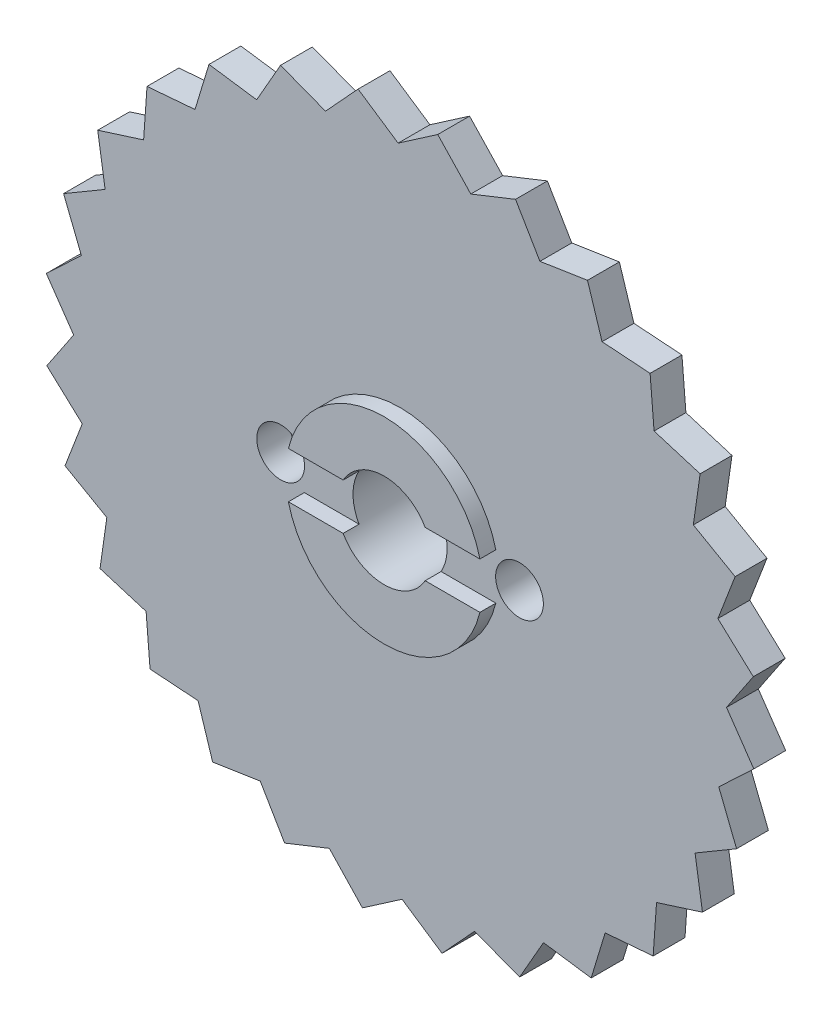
ISO-10303-21;
HEADER;
FILE_DESCRIPTION(('STEP AP214'),'2;1');
FILE_NAME('part.step','',(''),(''),'','','');
FILE_SCHEMA(('AUTOMOTIVE_DESIGN { 1 0 10303 214 1 1 1 1 }'));
ENDSEC;
DATA;
#1=APPLICATION_CONTEXT('core data for automotive mechanical design processes');
#2=APPLICATION_PROTOCOL_DEFINITION('international standard','automotive_design',2000,#1);
#3=PRODUCT_CONTEXT('',#1,'mechanical');
#4=PRODUCT('Part','Part','',(#3));
#5=PRODUCT_RELATED_PRODUCT_CATEGORY('part','',(#4));
#6=PRODUCT_DEFINITION_FORMATION('','',#4);
#7=PRODUCT_DEFINITION_CONTEXT('part definition',#1,'design');
#8=PRODUCT_DEFINITION('design','',#6,#7);
#9=PRODUCT_DEFINITION_SHAPE('','',#8);
#10=(LENGTH_UNIT() NAMED_UNIT(*) SI_UNIT(.MILLI.,.METRE.));
#11=(NAMED_UNIT(*) PLANE_ANGLE_UNIT() SI_UNIT($,.RADIAN.));
#12=(NAMED_UNIT(*) SI_UNIT($,.STERADIAN.) SOLID_ANGLE_UNIT());
#13=UNCERTAINTY_MEASURE_WITH_UNIT(LENGTH_MEASURE(1.E-05),#10,'distance_accuracy_value','');
#14=(GEOMETRIC_REPRESENTATION_CONTEXT(3) GLOBAL_UNCERTAINTY_ASSIGNED_CONTEXT((#13)) GLOBAL_UNIT_ASSIGNED_CONTEXT((#10,
#11,#12)) REPRESENTATION_CONTEXT('',''));
#15=CARTESIAN_POINT('',(0.,0.,0.));
#16=DIRECTION('',(0.,0.,1.));
#17=DIRECTION('',(1.,0.,0.));
#18=AXIS2_PLACEMENT_3D('',#15,#16,#17);
#19=CARTESIAN_POINT('',(0.,0.,1.));
#20=DIRECTION('',(0.,0.,-1.));
#21=DIRECTION('',(-1.,0.,0.));
#22=AXIS2_PLACEMENT_3D('',#19,#20,#21);
#23=CYLINDRICAL_SURFACE('',#22,6.975);
#24=DIRECTION('',(0.,0.,1.));
#25=VECTOR('',#24,1.);
#26=CARTESIAN_POINT('',(6.843375,-1.34864510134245,3.));
#27=LINE('',#26,#25);
#28=CARTESIAN_POINT('',(6.843375,-1.34864510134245,1.));
#29=VERTEX_POINT('',#28);
#30=CARTESIAN_POINT('',(6.843375,-1.34864510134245,0.5));
#31=VERTEX_POINT('',#30);
#32=EDGE_CURVE('E489',#29,#31,#27,.F.);
#33=ORIENTED_EDGE('',*,*,#32,.F.);
#34=CARTESIAN_POINT('',(0.,0.,1.));
#35=DIRECTION('',(0.,0.,-1.));
#36=DIRECTION('',(-1.,0.,0.));
#37=AXIS2_PLACEMENT_3D('',#34,#35,#36);
#38=CIRCLE('',#37,6.975);
#39=CARTESIAN_POINT('',(-6.843375,-1.34864510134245,1.));
#40=VERTEX_POINT('',#39);
#41=EDGE_CURVE('E1625',#40,#29,#38,.F.);
#42=ORIENTED_EDGE('',*,*,#41,.F.);
#43=DIRECTION('',(0.,0.,1.));
#44=VECTOR('',#43,1.);
#45=CARTESIAN_POINT('',(-6.843375,-1.34864510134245,3.));
#46=LINE('',#45,#44);
#47=CARTESIAN_POINT('',(-6.843375,-1.34864510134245,0.5));
#48=VERTEX_POINT('',#47);
#49=EDGE_CURVE('E1948',#48,#40,#46,.T.);
#50=ORIENTED_EDGE('',*,*,#49,.F.);
#51=CARTESIAN_POINT('',(0.,0.,0.5));
#52=DIRECTION('',(0.,0.,-1.));
#53=DIRECTION('',(-1.,0.,0.));
#54=AXIS2_PLACEMENT_3D('',#51,#52,#53);
#55=CIRCLE('',#54,6.975);
#56=CARTESIAN_POINT('',(-6.82261863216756,-1.45,0.5));
#57=VERTEX_POINT('',#56);
#58=EDGE_CURVE('E984',#48,#57,#55,.F.);
#59=ORIENTED_EDGE('',*,*,#58,.T.);
#60=DIRECTION('',(0.,0.,-1.));
#61=VECTOR('',#60,1.);
#62=CARTESIAN_POINT('',(-6.82261863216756,-1.45,1.));
#63=LINE('',#62,#61);
#64=CARTESIAN_POINT('',(-6.82261863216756,-1.45,0.));
#65=VERTEX_POINT('',#64);
#66=EDGE_CURVE('E982',#65,#57,#63,.F.);
#67=ORIENTED_EDGE('',*,*,#66,.F.);
#68=CARTESIAN_POINT('',(0.,0.,0.));
#69=DIRECTION('',(0.,0.,-1.));
#70=DIRECTION('',(-1.,0.,0.));
#71=AXIS2_PLACEMENT_3D('',#68,#69,#70);
#72=CIRCLE('',#71,6.975);
#73=CARTESIAN_POINT('',(6.82261863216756,-1.45,0.));
#74=VERTEX_POINT('',#73);
#75=EDGE_CURVE('E1628',#74,#65,#72,.T.);
#76=ORIENTED_EDGE('',*,*,#75,.F.);
#77=DIRECTION('',(0.,0.,-1.));
#78=VECTOR('',#77,1.);
#79=CARTESIAN_POINT('',(6.82261863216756,-1.45,1.));
#80=LINE('',#79,#78);
#81=CARTESIAN_POINT('',(6.82261863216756,-1.45,0.5));
#82=VERTEX_POINT('',#81);
#83=EDGE_CURVE('E1000',#82,#74,#80,.T.);
#84=ORIENTED_EDGE('',*,*,#83,.F.);
#85=EDGE_CURVE('E981',#82,#31,#55,.F.);
#86=ORIENTED_EDGE('',*,*,#85,.T.);
#87=EDGE_LOOP('',(#33,#42,#50,#59,#67,#76,#84,#86));
#88=FACE_BOUND('',#87,.T.);
#89=ADVANCED_FACE('F467',(#88),#23,.T.);
#90=CARTESIAN_POINT('',(0.,0.,6.));
#91=DIRECTION('',(0.,0.,-1.));
#92=DIRECTION('',(-1.,0.,0.));
#93=AXIS2_PLACEMENT_3D('',#90,#91,#92);
#94=CYLINDRICAL_SURFACE('',#93,6.96);
#95=DIRECTION('',(0.,0.,1.));
#96=VECTOR('',#95,1.);
#97=CARTESIAN_POINT('',(6.82944,-1.34177095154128,3.));
#98=LINE('',#97,#96);
#99=CARTESIAN_POINT('',(6.82944,-1.34177095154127,6.));
#100=VERTEX_POINT('',#99);
#101=CARTESIAN_POINT('',(6.82944,-1.34177095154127,4.22));
#102=VERTEX_POINT('',#101);
#103=EDGE_CURVE('E1953',#100,#102,#98,.F.);
#104=ORIENTED_EDGE('',*,*,#103,.F.);
#105=CARTESIAN_POINT('',(0.,0.,6.));
#106=DIRECTION('',(0.,0.,-1.));
#107=DIRECTION('',(-1.,0.,0.));
#108=AXIS2_PLACEMENT_3D('',#105,#106,#107);
#109=CIRCLE('',#108,6.96);
#110=CARTESIAN_POINT('',(-6.82944,-1.34177095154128,6.));
#111=VERTEX_POINT('',#110);
#112=EDGE_CURVE('E1615',#100,#111,#109,.T.);
#113=ORIENTED_EDGE('',*,*,#112,.T.);
#114=DIRECTION('',(0.,0.,1.));
#115=VECTOR('',#114,1.);
#116=CARTESIAN_POINT('',(-6.82944,-1.34177095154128,3.));
#117=LINE('',#116,#115);
#118=CARTESIAN_POINT('',(-6.82944,-1.34177095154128,4.22));
#119=VERTEX_POINT('',#118);
#120=EDGE_CURVE('E1939',#119,#111,#117,.T.);
#121=ORIENTED_EDGE('',*,*,#120,.F.);
#122=CARTESIAN_POINT('',(0.,0.,4.22));
#123=DIRECTION('',(0.,0.,-1.));
#124=DIRECTION('',(-1.,0.,0.));
#125=AXIS2_PLACEMENT_3D('',#122,#123,#124);
#126=CIRCLE('',#125,6.96);
#127=EDGE_CURVE('E1608',#102,#119,#126,.T.);
#128=ORIENTED_EDGE('',*,*,#127,.F.);
#129=EDGE_LOOP('',(#104,#113,#121,#128));
#130=FACE_BOUND('',#129,.T.);
#131=ADVANCED_FACE('F1048',(#130),#94,.T.);
#132=CARTESIAN_POINT('',(0.,0.,0.));
#133=DIRECTION('',(0.,0.,1.));
#134=DIRECTION('',(1.,0.,0.));
#135=AXIS2_PLACEMENT_3D('',#132,#133,#134);
#136=CYLINDRICAL_SURFACE('',#135,2.955);
#137=CARTESIAN_POINT('',(-2.955,0.,1.11));
#138=CARTESIAN_POINT('',(-2.95499560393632,0.0787131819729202,1.11000503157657));
#139=CARTESIAN_POINT('',(-2.95182144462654,0.157515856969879,1.11623211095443));
#140=CARTESIAN_POINT('',(-2.93943640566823,0.312783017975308,1.14086069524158));
#141=CARTESIAN_POINT('',(-2.93021452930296,0.389242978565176,1.15928437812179));
#142=CARTESIAN_POINT('',(-2.9066971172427,0.537343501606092,1.20739517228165));
#143=CARTESIAN_POINT('',(-2.89242151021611,0.609001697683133,1.23703807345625));
#144=CARTESIAN_POINT('',(-2.86009829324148,0.746216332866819,1.30651202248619));
#145=CARTESIAN_POINT('',(-2.84205090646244,0.811773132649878,1.34634246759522));
#146=CARTESIAN_POINT('',(-2.80252403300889,0.939480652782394,1.43785531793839));
#147=CARTESIAN_POINT('',(-2.78090137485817,1.00117054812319,1.49011802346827));
#148=CARTESIAN_POINT('',(-2.73711447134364,1.11533627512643,1.60375900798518));
#149=CARTESIAN_POINT('',(-2.71494981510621,1.16780485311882,1.66514439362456));
#150=CARTESIAN_POINT('',(-2.67052513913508,1.26628164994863,1.80121233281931));
#151=CARTESIAN_POINT('',(-2.64840126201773,1.31142899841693,1.87656769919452));
#152=CARTESIAN_POINT('',(-2.60897435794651,1.38821941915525,2.03503693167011));
#153=CARTESIAN_POINT('',(-2.591667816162,1.41987234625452,2.11814508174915));
#154=CARTESIAN_POINT('',(-2.56545460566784,1.46668093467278,2.28464006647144));
#155=CARTESIAN_POINT('',(-2.55610239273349,1.48272022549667,2.36770469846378));
#156=CARTESIAN_POINT('',(-2.54568664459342,1.50054117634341,2.53582817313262));
#157=CARTESIAN_POINT('',(-2.5446144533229,1.50233772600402,2.62088483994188));
#158=CARTESIAN_POINT('',(-2.55052370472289,1.49226944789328,2.77921039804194));
#159=CARTESIAN_POINT('',(-2.55652144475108,1.48207361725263,2.85263130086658));
#160=CARTESIAN_POINT('',(-2.57416503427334,1.45121059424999,2.99652983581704));
#161=CARTESIAN_POINT('',(-2.58581277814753,1.4305398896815,3.06700647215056));
#162=CARTESIAN_POINT('',(-2.61369466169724,1.37894805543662,3.20502992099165));
#163=CARTESIAN_POINT('',(-2.6300289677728,1.34780016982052,3.27247078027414));
#164=CARTESIAN_POINT('',(-2.66545233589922,1.27631449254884,3.40149697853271));
#165=CARTESIAN_POINT('',(-2.68454263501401,1.2359725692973,3.46307966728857));
#166=CARTESIAN_POINT('',(-2.72635229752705,1.14107508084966,3.58714889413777));
#167=CARTESIAN_POINT('',(-2.74921915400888,1.0853490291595,3.64869363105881));
#168=CARTESIAN_POINT('',(-2.79398202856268,0.964290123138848,3.76196365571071));
#169=CARTESIAN_POINT('',(-2.81587755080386,0.898952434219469,3.81368397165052));
#170=CARTESIAN_POINT('',(-2.85754419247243,0.756462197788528,3.9082390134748));
#171=CARTESIAN_POINT('',(-2.87715769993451,0.678886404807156,3.95051107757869));
#172=CARTESIAN_POINT('',(-2.91069196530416,0.516478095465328,4.02105279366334));
#173=CARTESIAN_POINT('',(-2.9246173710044,0.431651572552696,4.04933388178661));
#174=CARTESIAN_POINT('',(-2.94420406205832,0.264831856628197,4.08870787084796));
#175=CARTESIAN_POINT('',(-2.95046419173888,0.18320484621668,4.10105114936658));
#176=CARTESIAN_POINT('',(-2.95608215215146,0.0188107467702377,4.11213940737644));
#177=CARTESIAN_POINT('',(-2.95544340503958,-0.0639557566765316,4.11089112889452));
#178=CARTESIAN_POINT('',(-2.94767695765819,-0.221195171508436,4.09553336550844));
#179=CARTESIAN_POINT('',(-2.94107523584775,-0.295799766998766,4.08246626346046));
#180=CARTESIAN_POINT('',(-2.92274101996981,-0.441600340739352,4.04549540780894));
#181=CARTESIAN_POINT('',(-2.91100796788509,-0.512795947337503,4.0215904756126));
#182=CARTESIAN_POINT('',(-2.88305777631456,-0.652067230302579,3.96302491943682));
#183=CARTESIAN_POINT('',(-2.8667246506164,-0.720000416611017,3.92808278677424));
#184=CARTESIAN_POINT('',(-2.83112820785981,-0.849258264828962,3.848756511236));
#185=CARTESIAN_POINT('',(-2.81186366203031,-0.91058013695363,3.80436840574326));
#186=CARTESIAN_POINT('',(-2.76996423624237,-1.03141226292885,3.70227164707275));
#187=CARTESIAN_POINT('',(-2.74718519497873,-1.09012163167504,3.64367278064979));
#188=CARTESIAN_POINT('',(-2.70222255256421,-1.19724699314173,3.51744668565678));
#189=CARTESIAN_POINT('',(-2.68003940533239,-1.24565532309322,3.44981279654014));
#190=CARTESIAN_POINT('',(-2.63762304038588,-1.33321510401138,3.30297744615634));
#191=CARTESIAN_POINT('',(-2.61755334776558,-1.37174710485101,3.2233550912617));
#192=CARTESIAN_POINT('',(-2.58372892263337,-1.43445365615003,3.05741696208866));
#193=CARTESIAN_POINT('',(-2.56996582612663,-1.45864723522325,2.97111023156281));
#194=CARTESIAN_POINT('',(-2.55207112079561,-1.48971504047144,2.80317793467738));
#195=CARTESIAN_POINT('',(-2.54713587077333,-1.4980395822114,2.72190842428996));
#196=CARTESIAN_POINT('',(-2.54519289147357,-1.50134164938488,2.5590196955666));
#197=CARTESIAN_POINT('',(-2.54818135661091,-1.49632558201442,2.47740066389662));
#198=CARTESIAN_POINT('',(-2.56088603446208,-1.47445469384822,2.32483286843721));
#199=CARTESIAN_POINT('',(-2.56989278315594,-1.45884583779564,2.25363858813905));
#200=CARTESIAN_POINT('',(-2.59275860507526,-1.41780684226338,2.11496881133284));
#201=CARTESIAN_POINT('',(-2.60661927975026,-1.39237346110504,2.0474945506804));
#202=CARTESIAN_POINT('',(-2.63875994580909,-1.33051125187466,1.91317143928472));
#203=CARTESIAN_POINT('',(-2.65727361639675,-1.29346047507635,1.84666664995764));
#204=CARTESIAN_POINT('',(-2.69626313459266,-1.21008586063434,1.72037970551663));
#205=CARTESIAN_POINT('',(-2.71674001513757,-1.16375712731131,1.66060112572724));
#206=CARTESIAN_POINT('',(-2.76045154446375,-1.05626970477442,1.54158533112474));
#207=CARTESIAN_POINT('',(-2.78370706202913,-0.993975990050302,1.48337521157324));
#208=CARTESIAN_POINT('',(-2.82800226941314,-0.859889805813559,1.37798500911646));
#209=CARTESIAN_POINT('',(-2.84904071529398,-0.788092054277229,1.33081110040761));
#210=CARTESIAN_POINT('',(-2.88687771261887,-0.635754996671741,1.24860934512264));
#211=CARTESIAN_POINT('',(-2.90362919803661,-0.555131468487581,1.21371487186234));
#212=CARTESIAN_POINT('',(-2.93060754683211,-0.388151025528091,1.15844061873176));
#213=CARTESIAN_POINT('',(-2.94085271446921,-0.30181095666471,1.1380201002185));
#214=CARTESIAN_POINT('',(-2.94980253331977,-0.178788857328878,1.12026072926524));
#215=CARTESIAN_POINT('',(-2.95174615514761,-0.14317442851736,1.11641876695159));
#216=CARTESIAN_POINT('',(-2.95434590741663,-0.0717128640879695,1.11128722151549));
#217=CARTESIAN_POINT('',(-2.95500200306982,-0.0358657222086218,1.10999770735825));
#218=CARTESIAN_POINT('',(-2.955,0.,1.11));
#219=B_SPLINE_CURVE_WITH_KNOTS('',3,(#137,#138,#139,#140,#141,#142,#143,#144,#145,#146,#147,
#148,#149,#150,#151,#152,#153,#154,#155,#156,#157,#158,#159,#160,#161,#162,#163,#164,#165,#166,
#167,#168,#169,#170,#171,#172,#173,#174,#175,#176,#177,#178,#179,#180,#181,#182,#183,#184,#185,
#186,#187,#188,#189,#190,#191,#192,#193,#194,#195,#196,#197,#198,#199,#200,#201,#202,#203,#204,
#205,#206,#207,#208,#209,#210,#211,#212,#213,#214,#215,#216,#217,#218),.UNSPECIFIED.,.T.,.F.,(4,
2,2,2,2,2,2,2,2,2,2,2,2,2,2,2,2,2,2,2,2,2,2,2,2,2,2,2,2,2,2,2,2,2,2,2,2,2,2,2,4),(0.,
0.235994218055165,0.472418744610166,0.707921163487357,0.943409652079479,1.19345035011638,
1.4436868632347,1.71408087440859,1.98427708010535,2.23809649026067,2.49165051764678,
2.71371376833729,2.93585152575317,3.16314459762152,3.39054001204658,3.64777471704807,
3.90513925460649,4.1751715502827,4.44498275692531,4.69199687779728,4.93888847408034,
5.16592482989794,5.39298588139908,5.62638272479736,5.85987767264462,6.1168297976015,
6.37397240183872,6.64461568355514,6.91489898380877,7.1590081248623,7.40300004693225,
7.62236621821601,7.84180483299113,8.07592918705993,8.31017740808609,8.57408823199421,
8.83814634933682,9.10498991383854,9.3710794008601,9.47860744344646,9.58613839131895),.UNSPECIFIED.);
#220=CARTESIAN_POINT('',(-2.955,0.,1.11));
#221=VERTEX_POINT('',#220);
#222=EDGE_CURVE('E1032',#221,#221,#219,.T.);
#223=ORIENTED_EDGE('',*,*,#222,.F.);
#224=EDGE_LOOP('',(#223));
#225=FACE_BOUND('',#224,.T.);
#226=CARTESIAN_POINT('',(0.,0.,0.5));
#227=DIRECTION('',(0.,0.,-1.));
#228=DIRECTION('',(-1.,0.,0.));
#229=AXIS2_PLACEMENT_3D('',#226,#227,#228);
#230=CIRCLE('',#229,2.955);
#231=CARTESIAN_POINT('',(2.57478639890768,-1.45,0.5));
#232=VERTEX_POINT('',#231);
#233=CARTESIAN_POINT('',(2.57478639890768,1.45,0.5));
#234=VERTEX_POINT('',#233);
#235=EDGE_CURVE('E1659',#232,#234,#230,.F.);
#236=ORIENTED_EDGE('',*,*,#235,.F.);
#237=DIRECTION('',(0.,0.,1.));
#238=VECTOR('',#237,1.);
#239=CARTESIAN_POINT('',(2.57478639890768,-1.45,0.));
#240=LINE('',#239,#238);
#241=CARTESIAN_POINT('',(2.57478639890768,-1.45,0.));
#242=VERTEX_POINT('',#241);
#243=EDGE_CURVE('E1666',#232,#242,#240,.F.);
#244=ORIENTED_EDGE('',*,*,#243,.T.);
#245=CARTESIAN_POINT('',(0.,0.,0.));
#246=DIRECTION('',(0.,0.,1.));
#247=DIRECTION('',(1.,0.,0.));
#248=AXIS2_PLACEMENT_3D('',#245,#246,#247);
#249=CIRCLE('',#248,2.955);
#250=CARTESIAN_POINT('',(-2.57478639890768,-1.45,0.));
#251=VERTEX_POINT('',#250);
#252=EDGE_CURVE('E1631',#251,#242,#249,.T.);
#253=ORIENTED_EDGE('',*,*,#252,.F.);
#254=DIRECTION('',(0.,0.,1.));
#255=VECTOR('',#254,1.);
#256=CARTESIAN_POINT('',(-2.57478639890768,-1.45,0.));
#257=LINE('',#256,#255);
#258=CARTESIAN_POINT('',(-2.57478639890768,-1.45,0.5));
#259=VERTEX_POINT('',#258);
#260=EDGE_CURVE('E1664',#251,#259,#257,.T.);
#261=ORIENTED_EDGE('',*,*,#260,.T.);
#262=CARTESIAN_POINT('',(-2.57478639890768,1.45,0.5));
#263=VERTEX_POINT('',#262);
#264=EDGE_CURVE('E1657',#263,#259,#230,.F.);
#265=ORIENTED_EDGE('',*,*,#264,.F.);
#266=DIRECTION('',(0.,0.,1.));
#267=VECTOR('',#266,1.);
#268=CARTESIAN_POINT('',(-2.57478639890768,1.45,0.));
#269=LINE('',#268,#267);
#270=CARTESIAN_POINT('',(-2.57478639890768,1.45,0.));
#271=VERTEX_POINT('',#270);
#272=EDGE_CURVE('E1661',#263,#271,#269,.F.);
#273=ORIENTED_EDGE('',*,*,#272,.T.);
#274=CARTESIAN_POINT('',(2.57478639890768,1.45,0.));
#275=VERTEX_POINT('',#274);
#276=EDGE_CURVE('E1127',#275,#271,#249,.T.);
#277=ORIENTED_EDGE('',*,*,#276,.F.);
#278=DIRECTION('',(0.,0.,1.));
#279=VECTOR('',#278,1.);
#280=CARTESIAN_POINT('',(2.57478639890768,1.45,0.));
#281=LINE('',#280,#279);
#282=EDGE_CURVE('E1645',#275,#234,#281,.T.);
#283=ORIENTED_EDGE('',*,*,#282,.T.);
#284=EDGE_LOOP('',(#236,#244,#253,#261,#265,#273,#277,#283));
#285=FACE_BOUND('',#284,.T.);
#286=CARTESIAN_POINT('',(0.,0.,9.));
#287=DIRECTION('',(0.,0.,1.));
#288=DIRECTION('',(1.,0.,0.));
#289=AXIS2_PLACEMENT_3D('',#286,#287,#288);
#290=CIRCLE('',#289,2.955);
#291=CARTESIAN_POINT('',(2.57478639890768,1.45,9.));
#292=VERTEX_POINT('',#291);
#293=CARTESIAN_POINT('',(-2.57478639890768,1.45,9.));
#294=VERTEX_POINT('',#293);
#295=EDGE_CURVE('E1107',#292,#294,#290,.T.);
#296=ORIENTED_EDGE('',*,*,#295,.T.);
#297=DIRECTION('',(0.,0.,1.));
#298=VECTOR('',#297,1.);
#299=CARTESIAN_POINT('',(-2.57478639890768,1.45,0.));
#300=LINE('',#299,#298);
#301=CARTESIAN_POINT('',(-2.57478639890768,1.45,8.));
#302=VERTEX_POINT('',#301);
#303=EDGE_CURVE('E992',#294,#302,#300,.F.);
#304=ORIENTED_EDGE('',*,*,#303,.T.);
#305=CARTESIAN_POINT('',(0.,0.,8.));
#306=DIRECTION('',(0.,0.,1.));
#307=DIRECTION('',(1.,0.,0.));
#308=AXIS2_PLACEMENT_3D('',#305,#306,#307);
#309=CIRCLE('',#308,2.955);
#310=CARTESIAN_POINT('',(-2.57478639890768,-1.45,8.));
#311=VERTEX_POINT('',#310);
#312=EDGE_CURVE('E1201',#311,#302,#309,.F.);
#313=ORIENTED_EDGE('',*,*,#312,.F.);
#314=DIRECTION('',(0.,0.,1.));
#315=VECTOR('',#314,1.);
#316=CARTESIAN_POINT('',(-2.57478639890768,-1.45,0.));
#317=LINE('',#316,#315);
#318=CARTESIAN_POINT('',(-2.57478639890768,-1.45,9.));
#319=VERTEX_POINT('',#318);
#320=EDGE_CURVE('E1206',#311,#319,#317,.T.);
#321=ORIENTED_EDGE('',*,*,#320,.T.);
#322=CARTESIAN_POINT('',(2.57478639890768,-1.45,9.));
#323=VERTEX_POINT('',#322);
#324=EDGE_CURVE('E1632',#319,#323,#290,.T.);
#325=ORIENTED_EDGE('',*,*,#324,.T.);
#326=DIRECTION('',(0.,0.,1.));
#327=VECTOR('',#326,1.);
#328=CARTESIAN_POINT('',(2.57478639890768,-1.45,0.));
#329=LINE('',#328,#327);
#330=CARTESIAN_POINT('',(2.57478639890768,-1.45,8.));
#331=VERTEX_POINT('',#330);
#332=EDGE_CURVE('E1200',#323,#331,#329,.F.);
#333=ORIENTED_EDGE('',*,*,#332,.T.);
#334=CARTESIAN_POINT('',(2.57478639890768,1.45,8.));
#335=VERTEX_POINT('',#334);
#336=EDGE_CURVE('E1198',#335,#331,#309,.F.);
#337=ORIENTED_EDGE('',*,*,#336,.F.);
#338=DIRECTION('',(0.,0.,1.));
#339=VECTOR('',#338,1.);
#340=CARTESIAN_POINT('',(2.57478639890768,1.45,0.));
#341=LINE('',#340,#339);
#342=EDGE_CURVE('E1204',#335,#292,#341,.T.);
#343=ORIENTED_EDGE('',*,*,#342,.T.);
#344=EDGE_LOOP('',(#296,#304,#313,#321,#325,#333,#337,#343));
#345=FACE_BOUND('',#344,.T.);
#346=CARTESIAN_POINT('',(2.955,0.,1.11));
#347=CARTESIAN_POINT('',(2.95499560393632,-0.0787131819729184,1.11000503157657));
#348=CARTESIAN_POINT('',(2.95182144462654,-0.157515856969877,1.11623211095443));
#349=CARTESIAN_POINT('',(2.93943640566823,-0.312783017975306,1.14086069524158));
#350=CARTESIAN_POINT('',(2.93021452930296,-0.389242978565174,1.15928437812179));
#351=CARTESIAN_POINT('',(2.9066971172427,-0.53734350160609,1.20739517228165));
#352=CARTESIAN_POINT('',(2.89242151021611,-0.609001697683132,1.23703807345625));
#353=CARTESIAN_POINT('',(2.86009829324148,-0.746216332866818,1.30651202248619));
#354=CARTESIAN_POINT('',(2.84205090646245,-0.811773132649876,1.34634246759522));
#355=CARTESIAN_POINT('',(2.80252403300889,-0.939480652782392,1.43785531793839));
#356=CARTESIAN_POINT('',(2.78090137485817,-1.00117054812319,1.49011802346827));
#357=CARTESIAN_POINT('',(2.73711447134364,-1.11533627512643,1.60375900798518));
#358=CARTESIAN_POINT('',(2.71494981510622,-1.16780485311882,1.66514439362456));
#359=CARTESIAN_POINT('',(2.67052513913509,-1.26628164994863,1.80121233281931));
#360=CARTESIAN_POINT('',(2.64840126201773,-1.31142899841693,1.87656769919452));
#361=CARTESIAN_POINT('',(2.60897435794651,-1.38821941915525,2.03503693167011));
#362=CARTESIAN_POINT('',(2.591667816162,-1.41987234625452,2.11814508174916));
#363=CARTESIAN_POINT('',(2.56545460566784,-1.46668093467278,2.28464006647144));
#364=CARTESIAN_POINT('',(2.55610239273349,-1.48272022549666,2.36770469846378));
#365=CARTESIAN_POINT('',(2.54568664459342,-1.5005411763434,2.53582817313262));
#366=CARTESIAN_POINT('',(2.54461445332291,-1.50233772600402,2.62088483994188));
#367=CARTESIAN_POINT('',(2.55052370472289,-1.49226944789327,2.77921039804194));
#368=CARTESIAN_POINT('',(2.55652144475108,-1.48207361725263,2.85263130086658));
#369=CARTESIAN_POINT('',(2.57416503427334,-1.45121059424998,2.99652983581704));
#370=CARTESIAN_POINT('',(2.58581277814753,-1.43053988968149,3.06700647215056));
#371=CARTESIAN_POINT('',(2.61369466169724,-1.37894805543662,3.20502992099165));
#372=CARTESIAN_POINT('',(2.6300289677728,-1.34780016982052,3.27247078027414));
#373=CARTESIAN_POINT('',(2.66545233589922,-1.27631449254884,3.40149697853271));
#374=CARTESIAN_POINT('',(2.68454263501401,-1.23597256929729,3.46307966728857));
#375=CARTESIAN_POINT('',(2.72635229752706,-1.14107508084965,3.58714889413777));
#376=CARTESIAN_POINT('',(2.74921915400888,-1.0853490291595,3.64869363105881));
#377=CARTESIAN_POINT('',(2.79398202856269,-0.964290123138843,3.76196365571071));
#378=CARTESIAN_POINT('',(2.81587755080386,-0.898952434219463,3.81368397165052));
#379=CARTESIAN_POINT('',(2.85754419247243,-0.756462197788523,3.9082390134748));
#380=CARTESIAN_POINT('',(2.87715769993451,-0.678886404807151,3.95051107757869));
#381=CARTESIAN_POINT('',(2.91069196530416,-0.516478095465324,4.02105279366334));
#382=CARTESIAN_POINT('',(2.9246173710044,-0.431651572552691,4.04933388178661));
#383=CARTESIAN_POINT('',(2.94420406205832,-0.264831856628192,4.08870787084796));
#384=CARTESIAN_POINT('',(2.95046419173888,-0.183204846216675,4.10105114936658));
#385=CARTESIAN_POINT('',(2.95608215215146,-0.0188107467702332,4.11213940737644));
#386=CARTESIAN_POINT('',(2.95544340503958,0.0639557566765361,4.11089112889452));
#387=CARTESIAN_POINT('',(2.94767695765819,0.221195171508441,4.09553336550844));
#388=CARTESIAN_POINT('',(2.94107523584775,0.295799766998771,4.08246626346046));
#389=CARTESIAN_POINT('',(2.9227410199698,0.441600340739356,4.04549540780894));
#390=CARTESIAN_POINT('',(2.91100796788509,0.512795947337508,4.0215904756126));
#391=CARTESIAN_POINT('',(2.88305777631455,0.652067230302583,3.96302491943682));
#392=CARTESIAN_POINT('',(2.8667246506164,0.720000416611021,3.92808278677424));
#393=CARTESIAN_POINT('',(2.83112820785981,0.849258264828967,3.848756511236));
#394=CARTESIAN_POINT('',(2.81186366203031,0.910580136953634,3.80436840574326));
#395=CARTESIAN_POINT('',(2.76996423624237,1.03141226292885,3.70227164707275));
#396=CARTESIAN_POINT('',(2.74718519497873,1.09012163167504,3.64367278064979));
#397=CARTESIAN_POINT('',(2.70222255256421,1.19724699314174,3.51744668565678));
#398=CARTESIAN_POINT('',(2.68003940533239,1.24565532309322,3.44981279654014));
#399=CARTESIAN_POINT('',(2.63762304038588,1.33321510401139,3.30297744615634));
#400=CARTESIAN_POINT('',(2.61755334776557,1.37174710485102,3.22335509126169));
#401=CARTESIAN_POINT('',(2.58372892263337,1.43445365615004,3.05741696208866));
#402=CARTESIAN_POINT('',(2.56996582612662,1.45864723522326,2.97111023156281));
#403=CARTESIAN_POINT('',(2.55207112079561,1.48971504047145,2.80317793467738));
#404=CARTESIAN_POINT('',(2.54713587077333,1.49803958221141,2.72190842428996));
#405=CARTESIAN_POINT('',(2.54519289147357,1.50134164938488,2.5590196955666));
#406=CARTESIAN_POINT('',(2.54818135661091,1.49632558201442,2.47740066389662));
#407=CARTESIAN_POINT('',(2.56088603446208,1.47445469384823,2.32483286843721));
#408=CARTESIAN_POINT('',(2.56989278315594,1.45884583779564,2.25363858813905));
#409=CARTESIAN_POINT('',(2.59275860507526,1.41780684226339,2.11496881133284));
#410=CARTESIAN_POINT('',(2.60661927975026,1.39237346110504,2.0474945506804));
#411=CARTESIAN_POINT('',(2.63875994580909,1.33051125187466,1.91317143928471));
#412=CARTESIAN_POINT('',(2.65727361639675,1.29346047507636,1.84666664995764));
#413=CARTESIAN_POINT('',(2.69626313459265,1.21008586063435,1.72037970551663));
#414=CARTESIAN_POINT('',(2.71674001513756,1.16375712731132,1.66060112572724));
#415=CARTESIAN_POINT('',(2.76045154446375,1.05626970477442,1.54158533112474));
#416=CARTESIAN_POINT('',(2.78370706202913,0.993975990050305,1.48337521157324));
#417=CARTESIAN_POINT('',(2.82800226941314,0.859889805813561,1.37798500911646));
#418=CARTESIAN_POINT('',(2.84904071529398,0.788092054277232,1.33081110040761));
#419=CARTESIAN_POINT('',(2.88687771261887,0.635754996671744,1.24860934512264));
#420=CARTESIAN_POINT('',(2.90362919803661,0.555131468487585,1.21371487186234));
#421=CARTESIAN_POINT('',(2.93060754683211,0.388151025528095,1.15844061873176));
#422=CARTESIAN_POINT('',(2.94085271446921,0.301810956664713,1.1380201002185));
#423=CARTESIAN_POINT('',(2.94980253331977,0.17878885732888,1.12026072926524));
#424=CARTESIAN_POINT('',(2.95174615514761,0.143174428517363,1.11641876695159));
#425=CARTESIAN_POINT('',(2.95434590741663,0.0717128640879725,1.11128722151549));
#426=CARTESIAN_POINT('',(2.95500200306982,0.0358657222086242,1.10999770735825));
#427=CARTESIAN_POINT('',(2.955,0.,1.11));
#428=B_SPLINE_CURVE_WITH_KNOTS('',3,(#346,#347,#348,#349,#350,#351,#352,#353,#354,#355,#356,
#357,#358,#359,#360,#361,#362,#363,#364,#365,#366,#367,#368,#369,#370,#371,#372,#373,#374,#375,
#376,#377,#378,#379,#380,#381,#382,#383,#384,#385,#386,#387,#388,#389,#390,#391,#392,#393,#394,
#395,#396,#397,#398,#399,#400,#401,#402,#403,#404,#405,#406,#407,#408,#409,#410,#411,#412,#413,
#414,#415,#416,#417,#418,#419,#420,#421,#422,#423,#424,#425,#426,#427),.UNSPECIFIED.,.T.,.F.,(4,
2,2,2,2,2,2,2,2,2,2,2,2,2,2,2,2,2,2,2,2,2,2,2,2,2,2,2,2,2,2,2,2,2,2,2,2,2,2,2,4),(0.,
0.235994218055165,0.472418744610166,0.707921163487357,0.943409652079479,1.19345035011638,
1.4436868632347,1.71408087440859,1.98427708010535,2.23809649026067,2.49165051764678,
2.71371376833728,2.93585152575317,3.16314459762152,3.39054001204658,3.64777471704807,
3.90513925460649,4.1751715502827,4.44498275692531,4.69199687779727,4.93888847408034,
5.16592482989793,5.39298588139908,5.62638272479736,5.85987767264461,6.1168297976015,
6.37397240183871,6.64461568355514,6.91489898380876,7.15900812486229,7.40300004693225,
7.62236621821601,7.84180483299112,8.07592918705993,8.31017740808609,8.57408823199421,
8.83814634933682,9.10498991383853,9.3710794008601,9.47860744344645,9.58613839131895),.UNSPECIFIED.);
#429=CARTESIAN_POINT('',(2.955,0.,1.11));
#430=VERTEX_POINT('',#429);
#431=EDGE_CURVE('E1038',#430,#430,#428,.T.);
#432=ORIENTED_EDGE('',*,*,#431,.F.);
#433=EDGE_LOOP('',(#432));
#434=FACE_BOUND('',#433,.T.);
#435=ADVANCED_FACE('F1043',(#225,#285,#345,#434),#136,.F.);
#436=CARTESIAN_POINT('',(0.,0.,4.22));
#437=DIRECTION('',(0.,0.,-1.));
#438=DIRECTION('',(-1.,0.,0.));
#439=AXIS2_PLACEMENT_3D('',#436,#437,#438);
#440=CYLINDRICAL_SURFACE('',#439,5.97);
#441=CARTESIAN_POINT('',(5.97,0.,1.11));
#442=CARTESIAN_POINT('',(5.96999860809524,-0.0828625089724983,1.11000230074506));
#443=CARTESIAN_POINT('',(5.96825765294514,-0.165750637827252,1.11688928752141));
#444=CARTESIAN_POINT('',(5.96148136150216,-0.329150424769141,1.14421346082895));
#445=CARTESIAN_POINT('',(5.95644417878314,-0.40966072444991,1.16465824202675));
#446=CARTESIAN_POINT('',(5.94363308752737,-0.565921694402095,1.21839992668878));
#447=CARTESIAN_POINT('',(5.93586248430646,-0.641677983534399,1.25168131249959));
#448=CARTESIAN_POINT('',(5.91841165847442,-0.786532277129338,1.33009666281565));
#449=CARTESIAN_POINT('',(5.90873136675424,-0.855630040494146,1.3752310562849));
#450=CARTESIAN_POINT('',(5.88828667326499,-0.986642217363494,1.47706219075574));
#451=CARTESIAN_POINT('',(5.87750541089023,-1.04839850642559,1.53395899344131));
#452=CARTESIAN_POINT('',(5.85618562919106,-1.16160026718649,1.65727157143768));
#453=CARTESIAN_POINT('',(5.84564713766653,-1.21304456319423,1.72368843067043));
#454=CARTESIAN_POINT('',(5.82583593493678,-1.30490770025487,1.86538608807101));
#455=CARTESIAN_POINT('',(5.81658461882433,-1.34514928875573,1.94078506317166));
#456=CARTESIAN_POINT('',(5.80064126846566,-1.41232468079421,2.09754776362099));
#457=CARTESIAN_POINT('',(5.7939488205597,-1.43926063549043,2.17891052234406));
#458=CARTESIAN_POINT('',(5.78405429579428,-1.47852000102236,2.34355155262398));
#459=CARTESIAN_POINT('',(5.78078437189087,-1.49112789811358,2.42675781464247));
#460=CARTESIAN_POINT('',(5.77790206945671,-1.50225944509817,2.59416377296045));
#461=CARTESIAN_POINT('',(5.77828908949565,-1.50078541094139,2.67836330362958));
#462=CARTESIAN_POINT('',(5.7826159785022,-1.48402183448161,2.84318239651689));
#463=CARTESIAN_POINT('',(5.78646856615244,-1.46907167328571,2.92383912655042));
#464=CARTESIAN_POINT('',(5.79715335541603,-1.42632176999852,3.08146133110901));
#465=CARTESIAN_POINT('',(5.80398577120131,-1.39852110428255,3.15842653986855));
#466=CARTESIAN_POINT('',(5.81994024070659,-1.33057106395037,3.3073891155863));
#467=CARTESIAN_POINT('',(5.82908490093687,-1.29029882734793,3.37932791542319));
#468=CARTESIAN_POINT('',(5.84862076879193,-1.19863473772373,3.51554811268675));
#469=CARTESIAN_POINT('',(5.85901219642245,-1.14724092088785,3.57982815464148));
#470=CARTESIAN_POINT('',(5.88023793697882,-1.033036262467,3.70085059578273));
#471=CARTESIAN_POINT('',(5.89107638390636,-0.969939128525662,3.7573224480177));
#472=CARTESIAN_POINT('',(5.91170505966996,-0.835040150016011,3.85893500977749));
#473=CARTESIAN_POINT('',(5.92149525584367,-0.763238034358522,3.90407536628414));
#474=CARTESIAN_POINT('',(5.93897387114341,-0.612578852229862,3.98184435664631));
#475=CARTESIAN_POINT('',(5.94665481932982,-0.533697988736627,4.01442867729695));
#476=CARTESIAN_POINT('',(5.95899519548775,-0.371342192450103,4.06579898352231));
#477=CARTESIAN_POINT('',(5.96365520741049,-0.28786815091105,4.08458763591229));
#478=CARTESIAN_POINT('',(5.96934210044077,-0.12100834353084,4.10741923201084));
#479=CARTESIAN_POINT('',(5.97045972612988,-0.0376760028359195,4.11183056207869));
#480=CARTESIAN_POINT('',(5.96919455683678,0.128536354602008,4.10679318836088));
#481=CARTESIAN_POINT('',(5.96681208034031,0.211416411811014,4.09734574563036));
#482=CARTESIAN_POINT('',(5.9588725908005,0.373088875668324,4.06516254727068));
#483=CARTESIAN_POINT('',(5.95336369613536,0.451923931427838,4.04262809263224));
#484=CARTESIAN_POINT('',(5.93979256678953,0.604690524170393,3.98514075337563));
#485=CARTESIAN_POINT('',(5.93173007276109,0.678621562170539,3.95018660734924));
#486=CARTESIAN_POINT('',(5.91372909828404,0.820944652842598,3.8681404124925));
#487=CARTESIAN_POINT('',(5.90375964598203,0.889213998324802,3.8208424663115));
#488=CARTESIAN_POINT('',(5.88309890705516,1.01697734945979,3.71571414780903));
#489=CARTESIAN_POINT('',(5.87240749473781,1.07646982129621,3.65788193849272));
#490=CARTESIAN_POINT('',(5.85118064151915,1.18651126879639,3.5316156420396));
#491=CARTESIAN_POINT('',(5.8406556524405,1.23680171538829,3.46295410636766));
#492=CARTESIAN_POINT('',(5.82124897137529,1.32514686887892,3.31794930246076));
#493=CARTESIAN_POINT('',(5.81236720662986,1.36320211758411,3.2416063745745));
#494=CARTESIAN_POINT('',(5.79735085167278,1.42571282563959,3.08381378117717));
#495=CARTESIAN_POINT('',(5.79120003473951,1.45024882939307,3.00239764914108));
#496=CARTESIAN_POINT('',(5.78232718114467,1.48523542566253,2.8364175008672));
#497=CARTESIAN_POINT('',(5.77960438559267,1.49568913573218,2.75185418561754));
#498=CARTESIAN_POINT('',(5.77795411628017,1.50205027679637,2.58461206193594));
#499=CARTESIAN_POINT('',(5.77891878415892,1.49837107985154,2.50194979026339));
#500=CARTESIAN_POINT('',(5.78428514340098,1.47751785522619,2.33846484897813));
#501=CARTESIAN_POINT('',(5.78868676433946,1.46034410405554,2.25764214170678));
#502=CARTESIAN_POINT('',(5.80037065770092,1.41321608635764,2.10058523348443));
#503=CARTESIAN_POINT('',(5.80763526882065,1.38334009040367,2.02432614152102));
#504=CARTESIAN_POINT('',(5.82422892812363,1.31171748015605,1.87784811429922));
#505=CARTESIAN_POINT('',(5.83355826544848,1.26996920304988,1.80763002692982));
#506=CARTESIAN_POINT('',(5.85353715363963,1.17449432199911,1.67323149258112));
#507=CARTESIAN_POINT('',(5.86421500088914,1.12048123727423,1.60925873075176));
#508=CARTESIAN_POINT('',(5.88551967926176,1.00256726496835,1.49115049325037));
#509=CARTESIAN_POINT('',(5.89614649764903,0.938664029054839,1.43701736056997));
#510=CARTESIAN_POINT('',(5.91638442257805,0.801368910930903,1.33915619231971));
#511=CARTESIAN_POINT('',(5.92597332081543,0.727824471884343,1.29563724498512));
#512=CARTESIAN_POINT('',(5.94282009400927,0.57422887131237,1.22164983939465));
#513=CARTESIAN_POINT('',(5.95007962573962,0.494182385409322,1.19117210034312));
#514=CARTESIAN_POINT('',(5.96038628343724,0.345241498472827,1.14861632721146));
#515=CARTESIAN_POINT('',(5.96396655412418,0.277051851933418,1.13416667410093));
#516=CARTESIAN_POINT('',(5.96877390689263,0.139247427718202,1.11485791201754));
#517=CARTESIAN_POINT('',(5.97000116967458,0.069632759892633,1.1099980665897));
#518=CARTESIAN_POINT('',(5.97,0.,1.11));
#519=B_SPLINE_CURVE_WITH_KNOTS('',3,(#441,#442,#443,#444,#445,#446,#447,#448,#449,#450,#451,
#452,#453,#454,#455,#456,#457,#458,#459,#460,#461,#462,#463,#464,#465,#466,#467,#468,#469,#470,
#471,#472,#473,#474,#475,#476,#477,#478,#479,#480,#481,#482,#483,#484,#485,#486,#487,#488,#489,
#490,#491,#492,#493,#494,#495,#496,#497,#498,#499,#500,#501,#502,#503,#504,#505,#506,#507,#508,
#509,#510,#511,#512,#513,#514,#515,#516,#517,#518),.UNSPECIFIED.,.T.,.F.,(4,2,2,2,2,2,2,2,2,2,2,
2,2,2,2,2,2,2,2,2,2,2,2,2,2,2,2,2,2,2,2,2,2,2,2,2,2,2,4),(0.,0.248332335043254,
0.496803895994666,0.744976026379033,0.993157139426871,1.24596991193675,1.49881149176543,
1.75545164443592,2.01205029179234,2.26345988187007,2.51482812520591,2.76003755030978,
3.00526460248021,3.25298875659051,3.5007566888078,3.75566356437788,4.01057838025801,
4.26638478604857,4.52214172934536,4.77129172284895,5.0204190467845,5.26581220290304,
5.51123028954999,5.76103749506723,6.01088830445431,6.26693835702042,6.52297706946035,
6.77747339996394,7.03191338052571,7.27896873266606,7.52601902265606,7.77156857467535,
8.01715253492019,8.26920358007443,8.52131456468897,8.77805029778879,9.03460301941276,
9.24330287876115,9.45198671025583),.UNSPECIFIED.);
#520=CARTESIAN_POINT('',(5.97,0.,1.11));
#521=VERTEX_POINT('',#520);
#522=EDGE_CURVE('E1002',#521,#521,#519,.T.);
#523=ORIENTED_EDGE('',*,*,#522,.T.);
#524=EDGE_LOOP('',(#523));
#525=FACE_BOUND('',#524,.T.);
#526=CARTESIAN_POINT('',(0.,0.,4.22));
#527=DIRECTION('',(0.,0.,-1.));
#528=DIRECTION('',(-1.,0.,0.));
#529=AXIS2_PLACEMENT_3D('',#526,#527,#528);
#530=CIRCLE('',#529,5.97);
#531=CARTESIAN_POINT('',(-5.97,0.,4.22));
#532=VERTEX_POINT('',#531);
#533=EDGE_CURVE('E1622',#532,#532,#530,.T.);
#534=ORIENTED_EDGE('',*,*,#533,.T.);
#535=EDGE_LOOP('',(#534));
#536=FACE_BOUND('',#535,.T.);
#537=CARTESIAN_POINT('',(0.,0.,1.));
#538=DIRECTION('',(0.,0.,-1.));
#539=DIRECTION('',(-1.,0.,0.));
#540=AXIS2_PLACEMENT_3D('',#537,#538,#539);
#541=CIRCLE('',#540,5.97);
#542=CARTESIAN_POINT('',(-5.97,0.,1.));
#543=VERTEX_POINT('',#542);
#544=EDGE_CURVE('E1619',#543,#543,#541,.T.);
#545=ORIENTED_EDGE('',*,*,#544,.F.);
#546=EDGE_LOOP('',(#545));
#547=FACE_BOUND('',#546,.T.);
#548=CARTESIAN_POINT('',(-5.97,0.,4.11));
#549=CARTESIAN_POINT('',(-5.96999860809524,-0.0828625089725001,4.10999769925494));
#550=CARTESIAN_POINT('',(-5.96825765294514,-0.165750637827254,4.10311071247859));
#551=CARTESIAN_POINT('',(-5.96148136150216,-0.329150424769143,4.07578653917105));
#552=CARTESIAN_POINT('',(-5.95644417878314,-0.409660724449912,4.05534175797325));
#553=CARTESIAN_POINT('',(-5.94363308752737,-0.565921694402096,4.00160007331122));
#554=CARTESIAN_POINT('',(-5.93586248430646,-0.6416779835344,3.96831868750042));
#555=CARTESIAN_POINT('',(-5.91841165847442,-0.786532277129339,3.88990333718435));
#556=CARTESIAN_POINT('',(-5.90873136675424,-0.855630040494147,3.8447689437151));
#557=CARTESIAN_POINT('',(-5.88828667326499,-0.986642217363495,3.74293780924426));
#558=CARTESIAN_POINT('',(-5.87750541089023,-1.04839850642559,3.68604100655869));
#559=CARTESIAN_POINT('',(-5.85618562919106,-1.1616002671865,3.56272842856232));
#560=CARTESIAN_POINT('',(-5.84564713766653,-1.21304456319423,3.49631156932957));
#561=CARTESIAN_POINT('',(-5.82583593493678,-1.30490770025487,3.35461391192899));
#562=CARTESIAN_POINT('',(-5.81658461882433,-1.34514928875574,3.27921493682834));
#563=CARTESIAN_POINT('',(-5.80064126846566,-1.41232468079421,3.12245223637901));
#564=CARTESIAN_POINT('',(-5.7939488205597,-1.43926063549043,3.04108947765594));
#565=CARTESIAN_POINT('',(-5.78405429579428,-1.47852000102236,2.87644844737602));
#566=CARTESIAN_POINT('',(-5.78078437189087,-1.49112789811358,2.79324218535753));
#567=CARTESIAN_POINT('',(-5.77790206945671,-1.50225944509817,2.62583622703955));
#568=CARTESIAN_POINT('',(-5.77828908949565,-1.50078541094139,2.54163669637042));
#569=CARTESIAN_POINT('',(-5.7826159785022,-1.48402183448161,2.3768176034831));
#570=CARTESIAN_POINT('',(-5.78646856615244,-1.46907167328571,2.29616087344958));
#571=CARTESIAN_POINT('',(-5.79715335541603,-1.42632176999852,2.13853866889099));
#572=CARTESIAN_POINT('',(-5.80398577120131,-1.39852110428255,2.06157346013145));
#573=CARTESIAN_POINT('',(-5.81994024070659,-1.33057106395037,1.9126108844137));
#574=CARTESIAN_POINT('',(-5.82908490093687,-1.29029882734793,1.84067208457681));
#575=CARTESIAN_POINT('',(-5.84862076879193,-1.19863473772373,1.70445188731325));
#576=CARTESIAN_POINT('',(-5.85901219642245,-1.14724092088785,1.64017184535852));
#577=CARTESIAN_POINT('',(-5.88023793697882,-1.033036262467,1.51914940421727));
#578=CARTESIAN_POINT('',(-5.89107638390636,-0.969939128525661,1.4626775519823));
#579=CARTESIAN_POINT('',(-5.91170505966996,-0.83504015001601,1.36106499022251));
#580=CARTESIAN_POINT('',(-5.92149525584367,-0.763238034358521,1.31592463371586));
#581=CARTESIAN_POINT('',(-5.93897387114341,-0.612578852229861,1.23815564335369));
#582=CARTESIAN_POINT('',(-5.94665481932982,-0.533697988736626,1.20557132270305));
#583=CARTESIAN_POINT('',(-5.95899519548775,-0.371342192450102,1.15420101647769));
#584=CARTESIAN_POINT('',(-5.96365520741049,-0.287868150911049,1.13541236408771));
#585=CARTESIAN_POINT('',(-5.96934210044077,-0.121008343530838,1.11258076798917));
#586=CARTESIAN_POINT('',(-5.97045972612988,-0.037676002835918,1.10816943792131));
#587=CARTESIAN_POINT('',(-5.96919455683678,0.12853635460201,1.11320681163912));
#588=CARTESIAN_POINT('',(-5.96681208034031,0.211416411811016,1.12265425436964));
#589=CARTESIAN_POINT('',(-5.9588725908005,0.373088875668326,1.15483745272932));
#590=CARTESIAN_POINT('',(-5.95336369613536,0.45192393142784,1.17737190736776));
#591=CARTESIAN_POINT('',(-5.93979256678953,0.604690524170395,1.23485924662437));
#592=CARTESIAN_POINT('',(-5.93173007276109,0.678621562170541,1.26981339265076));
#593=CARTESIAN_POINT('',(-5.91372909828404,0.8209446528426,1.3518595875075));
#594=CARTESIAN_POINT('',(-5.90375964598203,0.889213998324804,1.3991575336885));
#595=CARTESIAN_POINT('',(-5.88309890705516,1.01697734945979,1.50428585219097));
#596=CARTESIAN_POINT('',(-5.87240749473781,1.07646982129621,1.56211806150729));
#597=CARTESIAN_POINT('',(-5.85118064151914,1.18651126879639,1.6883843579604));
#598=CARTESIAN_POINT('',(-5.8406556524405,1.23680171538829,1.75704589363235));
#599=CARTESIAN_POINT('',(-5.82124897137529,1.32514686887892,1.90205069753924));
#600=CARTESIAN_POINT('',(-5.81236720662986,1.36320211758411,1.97839362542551));
#601=CARTESIAN_POINT('',(-5.79735085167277,1.42571282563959,2.13618621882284));
#602=CARTESIAN_POINT('',(-5.79120003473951,1.45024882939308,2.21760235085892));
#603=CARTESIAN_POINT('',(-5.78232718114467,1.48523542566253,2.3835824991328));
#604=CARTESIAN_POINT('',(-5.77960438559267,1.49568913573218,2.46814581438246));
#605=CARTESIAN_POINT('',(-5.77795411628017,1.50205027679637,2.63538793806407));
#606=CARTESIAN_POINT('',(-5.77891878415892,1.49837107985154,2.71805020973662));
#607=CARTESIAN_POINT('',(-5.78428514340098,1.47751785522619,2.88153515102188));
#608=CARTESIAN_POINT('',(-5.78868676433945,1.46034410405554,2.96235785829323));
#609=CARTESIAN_POINT('',(-5.80037065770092,1.41321608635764,3.11941476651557));
#610=CARTESIAN_POINT('',(-5.80763526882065,1.38334009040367,3.19567385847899));
#611=CARTESIAN_POINT('',(-5.82422892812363,1.31171748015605,3.34215188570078));
#612=CARTESIAN_POINT('',(-5.83355826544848,1.26996920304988,3.41236997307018));
#613=CARTESIAN_POINT('',(-5.85353715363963,1.17449432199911,3.54676850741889));
#614=CARTESIAN_POINT('',(-5.86421500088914,1.12048123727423,3.61074126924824));
#615=CARTESIAN_POINT('',(-5.88551967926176,1.00256726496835,3.72884950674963));
#616=CARTESIAN_POINT('',(-5.89614649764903,0.938664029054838,3.78298263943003));
#617=CARTESIAN_POINT('',(-5.91638442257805,0.801368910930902,3.88084380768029));
#618=CARTESIAN_POINT('',(-5.92597332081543,0.727824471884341,3.92436275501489));
#619=CARTESIAN_POINT('',(-5.94282009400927,0.574228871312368,3.99835016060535));
#620=CARTESIAN_POINT('',(-5.95007962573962,0.49418238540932,4.02882789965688));
#621=CARTESIAN_POINT('',(-5.96038628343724,0.345241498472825,4.07138367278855));
#622=CARTESIAN_POINT('',(-5.96396655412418,0.277051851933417,4.08583332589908));
#623=CARTESIAN_POINT('',(-5.96877390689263,0.139247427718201,4.10514208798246));
#624=CARTESIAN_POINT('',(-5.97000116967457,0.0696327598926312,4.1100019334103));
#625=CARTESIAN_POINT('',(-5.97,0.,4.11));
#626=B_SPLINE_CURVE_WITH_KNOTS('',3,(#548,#549,#550,#551,#552,#553,#554,#555,#556,#557,#558,
#559,#560,#561,#562,#563,#564,#565,#566,#567,#568,#569,#570,#571,#572,#573,#574,#575,#576,#577,
#578,#579,#580,#581,#582,#583,#584,#585,#586,#587,#588,#589,#590,#591,#592,#593,#594,#595,#596,
#597,#598,#599,#600,#601,#602,#603,#604,#605,#606,#607,#608,#609,#610,#611,#612,#613,#614,#615,
#616,#617,#618,#619,#620,#621,#622,#623,#624,#625),.UNSPECIFIED.,.T.,.F.,(4,2,2,2,2,2,2,2,2,2,2,
2,2,2,2,2,2,2,2,2,2,2,2,2,2,2,2,2,2,2,2,2,2,2,2,2,2,2,4),(0.,0.248332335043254,
0.496803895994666,0.744976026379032,0.99315713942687,1.24596991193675,1.49881149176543,
1.75545164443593,2.01205029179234,2.26345988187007,2.51482812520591,2.76003755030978,
3.00526460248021,3.25298875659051,3.5007566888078,3.75566356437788,4.01057838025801,
4.26638478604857,4.52214172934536,4.77129172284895,5.0204190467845,5.26581220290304,
5.51123028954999,5.76103749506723,6.01088830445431,6.26693835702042,6.52297706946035,
6.77747339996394,7.03191338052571,7.27896873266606,7.52601902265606,7.77156857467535,
8.01715253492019,8.26920358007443,8.52131456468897,8.77805029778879,9.03460301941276,
9.24330287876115,9.45198671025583),.UNSPECIFIED.);
#627=CARTESIAN_POINT('',(-5.97,0.,4.11));
#628=VERTEX_POINT('',#627);
#629=EDGE_CURVE('E1009',#628,#628,#626,.T.);
#630=ORIENTED_EDGE('',*,*,#629,.T.);
#631=EDGE_LOOP('',(#630));
#632=FACE_BOUND('',#631,.T.);
#633=ADVANCED_FACE('F1013',(#525,#536,#547,#632),#440,.T.);
#634=CARTESIAN_POINT('',(0.,0.,0.));
#635=DIRECTION('',(0.,0.,1.));
#636=DIRECTION('',(1.,0.,0.));
#637=AXIS2_PLACEMENT_3D('',#634,#635,#636);
#638=PLANE('',#637);
#639=ORIENTED_EDGE('',*,*,#75,.T.);
#640=DIRECTION('',(-1.,0.,0.));
#641=VECTOR('',#640,1.);
#642=CARTESIAN_POINT('',(6.975,-1.45,0.));
#643=LINE('',#642,#641);
#644=EDGE_CURVE('E1646',#251,#65,#643,.T.);
#645=ORIENTED_EDGE('',*,*,#644,.F.);
#646=ORIENTED_EDGE('',*,*,#252,.T.);
#647=EDGE_CURVE('E1650',#74,#242,#643,.T.);
#648=ORIENTED_EDGE('',*,*,#647,.F.);
#649=EDGE_LOOP('',(#639,#645,#646,#648));
#650=FACE_BOUND('',#649,.T.);
#651=ADVANCED_FACE('F1066',(#650),#638,.F.);
#652=CARTESIAN_POINT('',(0.,0.,8.));
#653=DIRECTION('',(0.,0.,1.));
#654=DIRECTION('',(1.,0.,0.));
#655=AXIS2_PLACEMENT_3D('',#652,#653,#654);
#656=CYLINDRICAL_SURFACE('',#655,6.185);
#657=DIRECTION('',(0.,0.,1.));
#658=VECTOR('',#657,1.);
#659=CARTESIAN_POINT('',(-6.01263045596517,1.45,8.));
#660=LINE('',#659,#658);
#661=CARTESIAN_POINT('',(-6.01263045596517,1.45,9.));
#662=VERTEX_POINT('',#661);
#663=CARTESIAN_POINT('',(-6.01263045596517,1.45,8.));
#664=VERTEX_POINT('',#663);
#665=EDGE_CURVE('E1119',#662,#664,#660,.F.);
#666=ORIENTED_EDGE('',*,*,#665,.F.);
#667=CARTESIAN_POINT('',(0.,0.,9.));
#668=DIRECTION('',(0.,0.,1.));
#669=DIRECTION('',(1.,0.,0.));
#670=AXIS2_PLACEMENT_3D('',#667,#668,#669);
#671=CIRCLE('',#670,6.185);
#672=CARTESIAN_POINT('',(6.01263045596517,1.45,9.));
#673=VERTEX_POINT('',#672);
#674=EDGE_CURVE('E1105',#673,#662,#671,.T.);
#675=ORIENTED_EDGE('',*,*,#674,.F.);
#676=DIRECTION('',(0.,0.,1.));
#677=VECTOR('',#676,1.);
#678=CARTESIAN_POINT('',(6.01263045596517,1.45,8.));
#679=LINE('',#678,#677);
#680=CARTESIAN_POINT('',(6.01263045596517,1.45,8.));
#681=VERTEX_POINT('',#680);
#682=EDGE_CURVE('E1117',#681,#673,#679,.T.);
#683=ORIENTED_EDGE('',*,*,#682,.F.);
#684=CARTESIAN_POINT('',(0.,0.,8.));
#685=DIRECTION('',(0.,0.,1.));
#686=DIRECTION('',(1.,0.,0.));
#687=AXIS2_PLACEMENT_3D('',#684,#685,#686);
#688=CIRCLE('',#687,6.185);
#689=EDGE_CURVE('E1124',#681,#664,#688,.T.);
#690=ORIENTED_EDGE('',*,*,#689,.T.);
#691=EDGE_LOOP('',(#666,#675,#683,#690));
#692=FACE_BOUND('',#691,.T.);
#693=ADVANCED_FACE('F1058',(#692),#656,.T.);
#694=CARTESIAN_POINT('',(0.,0.,9.));
#695=DIRECTION('',(0.,0.,1.));
#696=DIRECTION('',(1.,0.,0.));
#697=AXIS2_PLACEMENT_3D('',#694,#695,#696);
#698=PLANE('',#697);
#699=DIRECTION('',(-1.,0.,0.));
#700=VECTOR('',#699,1.);
#701=CARTESIAN_POINT('',(-6.185,1.45,9.));
#702=LINE('',#701,#700);
#703=EDGE_CURVE('E1102',#673,#292,#702,.T.);
#704=ORIENTED_EDGE('',*,*,#703,.F.);
#705=ORIENTED_EDGE('',*,*,#674,.T.);
#706=EDGE_CURVE('E1112',#294,#662,#702,.T.);
#707=ORIENTED_EDGE('',*,*,#706,.F.);
#708=ORIENTED_EDGE('',*,*,#295,.F.);
#709=EDGE_LOOP('',(#704,#705,#707,#708));
#710=FACE_BOUND('',#709,.T.);
#711=ADVANCED_FACE('F1061',(#710),#698,.T.);
#712=CARTESIAN_POINT('',(0.,0.,8.));
#713=DIRECTION('',(0.,0.,1.));
#714=DIRECTION('',(1.,0.,0.));
#715=AXIS2_PLACEMENT_3D('',#712,#713,#714);
#716=PLANE('',#715);
#717=CARTESIAN_POINT('',(7.5,0.,8.));
#718=DIRECTION('',(0.,0.,1.));
#719=DIRECTION('',(-1.,0.,0.));
#720=AXIS2_PLACEMENT_3D('',#717,#718,#719);
#721=CIRCLE('',#720,1.5);
#722=CARTESIAN_POINT('',(6.00000000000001,0.,8.));
#723=VERTEX_POINT('',#722);
#724=EDGE_CURVE('E975',#723,#723,#721,.T.);
#725=ORIENTED_EDGE('',*,*,#724,.F.);
#726=EDGE_LOOP('',(#725));
#727=FACE_BOUND('',#726,.T.);
#728=CARTESIAN_POINT('',(-7.5,0.,8.));
#729=DIRECTION('',(0.,0.,1.));
#730=DIRECTION('',(1.,0.,0.));
#731=AXIS2_PLACEMENT_3D('',#728,#729,#730);
#732=CIRCLE('',#731,1.5);
#733=CARTESIAN_POINT('',(-6.,0.,8.));
#734=VERTEX_POINT('',#733);
#735=EDGE_CURVE('E1950',#734,#734,#732,.T.);
#736=ORIENTED_EDGE('',*,*,#735,.F.);
#737=EDGE_LOOP('',(#736));
#738=FACE_BOUND('',#737,.T.);
#739=ORIENTED_EDGE('',*,*,#689,.F.);
#740=DIRECTION('',(-1.,0.,0.));
#741=VECTOR('',#740,1.);
#742=CARTESIAN_POINT('',(-6.185,1.45,8.));
#743=LINE('',#742,#741);
#744=EDGE_CURVE('E1226',#681,#335,#743,.T.);
#745=ORIENTED_EDGE('',*,*,#744,.T.);
#746=ORIENTED_EDGE('',*,*,#336,.T.);
#747=DIRECTION('',(1.,0.,0.));
#748=VECTOR('',#747,1.);
#749=CARTESIAN_POINT('',(-6.185,-1.45,8.));
#750=LINE('',#749,#748);
#751=CARTESIAN_POINT('',(6.01263045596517,-1.45,8.));
#752=VERTEX_POINT('',#751);
#753=EDGE_CURVE('E1111',#331,#752,#750,.T.);
#754=ORIENTED_EDGE('',*,*,#753,.T.);
#755=CARTESIAN_POINT('',(-6.01263045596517,-1.45,8.));
#756=VERTEX_POINT('',#755);
#757=EDGE_CURVE('E1120',#756,#752,#688,.T.);
#758=ORIENTED_EDGE('',*,*,#757,.F.);
#759=EDGE_CURVE('E1224',#756,#311,#750,.T.);
#760=ORIENTED_EDGE('',*,*,#759,.T.);
#761=ORIENTED_EDGE('',*,*,#312,.T.);
#762=EDGE_CURVE('E1216',#302,#664,#743,.T.);
#763=ORIENTED_EDGE('',*,*,#762,.T.);
#764=EDGE_LOOP('',(#739,#745,#746,#754,#758,#760,#761,#763));
#765=FACE_BOUND('',#764,.T.);
#766=DIRECTION('',(0.369496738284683,-0.929232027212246,0.));
#767=VECTOR('',#766,1.);
#768=CARTESIAN_POINT('',(1.16716358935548,-48.825314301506,8.));
#769=LINE('',#768,#767);
#770=CARTESIAN_POINT('',(-21.1306627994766,7.25056478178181,8.));
#771=VERTEX_POINT('',#770);
#772=CARTESIAN_POINT('',(-20.0132886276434,4.44052680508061,8.));
#773=VERTEX_POINT('',#772);
#774=EDGE_CURVE('E1237',#771,#773,#769,.T.);
#775=ORIENTED_EDGE('',*,*,#774,.T.);
#776=DIRECTION('',(-0.727829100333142,-0.68575855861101,0.));
#777=VECTOR('',#776,1.);
#778=CARTESIAN_POINT('',(-36.2289701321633,-10.8378433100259,8.));
#779=LINE('',#778,#777);
#780=CARTESIAN_POINT('',(-22.2142754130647,2.36676316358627,8.));
#781=VERTEX_POINT('',#780);
#782=EDGE_CURVE('E1233',#773,#781,#779,.T.);
#783=ORIENTED_EDGE('',*,*,#782,.T.);
#784=DIRECTION('',(-0.567006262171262,0.823713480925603,0.));
#785=VECTOR('',#784,1.);
#786=CARTESIAN_POINT('',(9.05358476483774,-43.0573523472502,8.));
#787=LINE('',#786,#785);
#788=CARTESIAN_POINT('',(-20.4996238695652,-0.124182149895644,8.));
#789=VERTEX_POINT('',#788);
#790=EDGE_CURVE('E1578',#789,#781,#787,.T.);
#791=ORIENTED_EDGE('',*,*,#790,.F.);
#792=DIRECTION('',(0.556985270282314,0.830522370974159,0.));
#793=VECTOR('',#792,1.);
#794=CARTESIAN_POINT('',(-36.8832578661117,-24.5538668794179,8.));
#795=LINE('',#794,#793);
#796=CARTESIAN_POINT('',(-22.1839714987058,-2.63571784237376,8.));
#797=VERTEX_POINT('',#796);
#798=EDGE_CURVE('E1576',#797,#789,#795,.T.);
#799=ORIENTED_EDGE('',*,*,#798,.F.);
#800=DIRECTION('',(0.736083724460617,-0.676890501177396,0.));
#801=VECTOR('',#800,1.);
#802=CARTESIAN_POINT('',(13.0808495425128,-35.0646679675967,8.));
#803=LINE('',#802,#801);
#804=CARTESIAN_POINT('',(-19.9580223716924,-4.68266409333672,8.));
#805=VERTEX_POINT('',#804);
#806=EDGE_CURVE('E1588',#797,#805,#803,.T.);
#807=ORIENTED_EDGE('',*,*,#806,.T.);
#808=DIRECTION('',(-0.358211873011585,-0.933640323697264,0.));
#809=VECTOR('',#808,1.);
#810=CARTESIAN_POINT('',(-32.3154245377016,-36.890890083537,8.));
#811=LINE('',#810,#809);
#812=CARTESIAN_POINT('',(-21.0412706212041,-7.50603294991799,8.));
#813=VERTEX_POINT('',#812);
#814=EDGE_CURVE('E1585',#805,#813,#811,.T.);
#815=ORIENTED_EDGE('',*,*,#814,.T.);
#816=DIRECTION('',(-0.868250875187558,0.496125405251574,0.));
#817=VECTOR('',#816,1.);
#818=CARTESIAN_POINT('',(12.8195602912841,-26.8543790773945,8.));
#819=LINE('',#818,#817);
#820=CARTESIAN_POINT('',(-18.4156422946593,-9.00633770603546,8.));
#821=VERTEX_POINT('',#820);
#822=EDGE_CURVE('E1601',#821,#813,#819,.T.);
#823=ORIENTED_EDGE('',*,*,#822,.F.);
#824=DIRECTION('',(0.141476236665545,0.989941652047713,0.));
#825=VECTOR('',#824,1.);
#826=CARTESIAN_POINT('',(-23.6888190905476,-45.9039642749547,8.));
#827=LINE('',#826,#825);
#828=CARTESIAN_POINT('',(-18.8434725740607,-11.9999642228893,8.));
#829=VERTEX_POINT('',#828);
#830=EDGE_CURVE('E1598',#829,#821,#827,.T.);
#831=ORIENTED_EDGE('',*,*,#830,.F.);
#832=DIRECTION('',(0.956880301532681,-0.290482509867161,0.));
#833=VECTOR('',#832,1.);
#834=CARTESIAN_POINT('',(8.77485144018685,-20.3841268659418,8.));
#835=LINE('',#834,#833);
#836=CARTESIAN_POINT('',(-15.9498250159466,-12.8783959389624,8.));
#837=VERTEX_POINT('',#836);
#838=EDGE_CURVE('E1559',#829,#837,#835,.T.);
#839=ORIENTED_EDGE('',*,*,#838,.T.);
#840=DIRECTION('',(0.0823536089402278,-0.996603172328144,0.));
#841=VECTOR('',#840,1.);
#842=CARTESIAN_POINT('',(-12.8532577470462,-50.3515413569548,8.));
#843=LINE('',#842,#841);
#844=CARTESIAN_POINT('',(-15.7007841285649,-15.8921671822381,8.));
#845=VERTEX_POINT('',#844);
#846=EDGE_CURVE('E1566',#837,#845,#843,.T.);
#847=ORIENTED_EDGE('',*,*,#846,.T.);
#848=DIRECTION('',(-0.997527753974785,0.0702736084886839,0.));
#849=VECTOR('',#848,1.);
#850=CARTESIAN_POINT('',(2.26360689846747,-17.1577185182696,8.));
#851=LINE('',#850,#849);
#852=CARTESIAN_POINT('',(-12.6842169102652,-16.1046776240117,8.));
#853=VERTEX_POINT('',#852);
#854=EDGE_CURVE('E1553',#853,#845,#851,.T.);
#855=ORIENTED_EDGE('',*,*,#854,.F.);
#856=DIRECTION('',(-0.302053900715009,0.95329084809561,0.));
#857=VECTOR('',#856,1.);
#858=CARTESIAN_POINT('',(-1.97156429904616,-49.9141191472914,8.));
#859=LINE('',#858,#857);
#860=CARTESIAN_POINT('',(-11.7707928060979,-18.9874705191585,8.));
#861=VERTEX_POINT('',#860);
#862=EDGE_CURVE('E1552',#861,#853,#859,.T.);
#863=ORIENTED_EDGE('',*,*,#862,.F.);
#864=DIRECTION('',(0.988154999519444,0.153459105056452,0.));
#865=VECTOR('',#864,1.);
#866=CARTESIAN_POINT('',(-4.87222830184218,-17.9161329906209,8.));
#867=LINE('',#866,#865);
#868=CARTESIAN_POINT('',(-8.78256920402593,-18.5234035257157,8.));
#869=VERTEX_POINT('',#868);
#870=EDGE_CURVE('E1539',#861,#869,#867,.T.);
#871=ORIENTED_EDGE('',*,*,#870,.T.);
#872=DIRECTION('',(0.506607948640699,-0.862176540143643,0.));
#873=VECTOR('',#872,1.);
#874=CARTESIAN_POINT('',(6.90964147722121,-45.2293720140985,8.));
#875=LINE('',#874,#873);
#876=CARTESIAN_POINT('',(-7.25056478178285,-21.1306627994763,8.));
#877=VERTEX_POINT('',#876);
#878=EDGE_CURVE('E1533',#869,#877,#875,.T.);
#879=ORIENTED_EDGE('',*,*,#878,.T.);
#880=DIRECTION('',(-0.929232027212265,-0.369496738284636,0.));
#881=VECTOR('',#880,1.);
#882=CARTESIAN_POINT('',(-10.6581630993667,-22.4856488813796,8.));
#883=LINE('',#882,#881);
#884=CARTESIAN_POINT('',(-4.44052680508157,-20.0132886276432,8.));
#885=VERTEX_POINT('',#884);
#886=EDGE_CURVE('E1527',#885,#877,#883,.T.);
#887=ORIENTED_EDGE('',*,*,#886,.F.);
#888=DIRECTION('',(-0.685758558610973,0.727829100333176,0.));
#889=VECTOR('',#888,1.);
#890=CARTESIAN_POINT('',(12.2598546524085,-37.7382203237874,8.));
#891=LINE('',#890,#889);
#892=CARTESIAN_POINT('',(-2.36676316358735,-22.2142754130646,8.));
#893=VERTEX_POINT('',#892);
#894=EDGE_CURVE('E1526',#893,#885,#891,.T.);
#895=ORIENTED_EDGE('',*,*,#894,.F.);
#896=DIRECTION('',(0.823713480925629,0.567006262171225,0.));
#897=VECTOR('',#896,1.);
#898=CARTESIAN_POINT('',(-13.4063710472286,-29.8134308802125,8.));
#899=LINE('',#898,#897);
#900=CARTESIAN_POINT('',(0.124182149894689,-20.4996238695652,8.));
#901=VERTEX_POINT('',#900);
#902=EDGE_CURVE('E1513',#893,#901,#899,.T.);
#903=ORIENTED_EDGE('',*,*,#902,.T.);
#904=DIRECTION('',(0.830522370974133,-0.556985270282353,0.));
#905=VECTOR('',#904,1.);
#906=CARTESIAN_POINT('',(13.3563611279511,-29.3737120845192,8.));
#907=LINE('',#906,#905);
#908=CARTESIAN_POINT('',(2.6357178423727,-22.183971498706,8.));
#909=VERTEX_POINT('',#908);
#910=EDGE_CURVE('E1507',#901,#909,#907,.T.);
#911=ORIENTED_EDGE('',*,*,#910,.T.);
#912=DIRECTION('',(-0.676890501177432,-0.736083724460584,0.));
#913=VECTOR('',#912,1.);
#914=CARTESIAN_POINT('',(-12.0771557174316,-38.1834673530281,8.));
#915=LINE('',#914,#913);
#916=CARTESIAN_POINT('',(4.68266409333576,-19.9580223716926,8.));
#917=VERTEX_POINT('',#916);
#918=EDGE_CURVE('E1501',#917,#909,#915,.T.);
#919=ORIENTED_EDGE('',*,*,#918,.F.);
#920=DIRECTION('',(-0.933640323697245,0.358211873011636,0.));
#921=VECTOR('',#920,1.);
#922=CARTESIAN_POINT('',(10.4104833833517,-22.1556276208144,8.));
#923=LINE('',#922,#921);
#924=CARTESIAN_POINT('',(7.50603294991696,-21.0412706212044,8.));
#925=VERTEX_POINT('',#924);
#926=EDGE_CURVE('E1500',#925,#917,#923,.T.);
#927=ORIENTED_EDGE('',*,*,#926,.F.);
#928=DIRECTION('',(0.496125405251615,0.868250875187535,0.));
#929=VECTOR('',#928,1.);
#930=CARTESIAN_POINT('',(-6.50971575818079,-45.5697183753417,8.));
#931=LINE('',#930,#929);
#932=CARTESIAN_POINT('',(9.00633770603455,-18.4156422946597,8.));
#933=VERTEX_POINT('',#932);
#934=EDGE_CURVE('E1487',#925,#933,#931,.T.);
#935=ORIENTED_EDGE('',*,*,#934,.T.);
#936=DIRECTION('',(0.989941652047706,-0.14147623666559,0.));
#937=VECTOR('',#936,1.);
#938=CARTESIAN_POINT('',(4.50423873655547,-17.7722306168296,8.));
#939=LINE('',#938,#937);
#940=CARTESIAN_POINT('',(11.9999642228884,-18.8434725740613,8.));
#941=VERTEX_POINT('',#940);
#942=EDGE_CURVE('E1481',#933,#941,#939,.T.);
#943=ORIENTED_EDGE('',*,*,#942,.T.);
#944=DIRECTION('',(-0.29048250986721,-0.956880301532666,0.));
#945=VECTOR('',#944,1.);
#946=CARTESIAN_POINT('',(2.52474184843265,-50.055863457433,8.));
#947=LINE('',#946,#945);
#948=CARTESIAN_POINT('',(12.8783959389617,-15.9498250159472,8.));
#949=VERTEX_POINT('',#948);
#950=EDGE_CURVE('E1475',#949,#941,#947,.T.);
#951=ORIENTED_EDGE('',*,*,#950,.F.);
#952=DIRECTION('',(-0.996603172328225,-0.0823536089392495,0.));
#953=VECTOR('',#952,1.);
#954=CARTESIAN_POINT('',(-2.64896683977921,-17.2329178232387,8.));
#955=LINE('',#954,#953);
#956=CARTESIAN_POINT('',(15.8921671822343,-15.7007841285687,8.));
#957=VERTEX_POINT('',#956);
#958=EDGE_CURVE('E1474',#957,#949,#955,.T.);
#959=ORIENTED_EDGE('',*,*,#958,.F.);
#960=DIRECTION('',(0.0702736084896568,0.997527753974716,0.));
#961=VECTOR('',#960,1.);
#962=CARTESIAN_POINT('',(13.4591263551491,-50.2375868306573,8.));
#963=LINE('',#962,#961);
#964=CARTESIAN_POINT('',(16.104677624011,-12.684216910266,8.));
#965=VERTEX_POINT('',#964);
#966=EDGE_CURVE('E1461',#957,#965,#963,.T.);
#967=ORIENTED_EDGE('',*,*,#966,.T.);
#968=DIRECTION('',(0.953290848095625,0.302053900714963,0.));
#969=VECTOR('',#968,1.);
#970=CARTESIAN_POINT('',(-9.07095824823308,-20.6612147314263,8.));
#971=LINE('',#970,#969);
#972=CARTESIAN_POINT('',(18.987470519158,-11.7707928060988,8.));
#973=VERTEX_POINT('',#972);
#974=EDGE_CURVE('E1455',#965,#973,#971,.T.);
#975=ORIENTED_EDGE('',*,*,#974,.T.);
#976=DIRECTION('',(0.153459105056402,-0.988154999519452,0.));
#977=VECTOR('',#976,1.);
#978=CARTESIAN_POINT('',(24.2296980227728,-45.5265827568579,8.));
#979=LINE('',#978,#977);
#980=CARTESIAN_POINT('',(18.5234035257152,-8.78256920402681,8.));
#981=VERTEX_POINT('',#980);
#982=EDGE_CURVE('E1449',#981,#973,#979,.T.);
#983=ORIENTED_EDGE('',*,*,#982,.F.);
#984=DIRECTION('',(-0.862176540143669,-0.506607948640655,0.));
#985=VECTOR('',#984,1.);
#986=CARTESIAN_POINT('',(-12.9387437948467,-27.2694720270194,8.));
#987=LINE('',#986,#985);
#988=CARTESIAN_POINT('',(21.1306627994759,-7.25056478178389,8.));
#989=VERTEX_POINT('',#988);
#990=EDGE_CURVE('E1448',#989,#981,#987,.T.);
#991=ORIENTED_EDGE('',*,*,#990,.F.);
#992=DIRECTION('',(-0.369496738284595,0.929232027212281,0.));
#993=VECTOR('',#992,1.);
#994=CARTESIAN_POINT('',(32.6797049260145,-36.2947719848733,8.));
#995=LINE('',#994,#993);
#996=CARTESIAN_POINT('',(20.013288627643,-4.44052680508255,8.));
#997=VERTEX_POINT('',#996);
#998=EDGE_CURVE('E1435',#989,#997,#995,.T.);
#999=ORIENTED_EDGE('',*,*,#998,.T.);
#1000=DIRECTION('',(0.727829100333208,0.685758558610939,0.));
#1001=VECTOR('',#1000,1.);
#1002=CARTESIAN_POINT('',(-12.9732123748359,-35.5203165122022,8.));
#1003=LINE('',#1002,#1001);
#1004=CARTESIAN_POINT('',(22.2142754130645,-2.36676316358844,8.));
#1005=VERTEX_POINT('',#1004);
#1006=EDGE_CURVE('E1429',#997,#1005,#1003,.T.);
#1007=ORIENTED_EDGE('',*,*,#1006,.T.);
#1008=DIRECTION('',(0.567006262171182,-0.823713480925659,0.));
#1009=VECTOR('',#1008,1.);
#1010=CARTESIAN_POINT('',(36.987732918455,-23.82877675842,8.));
#1011=LINE('',#1010,#1009);
#1012=CARTESIAN_POINT('',(20.4996238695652,0.124182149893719,8.));
#1013=VERTEX_POINT('',#1012);
#1014=EDGE_CURVE('E1423',#1013,#1005,#1011,.T.);
#1015=ORIENTED_EDGE('',*,*,#1014,.F.);
#1016=DIRECTION('',(-0.556985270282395,-0.830522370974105,0.));
#1017=VECTOR('',#1016,1.);
#1018=CARTESIAN_POINT('',(-8.71820352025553,-43.4426060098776,8.));
#1019=LINE('',#1018,#1017);
#1020=CARTESIAN_POINT('',(22.1839714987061,2.63571784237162,8.));
#1021=VERTEX_POINT('',#1020);
#1022=EDGE_CURVE('E1422',#1021,#1013,#1019,.T.);
#1023=ORIENTED_EDGE('',*,*,#1022,.F.);
#1024=DIRECTION('',(-0.736083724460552,0.676890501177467,0.));
#1025=VECTOR('',#1024,1.);
#1026=CARTESIAN_POINT('',(36.0358696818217,-10.1022601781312,8.));
#1027=LINE('',#1026,#1025);
#1028=CARTESIAN_POINT('',(19.9580223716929,4.6826640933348,8.));
#1029=VERTEX_POINT('',#1028);
#1030=EDGE_CURVE('E1409',#1021,#1029,#1027,.T.);
#1031=ORIENTED_EDGE('',*,*,#1030,.T.);
#1032=DIRECTION('',(0.358211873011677,0.933640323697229,0.));
#1033=VECTOR('',#1032,1.);
#1034=CARTESIAN_POINT('',(-0.653387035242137,-49.0387348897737,8.));
#1035=LINE('',#1034,#1033);
#1036=CARTESIAN_POINT('',(21.0412706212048,7.50603294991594,8.));
#1037=VERTEX_POINT('',#1036);
#1038=EDGE_CURVE('E1403',#1029,#1037,#1035,.T.);
#1039=ORIENTED_EDGE('',*,*,#1038,.T.);
#1040=DIRECTION('',(0.86825087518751,-0.49612540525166,0.));
#1041=VECTOR('',#1040,1.);
#1042=CARTESIAN_POINT('',(29.6443918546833,2.59014155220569,8.));
#1043=LINE('',#1042,#1041);
#1044=CARTESIAN_POINT('',(18.4156422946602,9.00633770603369,8.));
#1045=VERTEX_POINT('',#1044);
#1046=EDGE_CURVE('E1397',#1045,#1037,#1043,.T.);
#1047=ORIENTED_EDGE('',*,*,#1046,.F.);
#1048=DIRECTION('',(-0.141476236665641,-0.989941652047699,0.));
#1049=VECTOR('',#1048,1.);
#1050=CARTESIAN_POINT('',(9.88253479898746,-50.7017710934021,8.));
#1051=LINE('',#1050,#1049);
#1052=CARTESIAN_POINT('',(18.8434725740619,11.9999642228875,8.));
#1053=VERTEX_POINT('',#1052);
#1054=EDGE_CURVE('E1396',#1053,#1045,#1051,.T.);
#1055=ORIENTED_EDGE('',*,*,#1054,.F.);
#1056=DIRECTION('',(-0.956880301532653,0.290482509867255,0.));
#1057=VECTOR('',#1056,1.);
#1058=CARTESIAN_POINT('',(18.6258271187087,12.0660353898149,8.));
#1059=LINE('',#1058,#1057);
#1060=CARTESIAN_POINT('',(15.9498250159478,12.8783959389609,8.));
#1061=VERTEX_POINT('',#1060);
#1062=EDGE_CURVE('E1377',#1053,#1061,#1059,.T.);
#1063=ORIENTED_EDGE('',*,*,#1062,.T.);
#1064=DIRECTION('',(-0.0823536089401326,0.996603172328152,0.));
#1065=VECTOR('',#1064,1.);
#1066=CARTESIAN_POINT('',(20.9440046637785,-47.5587281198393,8.));
#1067=LINE('',#1066,#1065);
#1068=CARTESIAN_POINT('',(15.7007841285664,15.8921671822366,8.));
#1069=VERTEX_POINT('',#1068);
#1070=EDGE_CURVE('E1384',#1061,#1069,#1067,.T.);
#1071=ORIENTED_EDGE('',*,*,#1070,.T.);
#1072=DIRECTION('',(0.997527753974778,-0.0702736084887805,0.));
#1073=VECTOR('',#1072,1.);
#1074=CARTESIAN_POINT('',(4.64675763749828,16.6708987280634,8.));
#1075=LINE('',#1074,#1073);
#1076=CARTESIAN_POINT('',(12.6842169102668,16.1046776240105,8.));
#1077=VERTEX_POINT('',#1076);
#1078=EDGE_CURVE('E1371',#1077,#1069,#1075,.T.);
#1079=ORIENTED_EDGE('',*,*,#1078,.F.);
#1080=DIRECTION('',(0.302053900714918,-0.953290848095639,0.));
#1081=VECTOR('',#1080,1.);
#1082=CARTESIAN_POINT('',(30.3568707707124,-39.6707291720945,8.));
#1083=LINE('',#1082,#1081);
#1084=CARTESIAN_POINT('',(11.7707928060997,18.9874705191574,8.));
#1085=VERTEX_POINT('',#1084);
#1086=EDGE_CURVE('E1370',#1085,#1077,#1083,.T.);
#1087=ORIENTED_EDGE('',*,*,#1086,.F.);
#1088=DIRECTION('',(-0.988154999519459,-0.153459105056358,0.));
#1089=VECTOR('',#1088,1.);
#1090=CARTESIAN_POINT('',(-10.0764036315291,15.5946311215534,8.));
#1091=LINE('',#1090,#1089);
#1092=CARTESIAN_POINT('',(8.78256920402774,18.5234035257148,8.));
#1093=VERTEX_POINT('',#1092);
#1094=EDGE_CURVE('E1338',#1085,#1093,#1091,.T.);
#1095=ORIENTED_EDGE('',*,*,#1094,.T.);
#1096=DIRECTION('',(-0.506607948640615,0.862176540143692,0.));
#1097=VECTOR('',#1096,1.);
#1098=CARTESIAN_POINT('',(36.148166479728,-28.0490516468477,8.));
#1099=LINE('',#1098,#1097);
#1100=CARTESIAN_POINT('',(7.25056478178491,21.1306627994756,8.));
#1101=VERTEX_POINT('',#1100);
#1102=EDGE_CURVE('E1341',#1093,#1101,#1099,.T.);
#1103=ORIENTED_EDGE('',*,*,#1102,.T.);
#1104=DIRECTION('',(0.929232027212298,0.369496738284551,0.));
#1105=VECTOR('',#1104,1.);
#1106=CARTESIAN_POINT('',(-23.1887054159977,9.02689245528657,8.));
#1107=LINE('',#1106,#1105);
#1108=CARTESIAN_POINT('',(4.44052680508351,20.0132886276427,8.));
#1109=VERTEX_POINT('',#1108);
#1110=EDGE_CURVE('E1355',#1109,#1101,#1107,.T.);
#1111=ORIENTED_EDGE('',*,*,#1110,.F.);
#1112=DIRECTION('',(0.685758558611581,-0.727829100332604,0.));
#1113=VECTOR('',#1112,1.);
#1114=CARTESIAN_POINT('',(36.94232785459,-14.4824625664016,8.));
#1115=LINE('',#1114,#1113);
#1116=CARTESIAN_POINT('',(2.36676316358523,22.2142754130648,8.));
#1117=VERTEX_POINT('',#1116);
#1118=EDGE_CURVE('E1352',#1117,#1109,#1115,.T.);
#1119=ORIENTED_EDGE('',*,*,#1118,.F.);
#1120=DIRECTION('',(-0.823713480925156,-0.567006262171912,0.));
#1121=VECTOR('',#1120,1.);
#1122=CARTESIAN_POINT('',(-32.6349466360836,-1.87928272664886,8.));
#1123=LINE('',#1122,#1121);
#1124=CARTESIAN_POINT('',(-0.124182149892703,20.4996238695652,8.));
#1125=VERTEX_POINT('',#1124);
#1126=EDGE_CURVE('E1321',#1117,#1125,#1123,.T.);
#1127=ORIENTED_EDGE('',*,*,#1126,.T.);
#1128=DIRECTION('',(-0.830522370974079,0.556985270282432,0.));
#1129=VECTOR('',#1128,1.);
#1130=CARTESIAN_POINT('',(32.2451002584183,-1.2086577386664,8.));
#1131=LINE('',#1130,#1129);
#1132=CARTESIAN_POINT('',(-2.63571784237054,22.1839714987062,8.));
#1133=VERTEX_POINT('',#1132);
#1134=EDGE_CURVE('E1328',#1125,#1133,#1131,.T.);
#1135=ORIENTED_EDGE('',*,*,#1134,.T.);
#1136=DIRECTION('',(0.676890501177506,0.736083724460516,0.));
#1137=VECTOR('',#1136,1.);
#1138=CARTESIAN_POINT('',(-37.0395635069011,-15.2284472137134,8.));
#1139=LINE('',#1138,#1137);
#1140=CARTESIAN_POINT('',(-4.68266409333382,19.9580223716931,8.));
#1141=VERTEX_POINT('',#1140);
#1142=EDGE_CURVE('E1312',#1141,#1133,#1139,.T.);
#1143=ORIENTED_EDGE('',*,*,#1142,.F.);
#1144=DIRECTION('',(0.933640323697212,-0.358211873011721,0.));
#1145=VECTOR('',#1144,1.);
#1146=CARTESIAN_POINT('',(22.5583281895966,9.50640988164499,8.));
#1147=LINE('',#1146,#1145);
#1148=CARTESIAN_POINT('',(-7.50603294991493,21.0412706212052,8.));
#1149=VERTEX_POINT('',#1148);
#1150=EDGE_CURVE('E1311',#1149,#1141,#1147,.T.);
#1151=ORIENTED_EDGE('',*,*,#1150,.F.);
#1152=DIRECTION('',(-0.496125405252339,-0.868250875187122,0.));
#1153=VECTOR('',#1152,1.);
#1154=CARTESIAN_POINT('',(-35.9542363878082,-28.7448868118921,8.));
#1155=LINE('',#1154,#1153);
#1156=CARTESIAN_POINT('',(-9.00633770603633,18.4156422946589,8.));
#1157=VERTEX_POINT('',#1156);
#1158=EDGE_CURVE('E1295',#1149,#1157,#1155,.T.);
#1159=ORIENTED_EDGE('',*,*,#1158,.T.);
#1160=DIRECTION('',(-0.98994165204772,0.141476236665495,0.));
#1161=VECTOR('',#1160,1.);
#1162=CARTESIAN_POINT('',(9.30204555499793,15.7991232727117,8.));
#1163=LINE('',#1162,#1161);
#1164=CARTESIAN_POINT('',(-11.9999642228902,18.8434725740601,8.));
#1165=VERTEX_POINT('',#1164);
#1166=EDGE_CURVE('E1289',#1157,#1165,#1163,.T.);
#1167=ORIENTED_EDGE('',*,*,#1166,.T.);
#1168=DIRECTION('',(0.290482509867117,0.956880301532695,0.));
#1169=VECTOR('',#1168,1.);
#1170=CARTESIAN_POINT('',(-29.9254204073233,-40.2048877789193,8.));
#1171=LINE('',#1170,#1169);
#1172=CARTESIAN_POINT('',(-12.8783959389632,15.949825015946,8.));
#1173=VERTEX_POINT('',#1172);
#1174=EDGE_CURVE('E1280',#1173,#1165,#1171,.T.);
#1175=ORIENTED_EDGE('',*,*,#1174,.F.);
#1176=DIRECTION('',(0.996603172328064,0.0823536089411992,0.));
#1177=VECTOR('',#1176,1.);
#1178=CARTESIAN_POINT('',(-5.44178007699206,16.5643445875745,8.));
#1179=LINE('',#1178,#1177);
#1180=CARTESIAN_POINT('',(-15.8921671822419,15.700784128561,8.));
#1181=VERTEX_POINT('',#1180);
#1182=EDGE_CURVE('E1279',#1181,#1173,#1179,.T.);
#1183=ORIENTED_EDGE('',*,*,#1182,.F.);
#1184=DIRECTION('',(-0.0702736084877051,-0.997527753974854,0.));
#1185=VECTOR('',#1184,1.);
#1186=CARTESIAN_POINT('',(-20.3694908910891,-47.8544360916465,8.));
#1187=LINE('',#1186,#1185);
#1188=CARTESIAN_POINT('',(-16.1046776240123,12.6842169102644,8.));
#1189=VERTEX_POINT('',#1188);
#1190=EDGE_CURVE('E1251',#1181,#1189,#1187,.T.);
#1191=ORIENTED_EDGE('',*,*,#1190,.T.);
#1192=DIRECTION('',(-0.953290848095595,-0.302053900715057,0.));
#1193=VECTOR('',#1192,1.);
#1194=CARTESIAN_POINT('',(-19.3143482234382,11.6672203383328,8.));
#1195=LINE('',#1194,#1193);
#1196=CARTESIAN_POINT('',(-18.9874705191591,11.770792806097,8.));
#1197=VERTEX_POINT('',#1196);
#1198=EDGE_CURVE('E1247',#1189,#1197,#1195,.T.);
#1199=ORIENTED_EDGE('',*,*,#1198,.T.);
#1200=DIRECTION('',(-0.153459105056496,0.988154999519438,0.));
#1201=VECTOR('',#1200,1.);
#1202=CARTESIAN_POINT('',(-9.28106608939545,-50.7307580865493,8.));
#1203=LINE('',#1202,#1201);
#1204=CARTESIAN_POINT('',(-18.5234035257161,8.78256920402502,8.));
#1205=VERTEX_POINT('',#1204);
#1206=EDGE_CURVE('E1264',#1205,#1197,#1203,.T.);
#1207=ORIENTED_EDGE('',*,*,#1206,.F.);
#1208=DIRECTION('',(0.862176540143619,0.50660794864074,0.));
#1209=VECTOR('',#1208,1.);
#1210=CARTESIAN_POINT('',(-30.1190641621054,1.96905297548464,8.));
#1211=LINE('',#1210,#1209);
#1212=EDGE_CURVE('E1261',#771,#1205,#1211,.T.);
#1213=ORIENTED_EDGE('',*,*,#1212,.F.);
#1214=EDGE_LOOP('',(#775,#783,#791,#799,#807,#815,#823,#831,#839,#847,#855,#863,#871,#879,#887,
#895,#903,#911,#919,#927,#935,#943,#951,#959,#967,#975,#983,#991,#999,#1007,#1015,#1023,#1031,
#1039,#1047,#1055,#1063,#1071,#1079,#1087,#1095,#1103,#1111,#1119,#1127,#1135,#1143,#1151,#1159,
#1167,#1175,#1183,#1191,#1199,#1207,#1213));
#1215=FACE_BOUND('',#1214,.T.);
#1216=ADVANCED_FACE('F1059',(#727,#738,#765,#1215),#716,.T.);
#1217=CARTESIAN_POINT('',(0.,0.,6.));
#1218=DIRECTION('',(0.,0.,-1.));
#1219=DIRECTION('',(-1.,0.,0.));
#1220=AXIS2_PLACEMENT_3D('',#1217,#1218,#1219);
#1221=PLANE('',#1220);
#1222=CARTESIAN_POINT('',(7.5,0.,6.));
#1223=DIRECTION('',(0.,0.,-1.));
#1224=DIRECTION('',(-1.,0.,0.));
#1225=AXIS2_PLACEMENT_3D('',#1222,#1223,#1224);
#1226=CIRCLE('',#1225,1.5);
#1227=CARTESIAN_POINT('',(6.82944,1.34177095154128,6.));
#1228=VERTEX_POINT('',#1227);
#1229=EDGE_CURVE('E1955',#1228,#100,#1226,.T.);
#1230=ORIENTED_EDGE('',*,*,#1229,.F.);
#1231=CARTESIAN_POINT('',(-6.82944,1.34177095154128,6.));
#1232=VERTEX_POINT('',#1231);
#1233=EDGE_CURVE('E1616',#1232,#1228,#109,.T.);
#1234=ORIENTED_EDGE('',*,*,#1233,.F.);
#1235=CARTESIAN_POINT('',(-7.5,0.,6.));
#1236=DIRECTION('',(0.,0.,-1.));
#1237=DIRECTION('',(-1.,0.,0.));
#1238=AXIS2_PLACEMENT_3D('',#1235,#1236,#1237);
#1239=CIRCLE('',#1238,1.5);
#1240=EDGE_CURVE('E1938',#111,#1232,#1239,.T.);
#1241=ORIENTED_EDGE('',*,*,#1240,.F.);
#1242=ORIENTED_EDGE('',*,*,#112,.F.);
#1243=EDGE_LOOP('',(#1230,#1234,#1241,#1242));
#1244=FACE_BOUND('',#1243,.T.);
#1245=DIRECTION('',(0.567006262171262,-0.823713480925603,0.));
#1246=VECTOR('',#1245,1.);
#1247=CARTESIAN_POINT('',(-13.967074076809,-9.61428779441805,6.));
#1248=LINE('',#1247,#1246);
#1249=CARTESIAN_POINT('',(-22.2142754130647,2.36676316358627,6.));
#1250=VERTEX_POINT('',#1249);
#1251=CARTESIAN_POINT('',(-20.4996238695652,-0.124182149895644,6.));
#1252=VERTEX_POINT('',#1251);
#1253=EDGE_CURVE('E1139',#1250,#1252,#1248,.T.);
#1254=ORIENTED_EDGE('',*,*,#1253,.F.);
#1255=DIRECTION('',(0.727829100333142,0.68575855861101,0.));
#1256=VECTOR('',#1255,1.);
#1257=CARTESIAN_POINT('',(-11.6278788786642,12.3412366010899,6.));
#1258=LINE('',#1257,#1256);
#1259=CARTESIAN_POINT('',(-20.0132886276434,4.44052680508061,6.));
#1260=VERTEX_POINT('',#1259);
#1261=EDGE_CURVE('E1244',#1250,#1260,#1258,.T.);
#1262=ORIENTED_EDGE('',*,*,#1261,.T.);
#1263=DIRECTION('',(-0.369496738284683,0.929232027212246,0.));
#1264=VECTOR('',#1263,1.);
#1265=CARTESIAN_POINT('',(-15.7562706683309,-6.2652711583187,6.));
#1266=LINE('',#1265,#1264);
#1267=CARTESIAN_POINT('',(-21.1306627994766,7.25056478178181,6.));
#1268=VERTEX_POINT('',#1267);
#1269=EDGE_CURVE('E1240',#1260,#1268,#1266,.T.);
#1270=ORIENTED_EDGE('',*,*,#1269,.T.);
#1271=DIRECTION('',(-0.862176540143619,-0.50660794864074,0.));
#1272=VECTOR('',#1271,1.);
#1273=CARTESIAN_POINT('',(-8.59016018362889,14.6192625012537,6.));
#1274=LINE('',#1273,#1272);
#1275=CARTESIAN_POINT('',(-18.5234035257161,8.78256920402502,6.));
#1276=VERTEX_POINT('',#1275);
#1277=EDGE_CURVE('E1269',#1276,#1268,#1274,.T.);
#1278=ORIENTED_EDGE('',*,*,#1277,.F.);
#1279=DIRECTION('',(0.153459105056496,-0.988154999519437,0.));
#1280=VECTOR('',#1279,1.);
#1281=CARTESIAN_POINT('',(-16.7553820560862,-2.60208766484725,6.));
#1282=LINE('',#1281,#1280);
#1283=CARTESIAN_POINT('',(-18.9874705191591,11.770792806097,6.));
#1284=VERTEX_POINT('',#1283);
#1285=EDGE_CURVE('E1272',#1284,#1276,#1282,.T.);
#1286=ORIENTED_EDGE('',*,*,#1285,.F.);
#1287=DIRECTION('',(0.953290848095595,0.302053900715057,0.));
#1288=VECTOR('',#1287,1.);
#1289=CARTESIAN_POINT('',(-5.12169498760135,16.1642175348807,6.));
#1290=LINE('',#1289,#1288);
#1291=CARTESIAN_POINT('',(-16.1046776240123,12.6842169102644,6.));
#1292=VERTEX_POINT('',#1291);
#1293=EDGE_CURVE('E1254',#1284,#1292,#1290,.T.);
#1294=ORIENTED_EDGE('',*,*,#1293,.T.);
#1295=DIRECTION('',(0.0702736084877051,0.997527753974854,0.));
#1296=VECTOR('',#1295,1.);
#1297=CARTESIAN_POINT('',(-16.9143086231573,1.19157536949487,6.));
#1298=LINE('',#1297,#1296);
#1299=CARTESIAN_POINT('',(-15.8921671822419,15.700784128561,6.));
#1300=VERTEX_POINT('',#1299);
#1301=EDGE_CURVE('E1258',#1292,#1300,#1298,.T.);
#1302=ORIENTED_EDGE('',*,*,#1301,.T.);
#1303=DIRECTION('',(-0.996603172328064,-0.0823536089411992,0.));
#1304=VECTOR('',#1303,1.);
#1305=CARTESIAN_POINT('',(-1.39640661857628,16.8986312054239,6.));
#1306=LINE('',#1305,#1304);
#1307=CARTESIAN_POINT('',(-12.8783959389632,15.949825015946,6.));
#1308=VERTEX_POINT('',#1307);
#1309=EDGE_CURVE('E1286',#1308,#1300,#1306,.T.);
#1310=ORIENTED_EDGE('',*,*,#1309,.F.);
#1311=DIRECTION('',(-0.290482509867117,-0.956880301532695,0.));
#1312=VECTOR('',#1311,1.);
#1313=CARTESIAN_POINT('',(-16.2250811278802,4.92548783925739,6.));
#1314=LINE('',#1313,#1312);
#1315=CARTESIAN_POINT('',(-11.9999642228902,18.8434725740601,6.));
#1316=VERTEX_POINT('',#1315);
#1317=EDGE_CURVE('E1282',#1316,#1308,#1314,.T.);
#1318=ORIENTED_EDGE('',*,*,#1317,.F.);
#1319=DIRECTION('',(0.98994165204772,-0.141476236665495,0.));
#1320=VECTOR('',#1319,1.);
#1321=CARTESIAN_POINT('',(2.3989034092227,16.7856769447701,6.));
#1322=LINE('',#1321,#1320);
#1323=CARTESIAN_POINT('',(-9.00633770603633,18.4156422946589,6.));
#1324=VERTEX_POINT('',#1323);
#1325=EDGE_CURVE('E1303',#1316,#1324,#1322,.T.);
#1326=ORIENTED_EDGE('',*,*,#1325,.T.);
#1327=DIRECTION('',(0.496125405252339,0.868250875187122,0.));
#1328=VECTOR('',#1327,1.);
#1329=CARTESIAN_POINT('',(-14.7222603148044,8.4124157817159,6.));
#1330=LINE('',#1329,#1328);
#1331=CARTESIAN_POINT('',(-7.50603294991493,21.0412706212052,6.));
#1332=VERTEX_POINT('',#1331);
#1333=EDGE_CURVE('E1298',#1324,#1332,#1330,.T.);
#1334=ORIENTED_EDGE('',*,*,#1333,.T.);
#1335=DIRECTION('',(-0.933640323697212,0.358211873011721,0.));
#1336=VECTOR('',#1335,1.);
#1337=CARTESIAN_POINT('',(6.07392240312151,15.8310187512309,6.));
#1338=LINE('',#1337,#1336);
#1339=CARTESIAN_POINT('',(-4.68266409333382,19.9580223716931,6.));
#1340=VERTEX_POINT('',#1339);
#1341=EDGE_CURVE('E1318',#1340,#1332,#1338,.T.);
#1342=ORIENTED_EDGE('',*,*,#1341,.F.);
#1343=DIRECTION('',(-0.676890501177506,-0.736083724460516,0.));
#1344=VECTOR('',#1343,1.);
#1345=CARTESIAN_POINT('',(-12.481203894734,11.4775100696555,6.));
#1346=LINE('',#1345,#1344);
#1347=CARTESIAN_POINT('',(-2.63571784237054,22.1839714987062,6.));
#1348=VERTEX_POINT('',#1347);
#1349=EDGE_CURVE('E1314',#1348,#1340,#1346,.T.);
#1350=ORIENTED_EDGE('',*,*,#1349,.F.);
#1351=DIRECTION('',(0.830522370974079,-0.556985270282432,0.));
#1352=VECTOR('',#1351,1.);
#1353=CARTESIAN_POINT('',(9.44436956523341,14.0825271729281,6.));
#1354=LINE('',#1353,#1352);
#1355=CARTESIAN_POINT('',(-0.124182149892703,20.4996238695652,6.));
#1356=VERTEX_POINT('',#1355);
#1357=EDGE_CURVE('E1335',#1348,#1356,#1354,.T.);
#1358=ORIENTED_EDGE('',*,*,#1357,.T.);
#1359=DIRECTION('',(0.823713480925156,0.567006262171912,0.));
#1360=VECTOR('',#1359,1.);
#1361=CARTESIAN_POINT('',(-9.61428779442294,13.9670740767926,6.));
#1362=LINE('',#1361,#1360);
#1363=CARTESIAN_POINT('',(2.36676316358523,22.2142754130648,6.));
#1364=VERTEX_POINT('',#1363);
#1365=EDGE_CURVE('E1325',#1356,#1364,#1362,.T.);
#1366=ORIENTED_EDGE('',*,*,#1365,.T.);
#1367=DIRECTION('',(-0.685758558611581,0.727829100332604,0.));
#1368=VECTOR('',#1367,1.);
#1369=CARTESIAN_POINT('',(12.3412366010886,11.6278788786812,6.));
#1370=LINE('',#1369,#1368);
#1371=CARTESIAN_POINT('',(4.44052680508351,20.0132886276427,6.));
#1372=VERTEX_POINT('',#1371);
#1373=EDGE_CURVE('E1191',#1372,#1364,#1370,.T.);
#1374=ORIENTED_EDGE('',*,*,#1373,.F.);
#1375=DIRECTION('',(-0.929232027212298,-0.369496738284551,0.));
#1376=VECTOR('',#1375,1.);
#1377=CARTESIAN_POINT('',(-6.26527115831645,15.7562706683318,6.));
#1378=LINE('',#1377,#1376);
#1379=CARTESIAN_POINT('',(7.2505647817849,21.1306627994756,6.));
#1380=VERTEX_POINT('',#1379);
#1381=EDGE_CURVE('E1189',#1380,#1372,#1378,.T.);
#1382=ORIENTED_EDGE('',*,*,#1381,.F.);
#1383=DIRECTION('',(0.506607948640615,-0.862176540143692,0.));
#1384=VECTOR('',#1383,1.);
#1385=CARTESIAN_POINT('',(14.619262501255,8.59016018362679,6.));
#1386=LINE('',#1385,#1384);
#1387=CARTESIAN_POINT('',(8.78256920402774,18.5234035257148,6.));
#1388=VERTEX_POINT('',#1387);
#1389=EDGE_CURVE('E1346',#1380,#1388,#1386,.T.);
#1390=ORIENTED_EDGE('',*,*,#1389,.T.);
#1391=DIRECTION('',(0.988154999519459,0.153459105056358,0.));
#1392=VECTOR('',#1391,1.);
#1393=CARTESIAN_POINT('',(-2.60208766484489,16.7553820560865,6.));
#1394=LINE('',#1393,#1392);
#1395=CARTESIAN_POINT('',(11.7707928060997,18.9874705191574,6.));
#1396=VERTEX_POINT('',#1395);
#1397=EDGE_CURVE('E1349',#1388,#1396,#1394,.T.);
#1398=ORIENTED_EDGE('',*,*,#1397,.T.);
#1399=DIRECTION('',(-0.302053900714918,0.953290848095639,0.));
#1400=VECTOR('',#1399,1.);
#1401=CARTESIAN_POINT('',(16.1642175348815,5.12169498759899,6.));
#1402=LINE('',#1401,#1400);
#1403=CARTESIAN_POINT('',(12.6842169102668,16.1046776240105,6.));
#1404=VERTEX_POINT('',#1403);
#1405=EDGE_CURVE('E1186',#1404,#1396,#1402,.T.);
#1406=ORIENTED_EDGE('',*,*,#1405,.F.);
#1407=DIRECTION('',(-0.997527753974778,0.0702736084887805,0.));
#1408=VECTOR('',#1407,1.);
#1409=CARTESIAN_POINT('',(1.19157536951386,16.9143086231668,6.));
#1410=LINE('',#1409,#1408);
#1411=CARTESIAN_POINT('',(15.7007841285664,15.8921671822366,6.));
#1412=VERTEX_POINT('',#1411);
#1413=EDGE_CURVE('E1373',#1412,#1404,#1410,.T.);
#1414=ORIENTED_EDGE('',*,*,#1413,.F.);
#1415=DIRECTION('',(0.0823536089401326,-0.996603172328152,0.));
#1416=VECTOR('',#1415,1.);
#1417=CARTESIAN_POINT('',(16.8986312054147,1.39640661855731,6.));
#1418=LINE('',#1417,#1416);
#1419=CARTESIAN_POINT('',(15.9498250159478,12.8783959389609,6.));
#1420=VERTEX_POINT('',#1419);
#1421=EDGE_CURVE('E1183',#1412,#1420,#1418,.T.);
#1422=ORIENTED_EDGE('',*,*,#1421,.T.);
#1423=DIRECTION('',(0.956880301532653,-0.290482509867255,0.));
#1424=VECTOR('',#1423,1.);
#1425=CARTESIAN_POINT('',(4.92548783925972,16.2250811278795,6.));
#1426=LINE('',#1425,#1424);
#1427=CARTESIAN_POINT('',(18.8434725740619,11.9999642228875,6.));
#1428=VERTEX_POINT('',#1427);
#1429=EDGE_CURVE('E1381',#1420,#1428,#1426,.T.);
#1430=ORIENTED_EDGE('',*,*,#1429,.T.);
#1431=DIRECTION('',(0.141476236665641,0.989941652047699,0.));
#1432=VECTOR('',#1431,1.);
#1433=CARTESIAN_POINT('',(16.7856769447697,-2.39890340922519,6.));
#1434=LINE('',#1433,#1432);
#1435=CARTESIAN_POINT('',(18.4156422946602,9.00633770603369,6.));
#1436=VERTEX_POINT('',#1435);
#1437=EDGE_CURVE('E1180',#1436,#1428,#1434,.T.);
#1438=ORIENTED_EDGE('',*,*,#1437,.F.);
#1439=DIRECTION('',(-0.86825087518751,0.49612540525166,0.));
#1440=VECTOR('',#1439,1.);
#1441=CARTESIAN_POINT('',(8.41241578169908,14.7222603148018,6.));
#1442=LINE('',#1441,#1440);
#1443=CARTESIAN_POINT('',(21.0412706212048,7.50603294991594,6.));
#1444=VERTEX_POINT('',#1443);
#1445=EDGE_CURVE('E1399',#1444,#1436,#1442,.T.);
#1446=ORIENTED_EDGE('',*,*,#1445,.F.);
#1447=DIRECTION('',(-0.358211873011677,-0.933640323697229,0.));
#1448=VECTOR('',#1447,1.);
#1449=CARTESIAN_POINT('',(15.8310187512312,-6.07392240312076,6.));
#1450=LINE('',#1449,#1448);
#1451=CARTESIAN_POINT('',(19.9580223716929,4.6826640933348,6.));
#1452=VERTEX_POINT('',#1451);
#1453=EDGE_CURVE('E1177',#1444,#1452,#1450,.T.);
#1454=ORIENTED_EDGE('',*,*,#1453,.T.);
#1455=DIRECTION('',(0.736083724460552,-0.676890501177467,0.));
#1456=VECTOR('',#1455,1.);
#1457=CARTESIAN_POINT('',(11.4775100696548,12.4812038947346,6.));
#1458=LINE('',#1457,#1456);
#1459=CARTESIAN_POINT('',(22.1839714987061,2.63571784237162,6.));
#1460=VERTEX_POINT('',#1459);
#1461=EDGE_CURVE('E1412',#1452,#1460,#1458,.T.);
#1462=ORIENTED_EDGE('',*,*,#1461,.T.);
#1463=DIRECTION('',(0.556985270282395,0.830522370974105,0.));
#1464=VECTOR('',#1463,1.);
#1465=CARTESIAN_POINT('',(14.0825271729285,-9.44436956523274,6.));
#1466=LINE('',#1465,#1464);
#1467=CARTESIAN_POINT('',(20.4996238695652,0.124182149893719,6.));
#1468=VERTEX_POINT('',#1467);
#1469=EDGE_CURVE('E1174',#1468,#1460,#1466,.T.);
#1470=ORIENTED_EDGE('',*,*,#1469,.F.);
#1471=DIRECTION('',(-0.567006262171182,0.823713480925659,0.));
#1472=VECTOR('',#1471,1.);
#1473=CARTESIAN_POINT('',(13.96707407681,9.61428779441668,6.));
#1474=LINE('',#1473,#1472);
#1475=CARTESIAN_POINT('',(22.2142754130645,-2.36676316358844,6.));
#1476=VERTEX_POINT('',#1475);
#1477=EDGE_CURVE('E1425',#1476,#1468,#1474,.T.);
#1478=ORIENTED_EDGE('',*,*,#1477,.F.);
#1479=DIRECTION('',(-0.727829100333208,-0.685758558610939,0.));
#1480=VECTOR('',#1479,1.);
#1481=CARTESIAN_POINT('',(11.627878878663,-12.3412366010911,6.));
#1482=LINE('',#1481,#1480);
#1483=CARTESIAN_POINT('',(20.013288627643,-4.44052680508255,6.));
#1484=VERTEX_POINT('',#1483);
#1485=EDGE_CURVE('E1171',#1476,#1484,#1482,.T.);
#1486=ORIENTED_EDGE('',*,*,#1485,.T.);
#1487=DIRECTION('',(0.369496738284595,-0.929232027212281,0.));
#1488=VECTOR('',#1487,1.);
#1489=CARTESIAN_POINT('',(15.7562706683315,6.2652711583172,6.));
#1490=LINE('',#1489,#1488);
#1491=CARTESIAN_POINT('',(21.1306627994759,-7.25056478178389,6.));
#1492=VERTEX_POINT('',#1491);
#1493=EDGE_CURVE('E1438',#1484,#1492,#1490,.T.);
#1494=ORIENTED_EDGE('',*,*,#1493,.T.);
#1495=DIRECTION('',(0.862176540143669,0.506607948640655,0.));
#1496=VECTOR('',#1495,1.);
#1497=CARTESIAN_POINT('',(8.59016018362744,-14.6192625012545,6.));
#1498=LINE('',#1497,#1496);
#1499=CARTESIAN_POINT('',(18.5234035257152,-8.78256920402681,6.));
#1500=VERTEX_POINT('',#1499);
#1501=EDGE_CURVE('E1168',#1500,#1492,#1498,.T.);
#1502=ORIENTED_EDGE('',*,*,#1501,.F.);
#1503=DIRECTION('',(-0.153459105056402,0.988154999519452,0.));
#1504=VECTOR('',#1503,1.);
#1505=CARTESIAN_POINT('',(16.7553820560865,2.60208766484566,6.));
#1506=LINE('',#1505,#1504);
#1507=CARTESIAN_POINT('',(18.987470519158,-11.7707928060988,6.));
#1508=VERTEX_POINT('',#1507);
#1509=EDGE_CURVE('E1451',#1508,#1500,#1506,.T.);
#1510=ORIENTED_EDGE('',*,*,#1509,.F.);
#1511=DIRECTION('',(-0.953290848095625,-0.302053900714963,0.));
#1512=VECTOR('',#1511,1.);
#1513=CARTESIAN_POINT('',(5.12169498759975,-16.1642175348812,6.));
#1514=LINE('',#1513,#1512);
#1515=CARTESIAN_POINT('',(16.104677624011,-12.684216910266,6.));
#1516=VERTEX_POINT('',#1515);
#1517=EDGE_CURVE('E1165',#1508,#1516,#1514,.T.);
#1518=ORIENTED_EDGE('',*,*,#1517,.T.);
#1519=DIRECTION('',(-0.0702736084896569,-0.997527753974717,0.));
#1520=VECTOR('',#1519,1.);
#1521=CARTESIAN_POINT('',(16.9143086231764,-1.19157536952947,6.));
#1522=LINE('',#1521,#1520);
#1523=CARTESIAN_POINT('',(15.8921671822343,-15.7007841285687,6.));
#1524=VERTEX_POINT('',#1523);
#1525=EDGE_CURVE('E1464',#1516,#1524,#1522,.T.);
#1526=ORIENTED_EDGE('',*,*,#1525,.T.);
#1527=DIRECTION('',(0.996603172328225,0.0823536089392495,0.));
#1528=VECTOR('',#1527,1.);
#1529=CARTESIAN_POINT('',(1.39640661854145,-16.8986312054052,6.));
#1530=LINE('',#1529,#1528);
#1531=CARTESIAN_POINT('',(12.8783959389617,-15.9498250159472,6.));
#1532=VERTEX_POINT('',#1531);
#1533=EDGE_CURVE('E1162',#1532,#1524,#1530,.T.);
#1534=ORIENTED_EDGE('',*,*,#1533,.F.);
#1535=DIRECTION('',(0.29048250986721,0.956880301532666,0.));
#1536=VECTOR('',#1535,1.);
#1537=CARTESIAN_POINT('',(16.2250811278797,-4.92548783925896,6.));
#1538=LINE('',#1537,#1536);
#1539=CARTESIAN_POINT('',(11.9999642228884,-18.8434725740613,6.));
#1540=VERTEX_POINT('',#1539);
#1541=EDGE_CURVE('E1477',#1540,#1532,#1538,.T.);
#1542=ORIENTED_EDGE('',*,*,#1541,.F.);
#1543=DIRECTION('',(-0.989941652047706,0.14147623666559,0.));
#1544=VECTOR('',#1543,1.);
#1545=CARTESIAN_POINT('',(-2.39890340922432,-16.7856769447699,6.));
#1546=LINE('',#1545,#1544);
#1547=CARTESIAN_POINT('',(9.00633770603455,-18.4156422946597,6.));
#1548=VERTEX_POINT('',#1547);
#1549=EDGE_CURVE('E1159',#1540,#1548,#1546,.T.);
#1550=ORIENTED_EDGE('',*,*,#1549,.T.);
#1551=DIRECTION('',(-0.496125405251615,-0.868250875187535,0.));
#1552=VECTOR('',#1551,1.);
#1553=CARTESIAN_POINT('',(14.7222603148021,-8.41241578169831,6.));
#1554=LINE('',#1553,#1552);
#1555=CARTESIAN_POINT('',(7.50603294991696,-21.0412706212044,6.));
#1556=VERTEX_POINT('',#1555);
#1557=EDGE_CURVE('E1490',#1548,#1556,#1554,.T.);
#1558=ORIENTED_EDGE('',*,*,#1557,.T.);
#1559=DIRECTION('',(0.933640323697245,-0.358211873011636,0.));
#1560=VECTOR('',#1559,1.);
#1561=CARTESIAN_POINT('',(-6.07392240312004,-15.8310187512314,6.));
#1562=LINE('',#1561,#1560);
#1563=CARTESIAN_POINT('',(4.68266409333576,-19.9580223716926,6.));
#1564=VERTEX_POINT('',#1563);
#1565=EDGE_CURVE('E1156',#1564,#1556,#1562,.T.);
#1566=ORIENTED_EDGE('',*,*,#1565,.F.);
#1567=DIRECTION('',(0.676890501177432,0.736083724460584,0.));
#1568=VECTOR('',#1567,1.);
#1569=CARTESIAN_POINT('',(12.4812038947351,-11.4775100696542,6.));
#1570=LINE('',#1569,#1568);
#1571=CARTESIAN_POINT('',(2.6357178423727,-22.183971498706,6.));
#1572=VERTEX_POINT('',#1571);
#1573=EDGE_CURVE('E1503',#1572,#1564,#1570,.T.);
#1574=ORIENTED_EDGE('',*,*,#1573,.F.);
#1575=DIRECTION('',(-0.830522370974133,0.556985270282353,0.));
#1576=VECTOR('',#1575,1.);
#1577=CARTESIAN_POINT('',(-9.44436956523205,-14.082527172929,6.));
#1578=LINE('',#1577,#1576);
#1579=CARTESIAN_POINT('',(0.124182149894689,-20.4996238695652,6.));
#1580=VERTEX_POINT('',#1579);
#1581=EDGE_CURVE('E1153',#1572,#1580,#1578,.T.);
#1582=ORIENTED_EDGE('',*,*,#1581,.T.);
#1583=DIRECTION('',(-0.823713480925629,-0.567006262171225,0.));
#1584=VECTOR('',#1583,1.);
#1585=CARTESIAN_POINT('',(9.61428779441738,-13.9670740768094,6.));
#1586=LINE('',#1585,#1584);
#1587=CARTESIAN_POINT('',(-2.36676316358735,-22.2142754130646,6.));
#1588=VERTEX_POINT('',#1587);
#1589=EDGE_CURVE('E1516',#1580,#1588,#1586,.T.);
#1590=ORIENTED_EDGE('',*,*,#1589,.T.);
#1591=DIRECTION('',(0.685758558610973,-0.727829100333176,0.));
#1592=VECTOR('',#1591,1.);
#1593=CARTESIAN_POINT('',(-12.3412366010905,-11.6278788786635,6.));
#1594=LINE('',#1593,#1592);
#1595=CARTESIAN_POINT('',(-4.44052680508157,-20.0132886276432,6.));
#1596=VERTEX_POINT('',#1595);
#1597=EDGE_CURVE('E1150',#1596,#1588,#1594,.T.);
#1598=ORIENTED_EDGE('',*,*,#1597,.F.);
#1599=DIRECTION('',(0.929232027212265,0.369496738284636,0.));
#1600=VECTOR('',#1599,1.);
#1601=CARTESIAN_POINT('',(6.26527115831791,-15.7562706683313,6.));
#1602=LINE('',#1601,#1600);
#1603=CARTESIAN_POINT('',(-7.25056478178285,-21.1306627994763,6.));
#1604=VERTEX_POINT('',#1603);
#1605=EDGE_CURVE('E1529',#1604,#1596,#1602,.T.);
#1606=ORIENTED_EDGE('',*,*,#1605,.F.);
#1607=DIRECTION('',(-0.506607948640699,0.862176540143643,0.));
#1608=VECTOR('',#1607,1.);
#1609=CARTESIAN_POINT('',(-14.6192625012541,-8.5901601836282,6.));
#1610=LINE('',#1609,#1608);
#1611=CARTESIAN_POINT('',(-8.78256920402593,-18.5234035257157,6.));
#1612=VERTEX_POINT('',#1611);
#1613=EDGE_CURVE('E1147',#1604,#1612,#1610,.T.);
#1614=ORIENTED_EDGE('',*,*,#1613,.T.);
#1615=DIRECTION('',(-0.988154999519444,-0.153459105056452,0.));
#1616=VECTOR('',#1615,1.);
#1617=CARTESIAN_POINT('',(2.60208766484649,-16.7553820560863,6.));
#1618=LINE('',#1617,#1616);
#1619=CARTESIAN_POINT('',(-11.7707928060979,-18.9874705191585,6.));
#1620=VERTEX_POINT('',#1619);
#1621=EDGE_CURVE('E1542',#1612,#1620,#1618,.T.);
#1622=ORIENTED_EDGE('',*,*,#1621,.T.);
#1623=DIRECTION('',(0.30205390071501,-0.95329084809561,0.));
#1624=VECTOR('',#1623,1.);
#1625=CARTESIAN_POINT('',(-16.1642175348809,-5.12169498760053,6.));
#1626=LINE('',#1625,#1624);
#1627=CARTESIAN_POINT('',(-12.6842169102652,-16.1046776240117,6.));
#1628=VERTEX_POINT('',#1627);
#1629=EDGE_CURVE('E1144',#1628,#1620,#1626,.T.);
#1630=ORIENTED_EDGE('',*,*,#1629,.F.);
#1631=DIRECTION('',(0.997527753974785,-0.0702736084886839,0.));
#1632=VECTOR('',#1631,1.);
#1633=CARTESIAN_POINT('',(-1.19157536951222,-16.9143086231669,6.));
#1634=LINE('',#1633,#1632);
#1635=CARTESIAN_POINT('',(-15.7007841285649,-15.8921671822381,6.));
#1636=VERTEX_POINT('',#1635);
#1637=EDGE_CURVE('E1555',#1636,#1628,#1634,.T.);
#1638=ORIENTED_EDGE('',*,*,#1637,.F.);
#1639=DIRECTION('',(-0.0823536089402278,0.996603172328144,0.));
#1640=VECTOR('',#1639,1.);
#1641=CARTESIAN_POINT('',(-16.8986312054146,-1.39640661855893,6.));
#1642=LINE('',#1641,#1640);
#1643=CARTESIAN_POINT('',(-15.9498250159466,-12.8783959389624,6.));
#1644=VERTEX_POINT('',#1643);
#1645=EDGE_CURVE('E1141',#1636,#1644,#1642,.T.);
#1646=ORIENTED_EDGE('',*,*,#1645,.T.);
#1647=DIRECTION('',(-0.956880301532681,0.290482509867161,0.));
#1648=VECTOR('',#1647,1.);
#1649=CARTESIAN_POINT('',(-4.92548783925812,-16.2250811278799,6.));
#1650=LINE('',#1649,#1648);
#1651=CARTESIAN_POINT('',(-18.8434725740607,-11.9999642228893,6.));
#1652=VERTEX_POINT('',#1651);
#1653=EDGE_CURVE('E1563',#1644,#1652,#1650,.T.);
#1654=ORIENTED_EDGE('',*,*,#1653,.T.);
#1655=DIRECTION('',(-0.141476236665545,-0.989941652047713,0.));
#1656=VECTOR('',#1655,1.);
#1657=CARTESIAN_POINT('',(-16.7856769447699,2.39890340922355,6.));
#1658=LINE('',#1657,#1656);
#1659=CARTESIAN_POINT('',(-18.4156422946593,-9.00633770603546,6.));
#1660=VERTEX_POINT('',#1659);
#1661=EDGE_CURVE('E1133',#1660,#1652,#1658,.T.);
#1662=ORIENTED_EDGE('',*,*,#1661,.F.);
#1663=DIRECTION('',(0.868250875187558,-0.496125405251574,0.));
#1664=VECTOR('',#1663,1.);
#1665=CARTESIAN_POINT('',(-8.41241578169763,-14.7222603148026,6.));
#1666=LINE('',#1665,#1664);
#1667=CARTESIAN_POINT('',(-21.0412706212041,-7.50603294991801,6.));
#1668=VERTEX_POINT('',#1667);
#1669=EDGE_CURVE('E1131',#1668,#1660,#1666,.T.);
#1670=ORIENTED_EDGE('',*,*,#1669,.F.);
#1671=DIRECTION('',(0.358211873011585,0.933640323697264,0.));
#1672=VECTOR('',#1671,1.);
#1673=CARTESIAN_POINT('',(-15.8310187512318,6.07392240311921,6.));
#1674=LINE('',#1673,#1672);
#1675=CARTESIAN_POINT('',(-19.9580223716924,-4.68266409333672,6.));
#1676=VERTEX_POINT('',#1675);
#1677=EDGE_CURVE('E1591',#1668,#1676,#1674,.T.);
#1678=ORIENTED_EDGE('',*,*,#1677,.T.);
#1679=DIRECTION('',(-0.736083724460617,0.676890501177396,0.));
#1680=VECTOR('',#1679,1.);
#1681=CARTESIAN_POINT('',(-11.4775100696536,-12.4812038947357,6.));
#1682=LINE('',#1681,#1680);
#1683=CARTESIAN_POINT('',(-22.1839714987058,-2.63571784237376,6.));
#1684=VERTEX_POINT('',#1683);
#1685=EDGE_CURVE('E1136',#1676,#1684,#1682,.T.);
#1686=ORIENTED_EDGE('',*,*,#1685,.T.);
#1687=DIRECTION('',(-0.556985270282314,-0.830522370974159,0.));
#1688=VECTOR('',#1687,1.);
#1689=CARTESIAN_POINT('',(-14.0825271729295,9.44436956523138,6.));
#1690=LINE('',#1689,#1688);
#1691=EDGE_CURVE('E1581',#1252,#1684,#1690,.T.);
#1692=ORIENTED_EDGE('',*,*,#1691,.F.);
#1693=EDGE_LOOP('',(#1254,#1262,#1270,#1278,#1286,#1294,#1302,#1310,#1318,#1326,#1334,#1342,
#1350,#1358,#1366,#1374,#1382,#1390,#1398,#1406,#1414,#1422,#1430,#1438,#1446,#1454,#1462,#1470,
#1478,#1486,#1494,#1502,#1510,#1518,#1526,#1534,#1542,#1550,#1558,#1566,#1574,#1582,#1590,#1598,
#1606,#1614,#1622,#1630,#1638,#1646,#1654,#1662,#1670,#1678,#1686,#1692));
#1694=FACE_BOUND('',#1693,.T.);
#1695=ADVANCED_FACE('F1050',(#1244,#1694),#1221,.T.);
#1696=CARTESIAN_POINT('',(0.,0.,4.22));
#1697=DIRECTION('',(0.,0.,-1.));
#1698=DIRECTION('',(-1.,0.,0.));
#1699=AXIS2_PLACEMENT_3D('',#1696,#1697,#1698);
#1700=PLANE('',#1699);
#1701=CARTESIAN_POINT('',(7.5,0.,4.22));
#1702=DIRECTION('',(0.,0.,-1.));
#1703=DIRECTION('',(-1.,0.,0.));
#1704=AXIS2_PLACEMENT_3D('',#1701,#1702,#1703);
#1705=CIRCLE('',#1704,1.5);
#1706=CARTESIAN_POINT('',(6.82944,1.34177095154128,4.22));
#1707=VERTEX_POINT('',#1706);
#1708=EDGE_CURVE('E482',#102,#1707,#1705,.T.);
#1709=ORIENTED_EDGE('',*,*,#1708,.F.);
#1710=ORIENTED_EDGE('',*,*,#127,.T.);
#1711=CARTESIAN_POINT('',(-7.5,0.,4.22));
#1712=DIRECTION('',(0.,0.,-1.));
#1713=DIRECTION('',(-1.,0.,0.));
#1714=AXIS2_PLACEMENT_3D('',#1711,#1712,#1713);
#1715=CIRCLE('',#1714,1.5);
#1716=CARTESIAN_POINT('',(-6.82944,1.34177095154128,4.22));
#1717=VERTEX_POINT('',#1716);
#1718=EDGE_CURVE('E1934',#1717,#119,#1715,.T.);
#1719=ORIENTED_EDGE('',*,*,#1718,.F.);
#1720=EDGE_CURVE('E1612',#1717,#1707,#126,.T.);
#1721=ORIENTED_EDGE('',*,*,#1720,.T.);
#1722=EDGE_LOOP('',(#1709,#1710,#1719,#1721));
#1723=FACE_BOUND('',#1722,.T.);
#1724=ORIENTED_EDGE('',*,*,#533,.F.);
#1725=EDGE_LOOP('',(#1724));
#1726=FACE_BOUND('',#1725,.T.);
#1727=ADVANCED_FACE('F1064',(#1723,#1726),#1700,.T.);
#1728=CARTESIAN_POINT('',(-6.82261863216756,1.45,0.));
#1729=VERTEX_POINT('',#1728);
#1730=CARTESIAN_POINT('',(6.82261863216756,1.45,0.));
#1731=VERTEX_POINT('',#1730);
#1732=EDGE_CURVE('E1630',#1729,#1731,#72,.T.);
#1733=ORIENTED_EDGE('',*,*,#1732,.T.);
#1734=DIRECTION('',(1.,0.,0.));
#1735=VECTOR('',#1734,1.);
#1736=CARTESIAN_POINT('',(-6.975,1.45,0.));
#1737=LINE('',#1736,#1735);
#1738=EDGE_CURVE('E1639',#275,#1731,#1737,.T.);
#1739=ORIENTED_EDGE('',*,*,#1738,.F.);
#1740=ORIENTED_EDGE('',*,*,#276,.T.);
#1741=EDGE_CURVE('E1641',#1729,#271,#1737,.T.);
#1742=ORIENTED_EDGE('',*,*,#1741,.F.);
#1743=EDGE_LOOP('',(#1733,#1739,#1740,#1742));
#1744=FACE_BOUND('',#1743,.T.);
#1745=ADVANCED_FACE('F1056',(#1744),#638,.F.);
#1746=DIRECTION('',(0.,0.,1.));
#1747=VECTOR('',#1746,1.);
#1748=CARTESIAN_POINT('',(6.01263045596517,-1.45,8.));
#1749=LINE('',#1748,#1747);
#1750=CARTESIAN_POINT('',(6.01263045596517,-1.45,9.));
#1751=VERTEX_POINT('',#1750);
#1752=EDGE_CURVE('E1229',#1751,#752,#1749,.F.);
#1753=ORIENTED_EDGE('',*,*,#1752,.F.);
#1754=CARTESIAN_POINT('',(-6.01263045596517,-1.45,9.));
#1755=VERTEX_POINT('',#1754);
#1756=EDGE_CURVE('E1121',#1755,#1751,#671,.T.);
#1757=ORIENTED_EDGE('',*,*,#1756,.F.);
#1758=DIRECTION('',(0.,0.,1.));
#1759=VECTOR('',#1758,1.);
#1760=CARTESIAN_POINT('',(-6.01263045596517,-1.45,8.));
#1761=LINE('',#1760,#1759);
#1762=EDGE_CURVE('E1227',#756,#1755,#1761,.T.);
#1763=ORIENTED_EDGE('',*,*,#1762,.F.);
#1764=ORIENTED_EDGE('',*,*,#757,.T.);
#1765=EDGE_LOOP('',(#1753,#1757,#1763,#1764));
#1766=FACE_BOUND('',#1765,.T.);
#1767=ADVANCED_FACE('F1052',(#1766),#656,.T.);
#1768=DIRECTION('',(1.,0.,0.));
#1769=VECTOR('',#1768,1.);
#1770=CARTESIAN_POINT('',(-6.185,-1.45,9.));
#1771=LINE('',#1770,#1769);
#1772=EDGE_CURVE('E1217',#1755,#319,#1771,.T.);
#1773=ORIENTED_EDGE('',*,*,#1772,.F.);
#1774=ORIENTED_EDGE('',*,*,#1756,.T.);
#1775=EDGE_CURVE('E1218',#323,#1751,#1771,.T.);
#1776=ORIENTED_EDGE('',*,*,#1775,.F.);
#1777=ORIENTED_EDGE('',*,*,#324,.F.);
#1778=EDGE_LOOP('',(#1773,#1774,#1776,#1777));
#1779=FACE_BOUND('',#1778,.T.);
#1780=ADVANCED_FACE('F469',(#1779),#698,.T.);
#1781=DIRECTION('',(0.,0.,1.));
#1782=VECTOR('',#1781,1.);
#1783=CARTESIAN_POINT('',(6.843375,1.34864510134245,3.));
#1784=LINE('',#1783,#1782);
#1785=CARTESIAN_POINT('',(6.843375,1.34864510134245,0.5));
#1786=VERTEX_POINT('',#1785);
#1787=CARTESIAN_POINT('',(6.843375,1.34864510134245,1.));
#1788=VERTEX_POINT('',#1787);
#1789=EDGE_CURVE('E962',#1786,#1788,#1784,.T.);
#1790=ORIENTED_EDGE('',*,*,#1789,.F.);
#1791=CARTESIAN_POINT('',(6.82261863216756,1.45,0.5));
#1792=VERTEX_POINT('',#1791);
#1793=EDGE_CURVE('E971',#1786,#1792,#55,.F.);
#1794=ORIENTED_EDGE('',*,*,#1793,.T.);
#1795=DIRECTION('',(0.,0.,-1.));
#1796=VECTOR('',#1795,1.);
#1797=CARTESIAN_POINT('',(6.82261863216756,1.45,1.));
#1798=LINE('',#1797,#1796);
#1799=EDGE_CURVE('E986',#1731,#1792,#1798,.F.);
#1800=ORIENTED_EDGE('',*,*,#1799,.F.);
#1801=ORIENTED_EDGE('',*,*,#1732,.F.);
#1802=DIRECTION('',(0.,0.,-1.));
#1803=VECTOR('',#1802,1.);
#1804=CARTESIAN_POINT('',(-6.82261863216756,1.45,1.));
#1805=LINE('',#1804,#1803);
#1806=CARTESIAN_POINT('',(-6.82261863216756,1.45,0.5));
#1807=VERTEX_POINT('',#1806);
#1808=EDGE_CURVE('E988',#1807,#1729,#1805,.T.);
#1809=ORIENTED_EDGE('',*,*,#1808,.F.);
#1810=CARTESIAN_POINT('',(-6.843375,1.34864510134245,0.5));
#1811=VERTEX_POINT('',#1810);
#1812=EDGE_CURVE('E985',#1807,#1811,#55,.F.);
#1813=ORIENTED_EDGE('',*,*,#1812,.T.);
#1814=DIRECTION('',(0.,0.,1.));
#1815=VECTOR('',#1814,1.);
#1816=CARTESIAN_POINT('',(-6.843375,1.34864510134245,3.));
#1817=LINE('',#1816,#1815);
#1818=CARTESIAN_POINT('',(-6.843375,1.34864510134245,1.));
#1819=VERTEX_POINT('',#1818);
#1820=EDGE_CURVE('E1946',#1819,#1811,#1817,.F.);
#1821=ORIENTED_EDGE('',*,*,#1820,.F.);
#1822=EDGE_CURVE('E974',#1788,#1819,#38,.F.);
#1823=ORIENTED_EDGE('',*,*,#1822,.F.);
#1824=EDGE_LOOP('',(#1790,#1794,#1800,#1801,#1809,#1813,#1821,#1823));
#1825=FACE_BOUND('',#1824,.T.);
#1826=ADVANCED_FACE('F969',(#1825),#23,.T.);
#1827=CARTESIAN_POINT('',(0.,0.,1.));
#1828=DIRECTION('',(0.,0.,-1.));
#1829=DIRECTION('',(-1.,0.,0.));
#1830=AXIS2_PLACEMENT_3D('',#1827,#1828,#1829);
#1831=PLANE('',#1830);
#1832=ORIENTED_EDGE('',*,*,#41,.T.);
#1833=CARTESIAN_POINT('',(7.5,0.,1.));
#1834=DIRECTION('',(0.,0.,-1.));
#1835=DIRECTION('',(-1.,0.,0.));
#1836=AXIS2_PLACEMENT_3D('',#1833,#1834,#1835);
#1837=CIRCLE('',#1836,1.5);
#1838=EDGE_CURVE('E1928',#29,#1788,#1837,.T.);
#1839=ORIENTED_EDGE('',*,*,#1838,.T.);
#1840=ORIENTED_EDGE('',*,*,#1822,.T.);
#1841=CARTESIAN_POINT('',(-7.5,0.,1.));
#1842=DIRECTION('',(0.,0.,-1.));
#1843=DIRECTION('',(-1.,0.,0.));
#1844=AXIS2_PLACEMENT_3D('',#1841,#1842,#1843);
#1845=CIRCLE('',#1844,1.5);
#1846=EDGE_CURVE('E1941',#1819,#40,#1845,.T.);
#1847=ORIENTED_EDGE('',*,*,#1846,.T.);
#1848=EDGE_LOOP('',(#1832,#1839,#1840,#1847));
#1849=FACE_BOUND('',#1848,.T.);
#1850=ORIENTED_EDGE('',*,*,#544,.T.);
#1851=EDGE_LOOP('',(#1850));
#1852=FACE_BOUND('',#1851,.T.);
#1853=ADVANCED_FACE('F1083',(#1849,#1852),#1831,.F.);
#1854=DIRECTION('',(0.,0.,1.));
#1855=VECTOR('',#1854,1.);
#1856=CARTESIAN_POINT('',(6.82944,1.34177095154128,3.));
#1857=LINE('',#1856,#1855);
#1858=EDGE_CURVE('E1924',#1707,#1228,#1857,.T.);
#1859=ORIENTED_EDGE('',*,*,#1858,.F.);
#1860=ORIENTED_EDGE('',*,*,#1720,.F.);
#1861=DIRECTION('',(0.,0.,1.));
#1862=VECTOR('',#1861,1.);
#1863=CARTESIAN_POINT('',(-6.82944,1.34177095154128,3.));
#1864=LINE('',#1863,#1862);
#1865=EDGE_CURVE('E1010',#1232,#1717,#1864,.F.);
#1866=ORIENTED_EDGE('',*,*,#1865,.F.);
#1867=ORIENTED_EDGE('',*,*,#1233,.T.);
#1868=EDGE_LOOP('',(#1859,#1860,#1866,#1867));
#1869=FACE_BOUND('',#1868,.T.);
#1870=ADVANCED_FACE('F1081',(#1869),#94,.T.);
#1871=CARTESIAN_POINT('',(-23.6888190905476,-45.9039642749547,0.));
#1872=DIRECTION('',(0.989941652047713,-0.141476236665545,0.));
#1873=DIRECTION('',(0.141476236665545,0.989941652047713,0.));
#1874=AXIS2_PLACEMENT_3D('',#1871,#1872,#1873);
#1875=PLANE('',#1874);
#1876=ORIENTED_EDGE('',*,*,#1661,.T.);
#1877=DIRECTION('',(0.,0.,1.));
#1878=VECTOR('',#1877,1.);
#1879=CARTESIAN_POINT('',(-18.8434725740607,-11.9999642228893,0.));
#1880=LINE('',#1879,#1878);
#1881=EDGE_CURVE('E1605',#1652,#829,#1880,.T.);
#1882=ORIENTED_EDGE('',*,*,#1881,.T.);
#1883=ORIENTED_EDGE('',*,*,#830,.T.);
#1884=DIRECTION('',(0.,0.,1.));
#1885=VECTOR('',#1884,1.);
#1886=CARTESIAN_POINT('',(-18.4156422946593,-9.00633770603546,0.));
#1887=LINE('',#1886,#1885);
#1888=EDGE_CURVE('E1604',#1660,#821,#1887,.T.);
#1889=ORIENTED_EDGE('',*,*,#1888,.F.);
#1890=EDGE_LOOP('',(#1876,#1882,#1883,#1889));
#1891=FACE_BOUND('',#1890,.T.);
#1892=ADVANCED_FACE('F1915',(#1891),#1875,.F.);
#1893=CARTESIAN_POINT('',(12.8195602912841,-26.8543790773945,0.));
#1894=DIRECTION('',(0.496125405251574,0.868250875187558,0.));
#1895=DIRECTION('',(-0.868250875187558,0.496125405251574,0.));
#1896=AXIS2_PLACEMENT_3D('',#1893,#1894,#1895);
#1897=PLANE('',#1896);
#1898=ORIENTED_EDGE('',*,*,#1669,.T.);
#1899=ORIENTED_EDGE('',*,*,#1888,.T.);
#1900=ORIENTED_EDGE('',*,*,#822,.T.);
#1901=DIRECTION('',(0.,0.,1.));
#1902=VECTOR('',#1901,1.);
#1903=CARTESIAN_POINT('',(-21.0412706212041,-7.50603294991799,0.));
#1904=LINE('',#1903,#1902);
#1905=EDGE_CURVE('E1609',#1668,#813,#1904,.T.);
#1906=ORIENTED_EDGE('',*,*,#1905,.F.);
#1907=EDGE_LOOP('',(#1898,#1899,#1900,#1906));
#1908=FACE_BOUND('',#1907,.T.);
#1909=ADVANCED_FACE('F1908',(#1908),#1897,.F.);
#1910=CARTESIAN_POINT('',(-32.3154245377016,-36.890890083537,0.));
#1911=DIRECTION('',(-0.933640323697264,0.358211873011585,0.));
#1912=DIRECTION('',(-0.358211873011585,-0.933640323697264,0.));
#1913=AXIS2_PLACEMENT_3D('',#1910,#1911,#1912);
#1914=PLANE('',#1913);
#1915=ORIENTED_EDGE('',*,*,#1905,.T.);
#1916=ORIENTED_EDGE('',*,*,#814,.F.);
#1917=DIRECTION('',(0.,0.,1.));
#1918=VECTOR('',#1917,1.);
#1919=CARTESIAN_POINT('',(-19.9580223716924,-4.68266409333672,0.));
#1920=LINE('',#1919,#1918);
#1921=EDGE_CURVE('E1586',#1676,#805,#1920,.T.);
#1922=ORIENTED_EDGE('',*,*,#1921,.F.);
#1923=ORIENTED_EDGE('',*,*,#1677,.F.);
#1924=EDGE_LOOP('',(#1915,#1916,#1922,#1923));
#1925=FACE_BOUND('',#1924,.T.);
#1926=ADVANCED_FACE('F1905',(#1925),#1914,.T.);
#1927=CARTESIAN_POINT('',(13.0808495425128,-35.0646679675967,0.));
#1928=DIRECTION('',(-0.676890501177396,-0.736083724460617,0.));
#1929=DIRECTION('',(0.736083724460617,-0.676890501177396,0.));
#1930=AXIS2_PLACEMENT_3D('',#1927,#1928,#1929);
#1931=PLANE('',#1930);
#1932=ORIENTED_EDGE('',*,*,#1921,.T.);
#1933=ORIENTED_EDGE('',*,*,#806,.F.);
#1934=DIRECTION('',(0.,0.,1.));
#1935=VECTOR('',#1934,1.);
#1936=CARTESIAN_POINT('',(-22.1839714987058,-2.63571784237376,0.));
#1937=LINE('',#1936,#1935);
#1938=EDGE_CURVE('E1589',#1684,#797,#1937,.T.);
#1939=ORIENTED_EDGE('',*,*,#1938,.F.);
#1940=ORIENTED_EDGE('',*,*,#1685,.F.);
#1941=EDGE_LOOP('',(#1932,#1933,#1939,#1940));
#1942=FACE_BOUND('',#1941,.T.);
#1943=ADVANCED_FACE('F1903',(#1942),#1931,.T.);
#1944=CARTESIAN_POINT('',(9.05358476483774,-43.0573523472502,0.));
#1945=DIRECTION('',(0.823713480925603,0.567006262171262,0.));
#1946=DIRECTION('',(-0.567006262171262,0.823713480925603,0.));
#1947=AXIS2_PLACEMENT_3D('',#1944,#1945,#1946);
#1948=PLANE('',#1947);
#1949=ORIENTED_EDGE('',*,*,#1253,.T.);
#1950=DIRECTION('',(0.,0.,1.));
#1951=VECTOR('',#1950,1.);
#1952=CARTESIAN_POINT('',(-20.4996238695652,-0.124182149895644,0.));
#1953=LINE('',#1952,#1951);
#1954=EDGE_CURVE('E1574',#1252,#789,#1953,.T.);
#1955=ORIENTED_EDGE('',*,*,#1954,.T.);
#1956=ORIENTED_EDGE('',*,*,#790,.T.);
#1957=DIRECTION('',(0.,0.,1.));
#1958=VECTOR('',#1957,1.);
#1959=CARTESIAN_POINT('',(-22.2142754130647,2.36676316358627,0.));
#1960=LINE('',#1959,#1958);
#1961=EDGE_CURVE('E1573',#1250,#781,#1960,.T.);
#1962=ORIENTED_EDGE('',*,*,#1961,.F.);
#1963=EDGE_LOOP('',(#1949,#1955,#1956,#1962));
#1964=FACE_BOUND('',#1963,.T.);
#1965=ADVANCED_FACE('F1899',(#1964),#1948,.F.);
#1966=CARTESIAN_POINT('',(-36.8832578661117,-24.5538668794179,0.));
#1967=DIRECTION('',(0.830522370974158,-0.556985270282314,0.));
#1968=DIRECTION('',(0.556985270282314,0.830522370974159,0.));
#1969=AXIS2_PLACEMENT_3D('',#1966,#1967,#1968);
#1970=PLANE('',#1969);
#1971=ORIENTED_EDGE('',*,*,#1691,.T.);
#1972=ORIENTED_EDGE('',*,*,#1938,.T.);
#1973=ORIENTED_EDGE('',*,*,#798,.T.);
#1974=ORIENTED_EDGE('',*,*,#1954,.F.);
#1975=EDGE_LOOP('',(#1971,#1972,#1973,#1974));
#1976=FACE_BOUND('',#1975,.T.);
#1977=ADVANCED_FACE('F1892',(#1976),#1970,.F.);
#1978=CARTESIAN_POINT('',(8.77485144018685,-20.3841268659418,0.));
#1979=DIRECTION('',(-0.290482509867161,-0.956880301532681,0.));
#1980=DIRECTION('',(0.956880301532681,-0.290482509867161,0.));
#1981=AXIS2_PLACEMENT_3D('',#1978,#1979,#1980);
#1982=PLANE('',#1981);
#1983=DIRECTION('',(0.,0.,1.));
#1984=VECTOR('',#1983,1.);
#1985=CARTESIAN_POINT('',(-15.9498250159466,-12.8783959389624,0.));
#1986=LINE('',#1985,#1984);
#1987=EDGE_CURVE('E1564',#1644,#837,#1986,.T.);
#1988=ORIENTED_EDGE('',*,*,#1987,.T.);
#1989=ORIENTED_EDGE('',*,*,#838,.F.);
#1990=ORIENTED_EDGE('',*,*,#1881,.F.);
#1991=ORIENTED_EDGE('',*,*,#1653,.F.);
#1992=EDGE_LOOP('',(#1988,#1989,#1990,#1991));
#1993=FACE_BOUND('',#1992,.T.);
#1994=ADVANCED_FACE('F1889',(#1993),#1982,.T.);
#1995=CARTESIAN_POINT('',(-12.8532577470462,-50.3515413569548,0.));
#1996=DIRECTION('',(-0.996603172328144,-0.0823536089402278,0.));
#1997=DIRECTION('',(0.0823536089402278,-0.996603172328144,0.));
#1998=AXIS2_PLACEMENT_3D('',#1995,#1996,#1997);
#1999=PLANE('',#1998);
#2000=DIRECTION('',(0.,0.,1.));
#2001=VECTOR('',#2000,1.);
#2002=CARTESIAN_POINT('',(-15.7007841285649,-15.8921671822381,0.));
#2003=LINE('',#2002,#2001);
#2004=EDGE_CURVE('E1560',#1636,#845,#2003,.T.);
#2005=ORIENTED_EDGE('',*,*,#2004,.T.);
#2006=ORIENTED_EDGE('',*,*,#846,.F.);
#2007=ORIENTED_EDGE('',*,*,#1987,.F.);
#2008=ORIENTED_EDGE('',*,*,#1645,.F.);
#2009=EDGE_LOOP('',(#2005,#2006,#2007,#2008));
#2010=FACE_BOUND('',#2009,.T.);
#2011=ADVANCED_FACE('F1887',(#2010),#1999,.T.);
#2012=CARTESIAN_POINT('',(2.26360689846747,-17.1577185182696,0.));
#2013=DIRECTION('',(0.070273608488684,0.997527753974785,0.));
#2014=DIRECTION('',(-0.997527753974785,0.0702736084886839,0.));
#2015=AXIS2_PLACEMENT_3D('',#2012,#2013,#2014);
#2016=PLANE('',#2015);
#2017=ORIENTED_EDGE('',*,*,#1637,.T.);
#2018=DIRECTION('',(0.,0.,1.));
#2019=VECTOR('',#2018,1.);
#2020=CARTESIAN_POINT('',(-12.6842169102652,-16.1046776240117,0.));
#2021=LINE('',#2020,#2019);
#2022=EDGE_CURVE('E1550',#1628,#853,#2021,.T.);
#2023=ORIENTED_EDGE('',*,*,#2022,.T.);
#2024=ORIENTED_EDGE('',*,*,#854,.T.);
#2025=ORIENTED_EDGE('',*,*,#2004,.F.);
#2026=EDGE_LOOP('',(#2017,#2023,#2024,#2025));
#2027=FACE_BOUND('',#2026,.T.);
#2028=ADVANCED_FACE('F1883',(#2027),#2016,.F.);
#2029=CARTESIAN_POINT('',(-1.97156429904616,-49.9141191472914,0.));
#2030=DIRECTION('',(0.95329084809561,0.30205390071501,0.));
#2031=DIRECTION('',(-0.30205390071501,0.95329084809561,0.));
#2032=AXIS2_PLACEMENT_3D('',#2029,#2030,#2031);
#2033=PLANE('',#2032);
#2034=ORIENTED_EDGE('',*,*,#1629,.T.);
#2035=DIRECTION('',(0.,0.,1.));
#2036=VECTOR('',#2035,1.);
#2037=CARTESIAN_POINT('',(-11.7707928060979,-18.9874705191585,0.));
#2038=LINE('',#2037,#2036);
#2039=EDGE_CURVE('E1547',#1620,#861,#2038,.T.);
#2040=ORIENTED_EDGE('',*,*,#2039,.T.);
#2041=ORIENTED_EDGE('',*,*,#862,.T.);
#2042=ORIENTED_EDGE('',*,*,#2022,.F.);
#2043=EDGE_LOOP('',(#2034,#2040,#2041,#2042));
#2044=FACE_BOUND('',#2043,.T.);
#2045=ADVANCED_FACE('F1876',(#2044),#2033,.F.);
#2046=CARTESIAN_POINT('',(6.90964147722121,-45.2293720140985,0.));
#2047=DIRECTION('',(-0.862176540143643,-0.506607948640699,0.));
#2048=DIRECTION('',(0.506607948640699,-0.862176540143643,0.));
#2049=AXIS2_PLACEMENT_3D('',#2046,#2047,#2048);
#2050=PLANE('',#2049);
#2051=DIRECTION('',(0.,0.,1.));
#2052=VECTOR('',#2051,1.);
#2053=CARTESIAN_POINT('',(-7.25056478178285,-21.1306627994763,0.));
#2054=LINE('',#2053,#2052);
#2055=EDGE_CURVE('E1536',#1604,#877,#2054,.T.);
#2056=ORIENTED_EDGE('',*,*,#2055,.T.);
#2057=ORIENTED_EDGE('',*,*,#878,.F.);
#2058=DIRECTION('',(0.,0.,1.));
#2059=VECTOR('',#2058,1.);
#2060=CARTESIAN_POINT('',(-8.78256920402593,-18.5234035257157,0.));
#2061=LINE('',#2060,#2059);
#2062=EDGE_CURVE('E1534',#1612,#869,#2061,.T.);
#2063=ORIENTED_EDGE('',*,*,#2062,.F.);
#2064=ORIENTED_EDGE('',*,*,#1613,.F.);
#2065=EDGE_LOOP('',(#2056,#2057,#2063,#2064));
#2066=FACE_BOUND('',#2065,.T.);
#2067=ADVANCED_FACE('F1873',(#2066),#2050,.T.);
#2068=CARTESIAN_POINT('',(-4.87222830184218,-17.9161329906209,0.));
#2069=DIRECTION('',(0.153459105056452,-0.988154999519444,0.));
#2070=DIRECTION('',(0.988154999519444,0.153459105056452,0.));
#2071=AXIS2_PLACEMENT_3D('',#2068,#2069,#2070);
#2072=PLANE('',#2071);
#2073=ORIENTED_EDGE('',*,*,#2062,.T.);
#2074=ORIENTED_EDGE('',*,*,#870,.F.);
#2075=ORIENTED_EDGE('',*,*,#2039,.F.);
#2076=ORIENTED_EDGE('',*,*,#1621,.F.);
#2077=EDGE_LOOP('',(#2073,#2074,#2075,#2076));
#2078=FACE_BOUND('',#2077,.T.);
#2079=ADVANCED_FACE('F1871',(#2078),#2072,.T.);
#2080=CARTESIAN_POINT('',(-10.6581630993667,-22.4856488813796,0.));
#2081=DIRECTION('',(-0.369496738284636,0.929232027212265,0.));
#2082=DIRECTION('',(-0.929232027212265,-0.369496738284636,0.));
#2083=AXIS2_PLACEMENT_3D('',#2080,#2081,#2082);
#2084=PLANE('',#2083);
#2085=ORIENTED_EDGE('',*,*,#1605,.T.);
#2086=DIRECTION('',(0.,0.,1.));
#2087=VECTOR('',#2086,1.);
#2088=CARTESIAN_POINT('',(-4.44052680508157,-20.0132886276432,0.));
#2089=LINE('',#2088,#2087);
#2090=EDGE_CURVE('E1524',#1596,#885,#2089,.T.);
#2091=ORIENTED_EDGE('',*,*,#2090,.T.);
#2092=ORIENTED_EDGE('',*,*,#886,.T.);
#2093=ORIENTED_EDGE('',*,*,#2055,.F.);
#2094=EDGE_LOOP('',(#2085,#2091,#2092,#2093));
#2095=FACE_BOUND('',#2094,.T.);
#2096=ADVANCED_FACE('F1867',(#2095),#2084,.F.);
#2097=CARTESIAN_POINT('',(12.2598546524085,-37.7382203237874,0.));
#2098=DIRECTION('',(0.727829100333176,0.685758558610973,0.));
#2099=DIRECTION('',(-0.685758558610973,0.727829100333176,0.));
#2100=AXIS2_PLACEMENT_3D('',#2097,#2098,#2099);
#2101=PLANE('',#2100);
#2102=ORIENTED_EDGE('',*,*,#1597,.T.);
#2103=DIRECTION('',(0.,0.,1.));
#2104=VECTOR('',#2103,1.);
#2105=CARTESIAN_POINT('',(-2.36676316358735,-22.2142754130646,0.));
#2106=LINE('',#2105,#2104);
#2107=EDGE_CURVE('E1521',#1588,#893,#2106,.T.);
#2108=ORIENTED_EDGE('',*,*,#2107,.T.);
#2109=ORIENTED_EDGE('',*,*,#894,.T.);
#2110=ORIENTED_EDGE('',*,*,#2090,.F.);
#2111=EDGE_LOOP('',(#2102,#2108,#2109,#2110));
#2112=FACE_BOUND('',#2111,.T.);
#2113=ADVANCED_FACE('F1860',(#2112),#2101,.F.);
#2114=CARTESIAN_POINT('',(13.3563611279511,-29.3737120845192,0.));
#2115=DIRECTION('',(-0.556985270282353,-0.830522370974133,0.));
#2116=DIRECTION('',(0.830522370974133,-0.556985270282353,0.));
#2117=AXIS2_PLACEMENT_3D('',#2114,#2115,#2116);
#2118=PLANE('',#2117);
#2119=DIRECTION('',(0.,0.,1.));
#2120=VECTOR('',#2119,1.);
#2121=CARTESIAN_POINT('',(2.6357178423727,-22.183971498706,0.));
#2122=LINE('',#2121,#2120);
#2123=EDGE_CURVE('E1510',#1572,#909,#2122,.T.);
#2124=ORIENTED_EDGE('',*,*,#2123,.T.);
#2125=ORIENTED_EDGE('',*,*,#910,.F.);
#2126=DIRECTION('',(0.,0.,1.));
#2127=VECTOR('',#2126,1.);
#2128=CARTESIAN_POINT('',(0.124182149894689,-20.4996238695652,0.));
#2129=LINE('',#2128,#2127);
#2130=EDGE_CURVE('E1508',#1580,#901,#2129,.T.);
#2131=ORIENTED_EDGE('',*,*,#2130,.F.);
#2132=ORIENTED_EDGE('',*,*,#1581,.F.);
#2133=EDGE_LOOP('',(#2124,#2125,#2131,#2132));
#2134=FACE_BOUND('',#2133,.T.);
#2135=ADVANCED_FACE('F1857',(#2134),#2118,.T.);
#2136=CARTESIAN_POINT('',(-13.4063710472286,-29.8134308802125,0.));
#2137=DIRECTION('',(0.567006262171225,-0.823713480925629,0.));
#2138=DIRECTION('',(0.823713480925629,0.567006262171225,0.));
#2139=AXIS2_PLACEMENT_3D('',#2136,#2137,#2138);
#2140=PLANE('',#2139);
#2141=ORIENTED_EDGE('',*,*,#2130,.T.);
#2142=ORIENTED_EDGE('',*,*,#902,.F.);
#2143=ORIENTED_EDGE('',*,*,#2107,.F.);
#2144=ORIENTED_EDGE('',*,*,#1589,.F.);
#2145=EDGE_LOOP('',(#2141,#2142,#2143,#2144));
#2146=FACE_BOUND('',#2145,.T.);
#2147=ADVANCED_FACE('F1855',(#2146),#2140,.T.);
#2148=CARTESIAN_POINT('',(-12.0771557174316,-38.1834673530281,0.));
#2149=DIRECTION('',(-0.736083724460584,0.676890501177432,0.));
#2150=DIRECTION('',(-0.676890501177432,-0.736083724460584,0.));
#2151=AXIS2_PLACEMENT_3D('',#2148,#2149,#2150);
#2152=PLANE('',#2151);
#2153=ORIENTED_EDGE('',*,*,#1573,.T.);
#2154=DIRECTION('',(0.,0.,1.));
#2155=VECTOR('',#2154,1.);
#2156=CARTESIAN_POINT('',(4.68266409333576,-19.9580223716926,0.));
#2157=LINE('',#2156,#2155);
#2158=EDGE_CURVE('E1498',#1564,#917,#2157,.T.);
#2159=ORIENTED_EDGE('',*,*,#2158,.T.);
#2160=ORIENTED_EDGE('',*,*,#918,.T.);
#2161=ORIENTED_EDGE('',*,*,#2123,.F.);
#2162=EDGE_LOOP('',(#2153,#2159,#2160,#2161));
#2163=FACE_BOUND('',#2162,.T.);
#2164=ADVANCED_FACE('F1851',(#2163),#2152,.F.);
#2165=CARTESIAN_POINT('',(10.4104833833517,-22.1556276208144,0.));
#2166=DIRECTION('',(0.358211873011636,0.933640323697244,0.));
#2167=DIRECTION('',(-0.933640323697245,0.358211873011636,0.));
#2168=AXIS2_PLACEMENT_3D('',#2165,#2166,#2167);
#2169=PLANE('',#2168);
#2170=ORIENTED_EDGE('',*,*,#1565,.T.);
#2171=DIRECTION('',(0.,0.,1.));
#2172=VECTOR('',#2171,1.);
#2173=CARTESIAN_POINT('',(7.50603294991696,-21.0412706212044,0.));
#2174=LINE('',#2173,#2172);
#2175=EDGE_CURVE('E1495',#1556,#925,#2174,.T.);
#2176=ORIENTED_EDGE('',*,*,#2175,.T.);
#2177=ORIENTED_EDGE('',*,*,#926,.T.);
#2178=ORIENTED_EDGE('',*,*,#2158,.F.);
#2179=EDGE_LOOP('',(#2170,#2176,#2177,#2178));
#2180=FACE_BOUND('',#2179,.T.);
#2181=ADVANCED_FACE('F1844',(#2180),#2169,.F.);
#2182=CARTESIAN_POINT('',(4.50423873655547,-17.7722306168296,0.));
#2183=DIRECTION('',(-0.14147623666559,-0.989941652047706,0.));
#2184=DIRECTION('',(0.989941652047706,-0.14147623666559,0.));
#2185=AXIS2_PLACEMENT_3D('',#2182,#2183,#2184);
#2186=PLANE('',#2185);
#2187=DIRECTION('',(0.,0.,1.));
#2188=VECTOR('',#2187,1.);
#2189=CARTESIAN_POINT('',(11.9999642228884,-18.8434725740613,0.));
#2190=LINE('',#2189,#2188);
#2191=EDGE_CURVE('E1484',#1540,#941,#2190,.T.);
#2192=ORIENTED_EDGE('',*,*,#2191,.T.);
#2193=ORIENTED_EDGE('',*,*,#942,.F.);
#2194=DIRECTION('',(0.,0.,1.));
#2195=VECTOR('',#2194,1.);
#2196=CARTESIAN_POINT('',(9.00633770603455,-18.4156422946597,0.));
#2197=LINE('',#2196,#2195);
#2198=EDGE_CURVE('E1482',#1548,#933,#2197,.T.);
#2199=ORIENTED_EDGE('',*,*,#2198,.F.);
#2200=ORIENTED_EDGE('',*,*,#1549,.F.);
#2201=EDGE_LOOP('',(#2192,#2193,#2199,#2200));
#2202=FACE_BOUND('',#2201,.T.);
#2203=ADVANCED_FACE('F1841',(#2202),#2186,.T.);
#2204=CARTESIAN_POINT('',(-6.50971575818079,-45.5697183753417,0.));
#2205=DIRECTION('',(0.868250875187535,-0.496125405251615,0.));
#2206=DIRECTION('',(0.496125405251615,0.868250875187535,0.));
#2207=AXIS2_PLACEMENT_3D('',#2204,#2205,#2206);
#2208=PLANE('',#2207);
#2209=ORIENTED_EDGE('',*,*,#2198,.T.);
#2210=ORIENTED_EDGE('',*,*,#934,.F.);
#2211=ORIENTED_EDGE('',*,*,#2175,.F.);
#2212=ORIENTED_EDGE('',*,*,#1557,.F.);
#2213=EDGE_LOOP('',(#2209,#2210,#2211,#2212));
#2214=FACE_BOUND('',#2213,.T.);
#2215=ADVANCED_FACE('F1839',(#2214),#2208,.T.);
#2216=CARTESIAN_POINT('',(2.52474184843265,-50.055863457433,0.));
#2217=DIRECTION('',(-0.956880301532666,0.29048250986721,0.));
#2218=DIRECTION('',(-0.29048250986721,-0.956880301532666,0.));
#2219=AXIS2_PLACEMENT_3D('',#2216,#2217,#2218);
#2220=PLANE('',#2219);
#2221=ORIENTED_EDGE('',*,*,#1541,.T.);
#2222=DIRECTION('',(0.,0.,1.));
#2223=VECTOR('',#2222,1.);
#2224=CARTESIAN_POINT('',(12.8783959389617,-15.9498250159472,0.));
#2225=LINE('',#2224,#2223);
#2226=EDGE_CURVE('E1472',#1532,#949,#2225,.T.);
#2227=ORIENTED_EDGE('',*,*,#2226,.T.);
#2228=ORIENTED_EDGE('',*,*,#950,.T.);
#2229=ORIENTED_EDGE('',*,*,#2191,.F.);
#2230=EDGE_LOOP('',(#2221,#2227,#2228,#2229));
#2231=FACE_BOUND('',#2230,.T.);
#2232=ADVANCED_FACE('F1835',(#2231),#2220,.F.);
#2233=CARTESIAN_POINT('',(-2.64896683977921,-17.2329178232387,0.));
#2234=DIRECTION('',(-0.0823536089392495,0.996603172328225,0.));
#2235=DIRECTION('',(-0.996603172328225,-0.0823536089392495,0.));
#2236=AXIS2_PLACEMENT_3D('',#2233,#2234,#2235);
#2237=PLANE('',#2236);
#2238=ORIENTED_EDGE('',*,*,#1533,.T.);
#2239=DIRECTION('',(0.,0.,1.));
#2240=VECTOR('',#2239,1.);
#2241=CARTESIAN_POINT('',(15.8921671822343,-15.7007841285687,0.));
#2242=LINE('',#2241,#2240);
#2243=EDGE_CURVE('E1469',#1524,#957,#2242,.T.);
#2244=ORIENTED_EDGE('',*,*,#2243,.T.);
#2245=ORIENTED_EDGE('',*,*,#958,.T.);
#2246=ORIENTED_EDGE('',*,*,#2226,.F.);
#2247=EDGE_LOOP('',(#2238,#2244,#2245,#2246));
#2248=FACE_BOUND('',#2247,.T.);
#2249=ADVANCED_FACE('F1828',(#2248),#2237,.F.);
#2250=CARTESIAN_POINT('',(-9.07095824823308,-20.6612147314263,0.));
#2251=DIRECTION('',(0.302053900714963,-0.953290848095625,0.));
#2252=DIRECTION('',(0.953290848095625,0.302053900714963,0.));
#2253=AXIS2_PLACEMENT_3D('',#2250,#2251,#2252);
#2254=PLANE('',#2253);
#2255=DIRECTION('',(0.,0.,1.));
#2256=VECTOR('',#2255,1.);
#2257=CARTESIAN_POINT('',(18.987470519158,-11.7707928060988,0.));
#2258=LINE('',#2257,#2256);
#2259=EDGE_CURVE('E1458',#1508,#973,#2258,.T.);
#2260=ORIENTED_EDGE('',*,*,#2259,.T.);
#2261=ORIENTED_EDGE('',*,*,#974,.F.);
#2262=DIRECTION('',(0.,0.,1.));
#2263=VECTOR('',#2262,1.);
#2264=CARTESIAN_POINT('',(16.104677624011,-12.684216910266,0.));
#2265=LINE('',#2264,#2263);
#2266=EDGE_CURVE('E1456',#1516,#965,#2265,.T.);
#2267=ORIENTED_EDGE('',*,*,#2266,.F.);
#2268=ORIENTED_EDGE('',*,*,#1517,.F.);
#2269=EDGE_LOOP('',(#2260,#2261,#2267,#2268));
#2270=FACE_BOUND('',#2269,.T.);
#2271=ADVANCED_FACE('F1825',(#2270),#2254,.T.);
#2272=CARTESIAN_POINT('',(13.4591263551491,-50.2375868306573,0.));
#2273=DIRECTION('',(0.997527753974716,-0.0702736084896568,0.));
#2274=DIRECTION('',(0.0702736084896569,0.997527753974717,0.));
#2275=AXIS2_PLACEMENT_3D('',#2272,#2273,#2274);
#2276=PLANE('',#2275);
#2277=ORIENTED_EDGE('',*,*,#2266,.T.);
#2278=ORIENTED_EDGE('',*,*,#966,.F.);
#2279=ORIENTED_EDGE('',*,*,#2243,.F.);
#2280=ORIENTED_EDGE('',*,*,#1525,.F.);
#2281=EDGE_LOOP('',(#2277,#2278,#2279,#2280));
#2282=FACE_BOUND('',#2281,.T.);
#2283=ADVANCED_FACE('F1823',(#2282),#2276,.T.);
#2284=CARTESIAN_POINT('',(24.2296980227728,-45.5265827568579,0.));
#2285=DIRECTION('',(-0.988154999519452,-0.153459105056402,0.));
#2286=DIRECTION('',(0.153459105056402,-0.988154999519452,0.));
#2287=AXIS2_PLACEMENT_3D('',#2284,#2285,#2286);
#2288=PLANE('',#2287);
#2289=ORIENTED_EDGE('',*,*,#1509,.T.);
#2290=DIRECTION('',(0.,0.,1.));
#2291=VECTOR('',#2290,1.);
#2292=CARTESIAN_POINT('',(18.5234035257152,-8.78256920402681,0.));
#2293=LINE('',#2292,#2291);
#2294=EDGE_CURVE('E1446',#1500,#981,#2293,.T.);
#2295=ORIENTED_EDGE('',*,*,#2294,.T.);
#2296=ORIENTED_EDGE('',*,*,#982,.T.);
#2297=ORIENTED_EDGE('',*,*,#2259,.F.);
#2298=EDGE_LOOP('',(#2289,#2295,#2296,#2297));
#2299=FACE_BOUND('',#2298,.T.);
#2300=ADVANCED_FACE('F1819',(#2299),#2288,.F.);
#2301=CARTESIAN_POINT('',(-12.9387437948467,-27.2694720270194,0.));
#2302=DIRECTION('',(-0.506607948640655,0.862176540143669,0.));
#2303=DIRECTION('',(-0.862176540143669,-0.506607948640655,0.));
#2304=AXIS2_PLACEMENT_3D('',#2301,#2302,#2303);
#2305=PLANE('',#2304);
#2306=ORIENTED_EDGE('',*,*,#1501,.T.);
#2307=DIRECTION('',(0.,0.,1.));
#2308=VECTOR('',#2307,1.);
#2309=CARTESIAN_POINT('',(21.1306627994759,-7.25056478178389,0.));
#2310=LINE('',#2309,#2308);
#2311=EDGE_CURVE('E1443',#1492,#989,#2310,.T.);
#2312=ORIENTED_EDGE('',*,*,#2311,.T.);
#2313=ORIENTED_EDGE('',*,*,#990,.T.);
#2314=ORIENTED_EDGE('',*,*,#2294,.F.);
#2315=EDGE_LOOP('',(#2306,#2312,#2313,#2314));
#2316=FACE_BOUND('',#2315,.T.);
#2317=ADVANCED_FACE('F1812',(#2316),#2305,.F.);
#2318=CARTESIAN_POINT('',(-12.9732123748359,-35.5203165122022,0.));
#2319=DIRECTION('',(0.685758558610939,-0.727829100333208,0.));
#2320=DIRECTION('',(0.727829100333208,0.685758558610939,0.));
#2321=AXIS2_PLACEMENT_3D('',#2318,#2319,#2320);
#2322=PLANE('',#2321);
#2323=DIRECTION('',(0.,0.,1.));
#2324=VECTOR('',#2323,1.);
#2325=CARTESIAN_POINT('',(22.2142754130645,-2.36676316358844,0.));
#2326=LINE('',#2325,#2324);
#2327=EDGE_CURVE('E1432',#1476,#1005,#2326,.T.);
#2328=ORIENTED_EDGE('',*,*,#2327,.T.);
#2329=ORIENTED_EDGE('',*,*,#1006,.F.);
#2330=DIRECTION('',(0.,0.,1.));
#2331=VECTOR('',#2330,1.);
#2332=CARTESIAN_POINT('',(20.013288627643,-4.44052680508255,0.));
#2333=LINE('',#2332,#2331);
#2334=EDGE_CURVE('E1430',#1484,#997,#2333,.T.);
#2335=ORIENTED_EDGE('',*,*,#2334,.F.);
#2336=ORIENTED_EDGE('',*,*,#1485,.F.);
#2337=EDGE_LOOP('',(#2328,#2329,#2335,#2336));
#2338=FACE_BOUND('',#2337,.T.);
#2339=ADVANCED_FACE('F1809',(#2338),#2322,.T.);
#2340=CARTESIAN_POINT('',(32.6797049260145,-36.2947719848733,0.));
#2341=DIRECTION('',(0.929232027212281,0.369496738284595,0.));
#2342=DIRECTION('',(-0.369496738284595,0.929232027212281,0.));
#2343=AXIS2_PLACEMENT_3D('',#2340,#2341,#2342);
#2344=PLANE('',#2343);
#2345=ORIENTED_EDGE('',*,*,#2334,.T.);
#2346=ORIENTED_EDGE('',*,*,#998,.F.);
#2347=ORIENTED_EDGE('',*,*,#2311,.F.);
#2348=ORIENTED_EDGE('',*,*,#1493,.F.);
#2349=EDGE_LOOP('',(#2345,#2346,#2347,#2348));
#2350=FACE_BOUND('',#2349,.T.);
#2351=ADVANCED_FACE('F1807',(#2350),#2344,.T.);
#2352=CARTESIAN_POINT('',(36.987732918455,-23.82877675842,0.));
#2353=DIRECTION('',(-0.823713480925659,-0.567006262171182,0.));
#2354=DIRECTION('',(0.567006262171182,-0.823713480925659,0.));
#2355=AXIS2_PLACEMENT_3D('',#2352,#2353,#2354);
#2356=PLANE('',#2355);
#2357=ORIENTED_EDGE('',*,*,#1477,.T.);
#2358=DIRECTION('',(0.,0.,1.));
#2359=VECTOR('',#2358,1.);
#2360=CARTESIAN_POINT('',(20.4996238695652,0.124182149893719,0.));
#2361=LINE('',#2360,#2359);
#2362=EDGE_CURVE('E1420',#1468,#1013,#2361,.T.);
#2363=ORIENTED_EDGE('',*,*,#2362,.T.);
#2364=ORIENTED_EDGE('',*,*,#1014,.T.);
#2365=ORIENTED_EDGE('',*,*,#2327,.F.);
#2366=EDGE_LOOP('',(#2357,#2363,#2364,#2365));
#2367=FACE_BOUND('',#2366,.T.);
#2368=ADVANCED_FACE('F1803',(#2367),#2356,.F.);
#2369=CARTESIAN_POINT('',(-8.71820352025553,-43.4426060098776,0.));
#2370=DIRECTION('',(-0.830522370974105,0.556985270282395,0.));
#2371=DIRECTION('',(-0.556985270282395,-0.830522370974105,0.));
#2372=AXIS2_PLACEMENT_3D('',#2369,#2370,#2371);
#2373=PLANE('',#2372);
#2374=ORIENTED_EDGE('',*,*,#1469,.T.);
#2375=DIRECTION('',(0.,0.,1.));
#2376=VECTOR('',#2375,1.);
#2377=CARTESIAN_POINT('',(22.1839714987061,2.63571784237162,0.));
#2378=LINE('',#2377,#2376);
#2379=EDGE_CURVE('E1417',#1460,#1021,#2378,.T.);
#2380=ORIENTED_EDGE('',*,*,#2379,.T.);
#2381=ORIENTED_EDGE('',*,*,#1022,.T.);
#2382=ORIENTED_EDGE('',*,*,#2362,.F.);
#2383=EDGE_LOOP('',(#2374,#2380,#2381,#2382));
#2384=FACE_BOUND('',#2383,.T.);
#2385=ADVANCED_FACE('F1796',(#2384),#2373,.F.);
#2386=CARTESIAN_POINT('',(-0.653387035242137,-49.0387348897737,0.));
#2387=DIRECTION('',(0.933640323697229,-0.358211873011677,0.));
#2388=DIRECTION('',(0.358211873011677,0.933640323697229,0.));
#2389=AXIS2_PLACEMENT_3D('',#2386,#2387,#2388);
#2390=PLANE('',#2389);
#2391=DIRECTION('',(0.,0.,1.));
#2392=VECTOR('',#2391,1.);
#2393=CARTESIAN_POINT('',(21.0412706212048,7.50603294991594,0.));
#2394=LINE('',#2393,#2392);
#2395=EDGE_CURVE('E1406',#1444,#1037,#2394,.T.);
#2396=ORIENTED_EDGE('',*,*,#2395,.T.);
#2397=ORIENTED_EDGE('',*,*,#1038,.F.);
#2398=DIRECTION('',(0.,0.,1.));
#2399=VECTOR('',#2398,1.);
#2400=CARTESIAN_POINT('',(19.9580223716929,4.6826640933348,0.));
#2401=LINE('',#2400,#2399);
#2402=EDGE_CURVE('E1404',#1452,#1029,#2401,.T.);
#2403=ORIENTED_EDGE('',*,*,#2402,.F.);
#2404=ORIENTED_EDGE('',*,*,#1453,.F.);
#2405=EDGE_LOOP('',(#2396,#2397,#2403,#2404));
#2406=FACE_BOUND('',#2405,.T.);
#2407=ADVANCED_FACE('F1793',(#2406),#2390,.T.);
#2408=CARTESIAN_POINT('',(36.0358696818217,-10.1022601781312,0.));
#2409=DIRECTION('',(0.676890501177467,0.736083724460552,0.));
#2410=DIRECTION('',(-0.736083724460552,0.676890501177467,0.));
#2411=AXIS2_PLACEMENT_3D('',#2408,#2409,#2410);
#2412=PLANE('',#2411);
#2413=ORIENTED_EDGE('',*,*,#2402,.T.);
#2414=ORIENTED_EDGE('',*,*,#1030,.F.);
#2415=ORIENTED_EDGE('',*,*,#2379,.F.);
#2416=ORIENTED_EDGE('',*,*,#1461,.F.);
#2417=EDGE_LOOP('',(#2413,#2414,#2415,#2416));
#2418=FACE_BOUND('',#2417,.T.);
#2419=ADVANCED_FACE('F1788',(#2418),#2412,.T.);
#2420=CARTESIAN_POINT('',(9.88253479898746,-50.7017710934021,0.));
#2421=DIRECTION('',(-0.989941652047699,0.141476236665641,0.));
#2422=DIRECTION('',(-0.141476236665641,-0.989941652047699,0.));
#2423=AXIS2_PLACEMENT_3D('',#2420,#2421,#2422);
#2424=PLANE('',#2423);
#2425=ORIENTED_EDGE('',*,*,#1437,.T.);
#2426=DIRECTION('',(0.,0.,1.));
#2427=VECTOR('',#2426,1.);
#2428=CARTESIAN_POINT('',(18.8434725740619,11.9999642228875,0.));
#2429=LINE('',#2428,#2427);
#2430=EDGE_CURVE('E1393',#1428,#1053,#2429,.T.);
#2431=ORIENTED_EDGE('',*,*,#2430,.T.);
#2432=ORIENTED_EDGE('',*,*,#1054,.T.);
#2433=DIRECTION('',(0.,0.,1.));
#2434=VECTOR('',#2433,1.);
#2435=CARTESIAN_POINT('',(18.4156422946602,9.00633770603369,0.));
#2436=LINE('',#2435,#2434);
#2437=EDGE_CURVE('E1391',#1436,#1045,#2436,.T.);
#2438=ORIENTED_EDGE('',*,*,#2437,.F.);
#2439=EDGE_LOOP('',(#2425,#2431,#2432,#2438));
#2440=FACE_BOUND('',#2439,.T.);
#2441=ADVANCED_FACE('F1785',(#2440),#2424,.F.);
#2442=CARTESIAN_POINT('',(29.6443918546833,2.59014155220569,0.));
#2443=DIRECTION('',(-0.49612540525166,-0.86825087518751,0.));
#2444=DIRECTION('',(0.86825087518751,-0.49612540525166,0.));
#2445=AXIS2_PLACEMENT_3D('',#2442,#2443,#2444);
#2446=PLANE('',#2445);
#2447=ORIENTED_EDGE('',*,*,#1445,.T.);
#2448=ORIENTED_EDGE('',*,*,#2437,.T.);
#2449=ORIENTED_EDGE('',*,*,#1046,.T.);
#2450=ORIENTED_EDGE('',*,*,#2395,.F.);
#2451=EDGE_LOOP('',(#2447,#2448,#2449,#2450));
#2452=FACE_BOUND('',#2451,.T.);
#2453=ADVANCED_FACE('F1780',(#2452),#2446,.F.);
#2454=CARTESIAN_POINT('',(18.6258271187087,12.0660353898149,0.));
#2455=DIRECTION('',(0.290482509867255,0.956880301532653,0.));
#2456=DIRECTION('',(-0.956880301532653,0.290482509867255,0.));
#2457=AXIS2_PLACEMENT_3D('',#2454,#2455,#2456);
#2458=PLANE('',#2457);
#2459=DIRECTION('',(0.,0.,1.));
#2460=VECTOR('',#2459,1.);
#2461=CARTESIAN_POINT('',(15.9498250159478,12.8783959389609,0.));
#2462=LINE('',#2461,#2460);
#2463=EDGE_CURVE('E1382',#1420,#1061,#2462,.T.);
#2464=ORIENTED_EDGE('',*,*,#2463,.T.);
#2465=ORIENTED_EDGE('',*,*,#1062,.F.);
#2466=ORIENTED_EDGE('',*,*,#2430,.F.);
#2467=ORIENTED_EDGE('',*,*,#1429,.F.);
#2468=EDGE_LOOP('',(#2464,#2465,#2466,#2467));
#2469=FACE_BOUND('',#2468,.T.);
#2470=ADVANCED_FACE('F1777',(#2469),#2458,.T.);
#2471=CARTESIAN_POINT('',(20.9440046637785,-47.5587281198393,0.));
#2472=DIRECTION('',(0.996603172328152,0.0823536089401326,0.));
#2473=DIRECTION('',(-0.0823536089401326,0.996603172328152,0.));
#2474=AXIS2_PLACEMENT_3D('',#2471,#2472,#2473);
#2475=PLANE('',#2474);
#2476=DIRECTION('',(0.,0.,1.));
#2477=VECTOR('',#2476,1.);
#2478=CARTESIAN_POINT('',(15.7007841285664,15.8921671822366,0.));
#2479=LINE('',#2478,#2477);
#2480=EDGE_CURVE('E1378',#1412,#1069,#2479,.T.);
#2481=ORIENTED_EDGE('',*,*,#2480,.T.);
#2482=ORIENTED_EDGE('',*,*,#1070,.F.);
#2483=ORIENTED_EDGE('',*,*,#2463,.F.);
#2484=ORIENTED_EDGE('',*,*,#1421,.F.);
#2485=EDGE_LOOP('',(#2481,#2482,#2483,#2484));
#2486=FACE_BOUND('',#2485,.T.);
#2487=ADVANCED_FACE('F1772',(#2486),#2475,.T.);
#2488=CARTESIAN_POINT('',(30.3568707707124,-39.6707291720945,0.));
#2489=DIRECTION('',(-0.953290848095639,-0.302053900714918,0.));
#2490=DIRECTION('',(0.302053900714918,-0.953290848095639,0.));
#2491=AXIS2_PLACEMENT_3D('',#2488,#2489,#2490);
#2492=PLANE('',#2491);
#2493=ORIENTED_EDGE('',*,*,#1405,.T.);
#2494=DIRECTION('',(0.,0.,1.));
#2495=VECTOR('',#2494,1.);
#2496=CARTESIAN_POINT('',(11.7707928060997,18.9874705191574,0.));
#2497=LINE('',#2496,#2495);
#2498=EDGE_CURVE('E1367',#1396,#1085,#2497,.T.);
#2499=ORIENTED_EDGE('',*,*,#2498,.T.);
#2500=ORIENTED_EDGE('',*,*,#1086,.T.);
#2501=DIRECTION('',(0.,0.,1.));
#2502=VECTOR('',#2501,1.);
#2503=CARTESIAN_POINT('',(12.6842169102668,16.1046776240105,0.));
#2504=LINE('',#2503,#2502);
#2505=EDGE_CURVE('E1362',#1404,#1077,#2504,.T.);
#2506=ORIENTED_EDGE('',*,*,#2505,.F.);
#2507=EDGE_LOOP('',(#2493,#2499,#2500,#2506));
#2508=FACE_BOUND('',#2507,.T.);
#2509=ADVANCED_FACE('F1769',(#2508),#2492,.F.);
#2510=CARTESIAN_POINT('',(4.64675763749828,16.6708987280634,0.));
#2511=DIRECTION('',(-0.0702736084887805,-0.997527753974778,0.));
#2512=DIRECTION('',(0.997527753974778,-0.0702736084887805,0.));
#2513=AXIS2_PLACEMENT_3D('',#2510,#2511,#2512);
#2514=PLANE('',#2513);
#2515=ORIENTED_EDGE('',*,*,#1413,.T.);
#2516=ORIENTED_EDGE('',*,*,#2505,.T.);
#2517=ORIENTED_EDGE('',*,*,#1078,.T.);
#2518=ORIENTED_EDGE('',*,*,#2480,.F.);
#2519=EDGE_LOOP('',(#2515,#2516,#2517,#2518));
#2520=FACE_BOUND('',#2519,.T.);
#2521=ADVANCED_FACE('F1767',(#2520),#2514,.F.);
#2522=CARTESIAN_POINT('',(36.94232785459,-14.4824625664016,0.));
#2523=DIRECTION('',(-0.727829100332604,-0.685758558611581,0.));
#2524=DIRECTION('',(0.685758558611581,-0.727829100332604,0.));
#2525=AXIS2_PLACEMENT_3D('',#2522,#2523,#2524);
#2526=PLANE('',#2525);
#2527=ORIENTED_EDGE('',*,*,#1373,.T.);
#2528=DIRECTION('',(0.,0.,1.));
#2529=VECTOR('',#2528,1.);
#2530=CARTESIAN_POINT('',(2.36676316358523,22.2142754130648,0.));
#2531=LINE('',#2530,#2529);
#2532=EDGE_CURVE('E1359',#1364,#1117,#2531,.T.);
#2533=ORIENTED_EDGE('',*,*,#2532,.T.);
#2534=ORIENTED_EDGE('',*,*,#1118,.T.);
#2535=DIRECTION('',(0.,0.,1.));
#2536=VECTOR('',#2535,1.);
#2537=CARTESIAN_POINT('',(4.44052680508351,20.0132886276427,0.));
#2538=LINE('',#2537,#2536);
#2539=EDGE_CURVE('E1358',#1372,#1109,#2538,.T.);
#2540=ORIENTED_EDGE('',*,*,#2539,.F.);
#2541=EDGE_LOOP('',(#2527,#2533,#2534,#2540));
#2542=FACE_BOUND('',#2541,.T.);
#2543=ADVANCED_FACE('F1763',(#2542),#2526,.F.);
#2544=CARTESIAN_POINT('',(-23.1887054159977,9.02689245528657,0.));
#2545=DIRECTION('',(0.369496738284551,-0.929232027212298,0.));
#2546=DIRECTION('',(0.929232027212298,0.369496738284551,0.));
#2547=AXIS2_PLACEMENT_3D('',#2544,#2545,#2546);
#2548=PLANE('',#2547);
#2549=ORIENTED_EDGE('',*,*,#1381,.T.);
#2550=ORIENTED_EDGE('',*,*,#2539,.T.);
#2551=ORIENTED_EDGE('',*,*,#1110,.T.);
#2552=DIRECTION('',(0.,0.,1.));
#2553=VECTOR('',#2552,1.);
#2554=CARTESIAN_POINT('',(7.25056478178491,21.1306627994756,0.));
#2555=LINE('',#2554,#2553);
#2556=EDGE_CURVE('E1363',#1380,#1101,#2555,.T.);
#2557=ORIENTED_EDGE('',*,*,#2556,.F.);
#2558=EDGE_LOOP('',(#2549,#2550,#2551,#2557));
#2559=FACE_BOUND('',#2558,.T.);
#2560=ADVANCED_FACE('F1759',(#2559),#2548,.F.);
#2561=CARTESIAN_POINT('',(-10.0764036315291,15.5946311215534,0.));
#2562=DIRECTION('',(-0.153459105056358,0.988154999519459,0.));
#2563=DIRECTION('',(-0.988154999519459,-0.153459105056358,0.));
#2564=AXIS2_PLACEMENT_3D('',#2561,#2562,#2563);
#2565=PLANE('',#2564);
#2566=DIRECTION('',(0.,0.,1.));
#2567=VECTOR('',#2566,1.);
#2568=CARTESIAN_POINT('',(8.78256920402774,18.5234035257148,0.));
#2569=LINE('',#2568,#2567);
#2570=EDGE_CURVE('E1344',#1388,#1093,#2569,.T.);
#2571=ORIENTED_EDGE('',*,*,#2570,.T.);
#2572=ORIENTED_EDGE('',*,*,#1094,.F.);
#2573=ORIENTED_EDGE('',*,*,#2498,.F.);
#2574=ORIENTED_EDGE('',*,*,#1397,.F.);
#2575=EDGE_LOOP('',(#2571,#2572,#2573,#2574));
#2576=FACE_BOUND('',#2575,.T.);
#2577=ADVANCED_FACE('F1755',(#2576),#2565,.T.);
#2578=CARTESIAN_POINT('',(36.148166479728,-28.0490516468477,0.));
#2579=DIRECTION('',(0.862176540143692,0.506607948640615,0.));
#2580=DIRECTION('',(-0.506607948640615,0.862176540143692,0.));
#2581=AXIS2_PLACEMENT_3D('',#2578,#2579,#2580);
#2582=PLANE('',#2581);
#2583=ORIENTED_EDGE('',*,*,#2556,.T.);
#2584=ORIENTED_EDGE('',*,*,#1102,.F.);
#2585=ORIENTED_EDGE('',*,*,#2570,.F.);
#2586=ORIENTED_EDGE('',*,*,#1389,.F.);
#2587=EDGE_LOOP('',(#2583,#2584,#2585,#2586));
#2588=FACE_BOUND('',#2587,.T.);
#2589=ADVANCED_FACE('F1748',(#2588),#2582,.T.);
#2590=CARTESIAN_POINT('',(-32.6349466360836,-1.87928272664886,0.));
#2591=DIRECTION('',(-0.567006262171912,0.823713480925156,0.));
#2592=DIRECTION('',(-0.823713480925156,-0.567006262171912,0.));
#2593=AXIS2_PLACEMENT_3D('',#2590,#2591,#2592);
#2594=PLANE('',#2593);
#2595=DIRECTION('',(0.,0.,1.));
#2596=VECTOR('',#2595,1.);
#2597=CARTESIAN_POINT('',(-0.124182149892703,20.4996238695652,0.));
#2598=LINE('',#2597,#2596);
#2599=EDGE_CURVE('E1326',#1356,#1125,#2598,.T.);
#2600=ORIENTED_EDGE('',*,*,#2599,.T.);
#2601=ORIENTED_EDGE('',*,*,#1126,.F.);
#2602=ORIENTED_EDGE('',*,*,#2532,.F.);
#2603=ORIENTED_EDGE('',*,*,#1365,.F.);
#2604=EDGE_LOOP('',(#2600,#2601,#2602,#2603));
#2605=FACE_BOUND('',#2604,.T.);
#2606=ADVANCED_FACE('F1745',(#2605),#2594,.T.);
#2607=CARTESIAN_POINT('',(32.2451002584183,-1.2086577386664,0.));
#2608=DIRECTION('',(0.556985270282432,0.830522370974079,0.));
#2609=DIRECTION('',(-0.830522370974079,0.556985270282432,0.));
#2610=AXIS2_PLACEMENT_3D('',#2607,#2608,#2609);
#2611=PLANE('',#2610);
#2612=DIRECTION('',(0.,0.,1.));
#2613=VECTOR('',#2612,1.);
#2614=CARTESIAN_POINT('',(-2.63571784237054,22.1839714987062,0.));
#2615=LINE('',#2614,#2613);
#2616=EDGE_CURVE('E1322',#1348,#1133,#2615,.T.);
#2617=ORIENTED_EDGE('',*,*,#2616,.T.);
#2618=ORIENTED_EDGE('',*,*,#1134,.F.);
#2619=ORIENTED_EDGE('',*,*,#2599,.F.);
#2620=ORIENTED_EDGE('',*,*,#1357,.F.);
#2621=EDGE_LOOP('',(#2617,#2618,#2619,#2620));
#2622=FACE_BOUND('',#2621,.T.);
#2623=ADVANCED_FACE('F1740',(#2622),#2611,.T.);
#2624=CARTESIAN_POINT('',(22.5583281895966,9.50640988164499,0.));
#2625=DIRECTION('',(-0.358211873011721,-0.933640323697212,0.));
#2626=DIRECTION('',(0.933640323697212,-0.358211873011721,0.));
#2627=AXIS2_PLACEMENT_3D('',#2624,#2625,#2626);
#2628=PLANE('',#2627);
#2629=ORIENTED_EDGE('',*,*,#1341,.T.);
#2630=DIRECTION('',(0.,0.,1.));
#2631=VECTOR('',#2630,1.);
#2632=CARTESIAN_POINT('',(-7.50603294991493,21.0412706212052,0.));
#2633=LINE('',#2632,#2631);
#2634=EDGE_CURVE('E1308',#1332,#1149,#2633,.T.);
#2635=ORIENTED_EDGE('',*,*,#2634,.T.);
#2636=ORIENTED_EDGE('',*,*,#1150,.T.);
#2637=DIRECTION('',(0.,0.,1.));
#2638=VECTOR('',#2637,1.);
#2639=CARTESIAN_POINT('',(-4.68266409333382,19.9580223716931,0.));
#2640=LINE('',#2639,#2638);
#2641=EDGE_CURVE('E1306',#1340,#1141,#2640,.T.);
#2642=ORIENTED_EDGE('',*,*,#2641,.F.);
#2643=EDGE_LOOP('',(#2629,#2635,#2636,#2642));
#2644=FACE_BOUND('',#2643,.T.);
#2645=ADVANCED_FACE('F1737',(#2644),#2628,.F.);
#2646=CARTESIAN_POINT('',(-37.0395635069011,-15.2284472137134,0.));
#2647=DIRECTION('',(0.736083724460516,-0.676890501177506,0.));
#2648=DIRECTION('',(0.676890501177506,0.736083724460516,0.));
#2649=AXIS2_PLACEMENT_3D('',#2646,#2647,#2648);
#2650=PLANE('',#2649);
#2651=ORIENTED_EDGE('',*,*,#1349,.T.);
#2652=ORIENTED_EDGE('',*,*,#2641,.T.);
#2653=ORIENTED_EDGE('',*,*,#1142,.T.);
#2654=ORIENTED_EDGE('',*,*,#2616,.F.);
#2655=EDGE_LOOP('',(#2651,#2652,#2653,#2654));
#2656=FACE_BOUND('',#2655,.T.);
#2657=ADVANCED_FACE('F1732',(#2656),#2650,.F.);
#2658=CARTESIAN_POINT('',(9.30204555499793,15.7991232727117,0.));
#2659=DIRECTION('',(0.141476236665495,0.98994165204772,0.));
#2660=DIRECTION('',(-0.98994165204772,0.141476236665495,0.));
#2661=AXIS2_PLACEMENT_3D('',#2658,#2659,#2660);
#2662=PLANE('',#2661);
#2663=DIRECTION('',(0.,0.,1.));
#2664=VECTOR('',#2663,1.);
#2665=CARTESIAN_POINT('',(-11.9999642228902,18.8434725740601,0.));
#2666=LINE('',#2665,#2664);
#2667=EDGE_CURVE('E1292',#1316,#1165,#2666,.T.);
#2668=ORIENTED_EDGE('',*,*,#2667,.T.);
#2669=ORIENTED_EDGE('',*,*,#1166,.F.);
#2670=DIRECTION('',(0.,0.,1.));
#2671=VECTOR('',#2670,1.);
#2672=CARTESIAN_POINT('',(-9.00633770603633,18.4156422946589,0.));
#2673=LINE('',#2672,#2671);
#2674=EDGE_CURVE('E1290',#1324,#1157,#2673,.T.);
#2675=ORIENTED_EDGE('',*,*,#2674,.F.);
#2676=ORIENTED_EDGE('',*,*,#1325,.F.);
#2677=EDGE_LOOP('',(#2668,#2669,#2675,#2676));
#2678=FACE_BOUND('',#2677,.T.);
#2679=ADVANCED_FACE('F1729',(#2678),#2662,.T.);
#2680=CARTESIAN_POINT('',(-35.9542363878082,-28.7448868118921,0.));
#2681=DIRECTION('',(-0.868250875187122,0.496125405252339,0.));
#2682=DIRECTION('',(-0.496125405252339,-0.868250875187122,0.));
#2683=AXIS2_PLACEMENT_3D('',#2680,#2681,#2682);
#2684=PLANE('',#2683);
#2685=ORIENTED_EDGE('',*,*,#2674,.T.);
#2686=ORIENTED_EDGE('',*,*,#1158,.F.);
#2687=ORIENTED_EDGE('',*,*,#2634,.F.);
#2688=ORIENTED_EDGE('',*,*,#1333,.F.);
#2689=EDGE_LOOP('',(#2685,#2686,#2687,#2688));
#2690=FACE_BOUND('',#2689,.T.);
#2691=ADVANCED_FACE('F1727',(#2690),#2684,.T.);
#2692=CARTESIAN_POINT('',(-29.9254204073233,-40.2048877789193,0.));
#2693=DIRECTION('',(0.956880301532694,-0.290482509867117,0.));
#2694=DIRECTION('',(0.290482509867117,0.956880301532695,0.));
#2695=AXIS2_PLACEMENT_3D('',#2692,#2693,#2694);
#2696=PLANE('',#2695);
#2697=ORIENTED_EDGE('',*,*,#1317,.T.);
#2698=DIRECTION('',(0.,0.,1.));
#2699=VECTOR('',#2698,1.);
#2700=CARTESIAN_POINT('',(-12.8783959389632,15.949825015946,0.));
#2701=LINE('',#2700,#2699);
#2702=EDGE_CURVE('E1277',#1308,#1173,#2701,.T.);
#2703=ORIENTED_EDGE('',*,*,#2702,.T.);
#2704=ORIENTED_EDGE('',*,*,#1174,.T.);
#2705=ORIENTED_EDGE('',*,*,#2667,.F.);
#2706=EDGE_LOOP('',(#2697,#2703,#2704,#2705));
#2707=FACE_BOUND('',#2706,.T.);
#2708=ADVANCED_FACE('F1723',(#2707),#2696,.F.);
#2709=CARTESIAN_POINT('',(-5.44178007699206,16.5643445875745,0.));
#2710=DIRECTION('',(0.0823536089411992,-0.996603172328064,0.));
#2711=DIRECTION('',(0.996603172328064,0.0823536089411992,0.));
#2712=AXIS2_PLACEMENT_3D('',#2709,#2710,#2711);
#2713=PLANE('',#2712);
#2714=ORIENTED_EDGE('',*,*,#1309,.T.);
#2715=DIRECTION('',(0.,0.,1.));
#2716=VECTOR('',#2715,1.);
#2717=CARTESIAN_POINT('',(-15.8921671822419,15.700784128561,0.));
#2718=LINE('',#2717,#2716);
#2719=EDGE_CURVE('E1274',#1300,#1181,#2718,.T.);
#2720=ORIENTED_EDGE('',*,*,#2719,.T.);
#2721=ORIENTED_EDGE('',*,*,#1182,.T.);
#2722=ORIENTED_EDGE('',*,*,#2702,.F.);
#2723=EDGE_LOOP('',(#2714,#2720,#2721,#2722));
#2724=FACE_BOUND('',#2723,.T.);
#2725=ADVANCED_FACE('F1716',(#2724),#2713,.F.);
#2726=CARTESIAN_POINT('',(-9.28106608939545,-50.7307580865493,0.));
#2727=DIRECTION('',(0.988154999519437,0.153459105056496,0.));
#2728=DIRECTION('',(-0.153459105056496,0.988154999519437,0.));
#2729=AXIS2_PLACEMENT_3D('',#2726,#2727,#2728);
#2730=PLANE('',#2729);
#2731=ORIENTED_EDGE('',*,*,#1285,.T.);
#2732=DIRECTION('',(0.,0.,1.));
#2733=VECTOR('',#2732,1.);
#2734=CARTESIAN_POINT('',(-18.5234035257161,8.78256920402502,0.));
#2735=LINE('',#2734,#2733);
#2736=EDGE_CURVE('E1267',#1276,#1205,#2735,.T.);
#2737=ORIENTED_EDGE('',*,*,#2736,.T.);
#2738=ORIENTED_EDGE('',*,*,#1206,.T.);
#2739=DIRECTION('',(0.,0.,-1.));
#2740=VECTOR('',#2739,1.);
#2741=CARTESIAN_POINT('',(-18.9874705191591,11.770792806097,9.));
#2742=LINE('',#2741,#2740);
#2743=EDGE_CURVE('E1196',#1284,#1197,#2742,.F.);
#2744=ORIENTED_EDGE('',*,*,#2743,.F.);
#2745=EDGE_LOOP('',(#2731,#2737,#2738,#2744));
#2746=FACE_BOUND('',#2745,.T.);
#2747=ADVANCED_FACE('F1713',(#2746),#2730,.F.);
#2748=CARTESIAN_POINT('',(-30.1190641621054,1.96905297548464,0.));
#2749=DIRECTION('',(0.50660794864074,-0.862176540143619,0.));
#2750=DIRECTION('',(0.862176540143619,0.50660794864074,0.));
#2751=AXIS2_PLACEMENT_3D('',#2748,#2749,#2750);
#2752=PLANE('',#2751);
#2753=ORIENTED_EDGE('',*,*,#1277,.T.);
#2754=DIRECTION('',(0.,0.,-1.));
#2755=VECTOR('',#2754,1.);
#2756=CARTESIAN_POINT('',(-21.1306627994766,7.25056478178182,9.));
#2757=LINE('',#2756,#2755);
#2758=EDGE_CURVE('E1194',#771,#1268,#2757,.T.);
#2759=ORIENTED_EDGE('',*,*,#2758,.F.);
#2760=ORIENTED_EDGE('',*,*,#1212,.T.);
#2761=ORIENTED_EDGE('',*,*,#2736,.F.);
#2762=EDGE_LOOP('',(#2753,#2759,#2760,#2761));
#2763=FACE_BOUND('',#2762,.T.);
#2764=ADVANCED_FACE('F1711',(#2763),#2752,.F.);
#2765=CARTESIAN_POINT('',(-19.3143482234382,11.6672203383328,0.));
#2766=DIRECTION('',(-0.302053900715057,0.953290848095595,0.));
#2767=DIRECTION('',(-0.953290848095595,-0.302053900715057,0.));
#2768=AXIS2_PLACEMENT_3D('',#2765,#2766,#2767);
#2769=PLANE('',#2768);
#2770=ORIENTED_EDGE('',*,*,#2743,.T.);
#2771=ORIENTED_EDGE('',*,*,#1198,.F.);
#2772=DIRECTION('',(0.,0.,1.));
#2773=VECTOR('',#2772,1.);
#2774=CARTESIAN_POINT('',(-16.1046776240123,12.6842169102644,0.));
#2775=LINE('',#2774,#2773);
#2776=EDGE_CURVE('E1250',#1292,#1189,#2775,.T.);
#2777=ORIENTED_EDGE('',*,*,#2776,.F.);
#2778=ORIENTED_EDGE('',*,*,#1293,.F.);
#2779=EDGE_LOOP('',(#2770,#2771,#2777,#2778));
#2780=FACE_BOUND('',#2779,.T.);
#2781=ADVANCED_FACE('F1707',(#2780),#2769,.T.);
#2782=CARTESIAN_POINT('',(-20.3694908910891,-47.8544360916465,0.));
#2783=DIRECTION('',(-0.997527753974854,0.0702736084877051,0.));
#2784=DIRECTION('',(-0.0702736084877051,-0.997527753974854,0.));
#2785=AXIS2_PLACEMENT_3D('',#2782,#2783,#2784);
#2786=PLANE('',#2785);
#2787=ORIENTED_EDGE('',*,*,#2776,.T.);
#2788=ORIENTED_EDGE('',*,*,#1190,.F.);
#2789=ORIENTED_EDGE('',*,*,#2719,.F.);
#2790=ORIENTED_EDGE('',*,*,#1301,.F.);
#2791=EDGE_LOOP('',(#2787,#2788,#2789,#2790));
#2792=FACE_BOUND('',#2791,.T.);
#2793=ADVANCED_FACE('F1703',(#2792),#2786,.T.);
#2794=CARTESIAN_POINT('',(-36.2289701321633,-10.8378433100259,0.));
#2795=DIRECTION('',(-0.68575855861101,0.727829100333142,0.));
#2796=DIRECTION('',(-0.727829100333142,-0.68575855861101,0.));
#2797=AXIS2_PLACEMENT_3D('',#2794,#2795,#2796);
#2798=PLANE('',#2797);
#2799=ORIENTED_EDGE('',*,*,#1961,.T.);
#2800=ORIENTED_EDGE('',*,*,#782,.F.);
#2801=DIRECTION('',(0.,0.,1.));
#2802=VECTOR('',#2801,1.);
#2803=CARTESIAN_POINT('',(-20.0132886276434,4.44052680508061,0.));
#2804=LINE('',#2803,#2802);
#2805=EDGE_CURVE('E1236',#1260,#773,#2804,.T.);
#2806=ORIENTED_EDGE('',*,*,#2805,.F.);
#2807=ORIENTED_EDGE('',*,*,#1261,.F.);
#2808=EDGE_LOOP('',(#2799,#2800,#2806,#2807));
#2809=FACE_BOUND('',#2808,.T.);
#2810=ADVANCED_FACE('F1699',(#2809),#2798,.T.);
#2811=CARTESIAN_POINT('',(1.16716358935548,-48.825314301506,0.));
#2812=DIRECTION('',(-0.929232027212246,-0.369496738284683,0.));
#2813=DIRECTION('',(0.369496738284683,-0.929232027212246,0.));
#2814=AXIS2_PLACEMENT_3D('',#2811,#2812,#2813);
#2815=PLANE('',#2814);
#2816=ORIENTED_EDGE('',*,*,#2805,.T.);
#2817=ORIENTED_EDGE('',*,*,#774,.F.);
#2818=ORIENTED_EDGE('',*,*,#2758,.T.);
#2819=ORIENTED_EDGE('',*,*,#1269,.F.);
#2820=EDGE_LOOP('',(#2816,#2817,#2818,#2819));
#2821=FACE_BOUND('',#2820,.T.);
#2822=ADVANCED_FACE('F1692',(#2821),#2815,.T.);
#2823=CARTESIAN_POINT('',(-6.185,-1.45,8.));
#2824=DIRECTION('',(0.,-1.,0.));
#2825=DIRECTION('',(0.,0.,-1.));
#2826=AXIS2_PLACEMENT_3D('',#2823,#2824,#2825);
#2827=PLANE('',#2826);
#2828=ORIENTED_EDGE('',*,*,#1752,.T.);
#2829=ORIENTED_EDGE('',*,*,#753,.F.);
#2830=ORIENTED_EDGE('',*,*,#332,.F.);
#2831=ORIENTED_EDGE('',*,*,#1775,.T.);
#2832=EDGE_LOOP('',(#2828,#2829,#2830,#2831));
#2833=FACE_BOUND('',#2832,.T.);
#2834=ADVANCED_FACE('F1674',(#2833),#2827,.F.);
#2835=CARTESIAN_POINT('',(-6.185,1.45,8.));
#2836=DIRECTION('',(0.,1.,0.));
#2837=DIRECTION('',(0.,0.,1.));
#2838=AXIS2_PLACEMENT_3D('',#2835,#2836,#2837);
#2839=PLANE('',#2838);
#2840=ORIENTED_EDGE('',*,*,#682,.T.);
#2841=ORIENTED_EDGE('',*,*,#703,.T.);
#2842=ORIENTED_EDGE('',*,*,#342,.F.);
#2843=ORIENTED_EDGE('',*,*,#744,.F.);
#2844=EDGE_LOOP('',(#2840,#2841,#2842,#2843));
#2845=FACE_BOUND('',#2844,.T.);
#2846=ADVANCED_FACE('F1685',(#2845),#2839,.F.);
#2847=ORIENTED_EDGE('',*,*,#665,.T.);
#2848=ORIENTED_EDGE('',*,*,#762,.F.);
#2849=ORIENTED_EDGE('',*,*,#303,.F.);
#2850=ORIENTED_EDGE('',*,*,#706,.T.);
#2851=EDGE_LOOP('',(#2847,#2848,#2849,#2850));
#2852=FACE_BOUND('',#2851,.T.);
#2853=ADVANCED_FACE('F1214',(#2852),#2839,.F.);
#2854=ORIENTED_EDGE('',*,*,#1762,.T.);
#2855=ORIENTED_EDGE('',*,*,#1772,.T.);
#2856=ORIENTED_EDGE('',*,*,#320,.F.);
#2857=ORIENTED_EDGE('',*,*,#759,.F.);
#2858=EDGE_LOOP('',(#2854,#2855,#2856,#2857));
#2859=FACE_BOUND('',#2858,.T.);
#2860=ADVANCED_FACE('F1681',(#2859),#2827,.F.);
#2861=CARTESIAN_POINT('',(-6.975,-1.45,0.5));
#2862=DIRECTION('',(0.,0.,-1.));
#2863=DIRECTION('',(-1.,0.,0.));
#2864=AXIS2_PLACEMENT_3D('',#2861,#2862,#2863);
#2865=PLANE('',#2864);
#2866=CARTESIAN_POINT('',(-7.5,0.,0.5));
#2867=DIRECTION('',(0.,0.,-1.));
#2868=DIRECTION('',(-1.,0.,0.));
#2869=AXIS2_PLACEMENT_3D('',#2866,#2867,#2868);
#2870=CIRCLE('',#2869,1.5);
#2871=EDGE_CURVE('E475',#1811,#48,#2870,.T.);
#2872=ORIENTED_EDGE('',*,*,#2871,.F.);
#2873=ORIENTED_EDGE('',*,*,#1812,.F.);
#2874=DIRECTION('',(1.,0.,0.));
#2875=VECTOR('',#2874,1.);
#2876=CARTESIAN_POINT('',(-6.975,1.45,0.5));
#2877=LINE('',#2876,#2875);
#2878=EDGE_CURVE('E1652',#1807,#263,#2877,.T.);
#2879=ORIENTED_EDGE('',*,*,#2878,.T.);
#2880=ORIENTED_EDGE('',*,*,#264,.T.);
#2881=DIRECTION('',(-1.,0.,0.));
#2882=VECTOR('',#2881,1.);
#2883=CARTESIAN_POINT('',(6.975,-1.45,0.5));
#2884=LINE('',#2883,#2882);
#2885=EDGE_CURVE('E1653',#259,#57,#2884,.T.);
#2886=ORIENTED_EDGE('',*,*,#2885,.T.);
#2887=ORIENTED_EDGE('',*,*,#58,.F.);
#2888=EDGE_LOOP('',(#2872,#2873,#2879,#2880,#2886,#2887));
#2889=FACE_BOUND('',#2888,.T.);
#2890=ADVANCED_FACE('F2012',(#2889),#2865,.T.);
#2891=CARTESIAN_POINT('',(-6.975,1.45,0.5));
#2892=DIRECTION('',(0.,1.,0.));
#2893=DIRECTION('',(0.,0.,1.));
#2894=AXIS2_PLACEMENT_3D('',#2891,#2892,#2893);
#2895=PLANE('',#2894);
#2896=ORIENTED_EDGE('',*,*,#2878,.F.);
#2897=ORIENTED_EDGE('',*,*,#1808,.T.);
#2898=ORIENTED_EDGE('',*,*,#1741,.T.);
#2899=ORIENTED_EDGE('',*,*,#272,.F.);
#2900=EDGE_LOOP('',(#2896,#2897,#2898,#2899));
#2901=FACE_BOUND('',#2900,.T.);
#2902=ADVANCED_FACE('F1695',(#2901),#2895,.F.);
#2903=CARTESIAN_POINT('',(6.975,-1.45,0.5));
#2904=DIRECTION('',(0.,-1.,0.));
#2905=DIRECTION('',(0.,0.,-1.));
#2906=AXIS2_PLACEMENT_3D('',#2903,#2904,#2905);
#2907=PLANE('',#2906);
#2908=ORIENTED_EDGE('',*,*,#644,.T.);
#2909=ORIENTED_EDGE('',*,*,#66,.T.);
#2910=ORIENTED_EDGE('',*,*,#2885,.F.);
#2911=ORIENTED_EDGE('',*,*,#260,.F.);
#2912=EDGE_LOOP('',(#2908,#2909,#2910,#2911));
#2913=FACE_BOUND('',#2912,.T.);
#2914=ADVANCED_FACE('F2114',(#2913),#2907,.F.);
#2915=EDGE_CURVE('E1656',#82,#232,#2884,.T.);
#2916=ORIENTED_EDGE('',*,*,#2915,.F.);
#2917=ORIENTED_EDGE('',*,*,#83,.T.);
#2918=ORIENTED_EDGE('',*,*,#647,.T.);
#2919=ORIENTED_EDGE('',*,*,#243,.F.);
#2920=EDGE_LOOP('',(#2916,#2917,#2918,#2919));
#2921=FACE_BOUND('',#2920,.T.);
#2922=ADVANCED_FACE('F2106',(#2921),#2907,.F.);
#2923=ORIENTED_EDGE('',*,*,#1738,.T.);
#2924=ORIENTED_EDGE('',*,*,#1799,.T.);
#2925=EDGE_CURVE('E979',#234,#1792,#2877,.T.);
#2926=ORIENTED_EDGE('',*,*,#2925,.F.);
#2927=ORIENTED_EDGE('',*,*,#282,.F.);
#2928=EDGE_LOOP('',(#2923,#2924,#2926,#2927));
#2929=FACE_BOUND('',#2928,.T.);
#2930=ADVANCED_FACE('F1643',(#2929),#2895,.F.);
#2931=CARTESIAN_POINT('',(7.5,0.,0.5));
#2932=DIRECTION('',(0.,0.,-1.));
#2933=DIRECTION('',(-1.,0.,0.));
#2934=AXIS2_PLACEMENT_3D('',#2931,#2932,#2933);
#2935=CIRCLE('',#2934,1.5);
#2936=EDGE_CURVE('E12',#31,#1786,#2935,.T.);
#2937=ORIENTED_EDGE('',*,*,#2936,.F.);
#2938=ORIENTED_EDGE('',*,*,#85,.F.);
#2939=ORIENTED_EDGE('',*,*,#2915,.T.);
#2940=ORIENTED_EDGE('',*,*,#235,.T.);
#2941=ORIENTED_EDGE('',*,*,#2925,.T.);
#2942=ORIENTED_EDGE('',*,*,#1793,.F.);
#2943=EDGE_LOOP('',(#2937,#2938,#2939,#2940,#2941,#2942));
#2944=FACE_BOUND('',#2943,.T.);
#2945=ADVANCED_FACE('F977',(#2944),#2865,.T.);
#2946=CARTESIAN_POINT('',(-22.2142754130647,0.,2.61));
#2947=DIRECTION('',(1.,0.,0.));
#2948=DIRECTION('',(0.,0.,-1.));
#2949=AXIS2_PLACEMENT_3D('',#2946,#2947,#2948);
#2950=CYLINDRICAL_SURFACE('',#2949,1.5);
#2951=ORIENTED_EDGE('',*,*,#522,.F.);
#2952=EDGE_LOOP('',(#2951));
#2953=FACE_BOUND('',#2952,.T.);
#2954=ORIENTED_EDGE('',*,*,#431,.T.);
#2955=EDGE_LOOP('',(#2954));
#2956=FACE_BOUND('',#2955,.T.);
#2957=ADVANCED_FACE('F1017',(#2953,#2956),#2950,.F.);
#2958=ORIENTED_EDGE('',*,*,#629,.F.);
#2959=EDGE_LOOP('',(#2958));
#2960=FACE_BOUND('',#2959,.T.);
#2961=ORIENTED_EDGE('',*,*,#222,.T.);
#2962=EDGE_LOOP('',(#2961));
#2963=FACE_BOUND('',#2962,.T.);
#2964=ADVANCED_FACE('F1022',(#2960,#2963),#2950,.F.);
#2965=CARTESIAN_POINT('',(-7.5,0.,-2.));
#2966=DIRECTION('',(0.,0.,1.));
#2967=DIRECTION('',(1.,0.,0.));
#2968=AXIS2_PLACEMENT_3D('',#2965,#2966,#2967);
#2969=CYLINDRICAL_SURFACE('',#2968,1.5);
#2970=ORIENTED_EDGE('',*,*,#1820,.T.);
#2971=ORIENTED_EDGE('',*,*,#2871,.T.);
#2972=ORIENTED_EDGE('',*,*,#49,.T.);
#2973=ORIENTED_EDGE('',*,*,#1846,.F.);
#2974=EDGE_LOOP('',(#2970,#2971,#2972,#2973));
#2975=FACE_BOUND('',#2974,.T.);
#2976=ADVANCED_FACE('F1968',(#2975),#2969,.F.);
#2977=ORIENTED_EDGE('',*,*,#1865,.T.);
#2978=ORIENTED_EDGE('',*,*,#1718,.T.);
#2979=ORIENTED_EDGE('',*,*,#120,.T.);
#2980=ORIENTED_EDGE('',*,*,#1240,.T.);
#2981=EDGE_LOOP('',(#2977,#2978,#2979,#2980));
#2982=FACE_BOUND('',#2981,.T.);
#2983=ORIENTED_EDGE('',*,*,#735,.T.);
#2984=EDGE_LOOP('',(#2983));
#2985=FACE_BOUND('',#2984,.T.);
#2986=ADVANCED_FACE('F1024',(#2982,#2985),#2969,.F.);
#2987=CARTESIAN_POINT('',(7.5,0.,-2.));
#2988=DIRECTION('',(0.,0.,1.));
#2989=DIRECTION('',(1.,0.,0.));
#2990=AXIS2_PLACEMENT_3D('',#2987,#2988,#2989);
#2991=CYLINDRICAL_SURFACE('',#2990,1.5);
#2992=ORIENTED_EDGE('',*,*,#32,.T.);
#2993=ORIENTED_EDGE('',*,*,#2936,.T.);
#2994=ORIENTED_EDGE('',*,*,#1789,.T.);
#2995=ORIENTED_EDGE('',*,*,#1838,.F.);
#2996=EDGE_LOOP('',(#2992,#2993,#2994,#2995));
#2997=FACE_BOUND('',#2996,.T.);
#2998=ADVANCED_FACE('F961',(#2997),#2991,.F.);
#2999=ORIENTED_EDGE('',*,*,#103,.T.);
#3000=ORIENTED_EDGE('',*,*,#1708,.T.);
#3001=ORIENTED_EDGE('',*,*,#1858,.T.);
#3002=ORIENTED_EDGE('',*,*,#1229,.T.);
#3003=EDGE_LOOP('',(#2999,#3000,#3001,#3002));
#3004=FACE_BOUND('',#3003,.T.);
#3005=ORIENTED_EDGE('',*,*,#724,.T.);
#3006=EDGE_LOOP('',(#3005));
#3007=FACE_BOUND('',#3006,.T.);
#3008=ADVANCED_FACE('F1963',(#3004,#3007),#2991,.F.);
#3009=CLOSED_SHELL('',(#89,#131,#435,#633,#651,#693,#711,#1216,#1695,#1727,#1745,#1767,#1780,
#1826,#1853,#1870,#1892,#1909,#1926,#1943,#1965,#1977,#1994,#2011,#2028,#2045,#2067,#2079,#2096,
#2113,#2135,#2147,#2164,#2181,#2203,#2215,#2232,#2249,#2271,#2283,#2300,#2317,#2339,#2351,#2368,
#2385,#2407,#2419,#2441,#2453,#2470,#2487,#2509,#2521,#2543,#2560,#2577,#2589,#2606,#2623,#2645,
#2657,#2679,#2691,#2708,#2725,#2747,#2764,#2781,#2793,#2810,#2822,#2834,#2846,#2853,#2860,#2890,
#2902,#2914,#2922,#2930,#2945,#2957,#2964,#2976,#2986,#2998,#3008));
#3010=MANIFOLD_SOLID_BREP('B2',#3009);
#3011=ADVANCED_BREP_SHAPE_REPRESENTATION('',(#18,#3010),#14);
#3012=SHAPE_DEFINITION_REPRESENTATION(#9,#3011);
ENDSEC;
END-ISO-10303-21;
